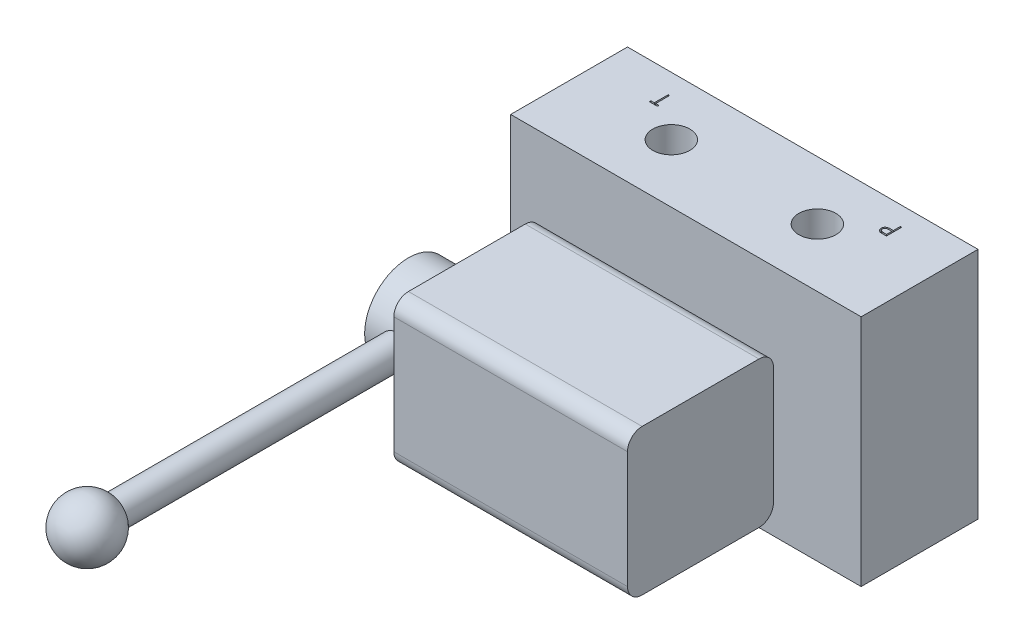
ISO-10303-21;
HEADER;
FILE_DESCRIPTION(('STEP AP214'),'2;1');
FILE_NAME('part.step','',(''),(''),'','','');
FILE_SCHEMA(('AUTOMOTIVE_DESIGN { 1 0 10303 214 1 1 1 1 }'));
ENDSEC;
DATA;
#1=APPLICATION_CONTEXT('core data for automotive mechanical design processes');
#2=APPLICATION_PROTOCOL_DEFINITION('international standard','automotive_design',2000,#1);
#3=PRODUCT_CONTEXT('',#1,'mechanical');
#4=PRODUCT('Part','Part','',(#3));
#5=PRODUCT_RELATED_PRODUCT_CATEGORY('part','',(#4));
#6=PRODUCT_DEFINITION_FORMATION('','',#4);
#7=PRODUCT_DEFINITION_CONTEXT('part definition',#1,'design');
#8=PRODUCT_DEFINITION('design','',#6,#7);
#9=PRODUCT_DEFINITION_SHAPE('','',#8);
#10=(LENGTH_UNIT() NAMED_UNIT(*) SI_UNIT(.MILLI.,.METRE.));
#11=(NAMED_UNIT(*) PLANE_ANGLE_UNIT() SI_UNIT($,.RADIAN.));
#12=(NAMED_UNIT(*) SI_UNIT($,.STERADIAN.) SOLID_ANGLE_UNIT());
#13=UNCERTAINTY_MEASURE_WITH_UNIT(LENGTH_MEASURE(1.E-05),#10,'distance_accuracy_value','');
#14=(GEOMETRIC_REPRESENTATION_CONTEXT(3) GLOBAL_UNCERTAINTY_ASSIGNED_CONTEXT((#13)) GLOBAL_UNIT_ASSIGNED_CONTEXT((#10,
#11,#12)) REPRESENTATION_CONTEXT('',''));
#15=CARTESIAN_POINT('',(0.,0.,0.));
#16=DIRECTION('',(0.,0.,1.));
#17=DIRECTION('',(1.,0.,0.));
#18=AXIS2_PLACEMENT_3D('',#15,#16,#17);
#19=CARTESIAN_POINT('',(60.0000000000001,40.,20.));
#20=DIRECTION('',(0.,-1.,0.));
#21=DIRECTION('',(1.,0.,0.));
#22=AXIS2_PLACEMENT_3D('',#19,#20,#21);
#23=PLANE('',#22);
#24=DIRECTION('',(0.,0.,1.));
#25=VECTOR('',#24,1.);
#26=CARTESIAN_POINT('',(40.3962915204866,40.,-13.5546769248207));
#27=LINE('',#26,#25);
#28=CARTESIAN_POINT('',(40.3962915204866,40.,-13.5546769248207));
#29=VERTEX_POINT('',#28);
#30=CARTESIAN_POINT('',(40.3962915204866,40.,-8.26301025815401));
#31=VERTEX_POINT('',#30);
#32=EDGE_CURVE('E61',#29,#31,#27,.T.);
#33=ORIENTED_EDGE('',*,*,#32,.T.);
#34=DIRECTION('',(-1.,0.,0.));
#35=VECTOR('',#34,1.);
#36=CARTESIAN_POINT('',(40.3962915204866,40.,-8.26301025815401));
#37=LINE('',#36,#35);
#38=CARTESIAN_POINT('',(39.3585227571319,40.,-8.26301025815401));
#39=VERTEX_POINT('',#38);
#40=EDGE_CURVE('E590',#31,#39,#37,.T.);
#41=ORIENTED_EDGE('',*,*,#40,.T.);
#42=CARTESIAN_POINT('',(39.3585227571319,40.,-8.26301025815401));
#43=CARTESIAN_POINT('',(39.2871443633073,40.,-8.26308872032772));
#44=CARTESIAN_POINT('',(39.1503801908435,40.,-8.26323905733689));
#45=CARTESIAN_POINT('',(38.9542633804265,40.,-8.26779706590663));
#46=CARTESIAN_POINT('',(38.7761462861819,40.,-8.27388504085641));
#47=CARTESIAN_POINT('',(38.6164129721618,40.,-8.28232433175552));
#48=CARTESIAN_POINT('',(38.4745719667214,40.,-8.29229774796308));
#49=CARTESIAN_POINT('',(38.3512650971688,40.,-8.30628595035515));
#50=CARTESIAN_POINT('',(38.2455231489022,40.,-8.3208913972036));
#51=CARTESIAN_POINT('',(38.1821645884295,40.,-8.33574042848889));
#52=CARTESIAN_POINT('',(38.1532693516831,40.,-8.34251246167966));
#53=B_SPLINE_CURVE_WITH_KNOTS('',3,(#42,#43,#44,#45,#46,#47,#48,#49,#50,#51,#52),.UNSPECIFIED.,
.F.,.F.,(4,1,1,1,1,1,1,1,4),(0.,0.176955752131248,0.339055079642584,0.486318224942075,
0.618780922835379,0.735618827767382,0.838742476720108,0.926457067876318,1.),.UNSPECIFIED.);
#54=CARTESIAN_POINT('',(38.1532693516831,40.,-8.34251246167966));
#55=VERTEX_POINT('',#54);
#56=EDGE_CURVE('E594',#39,#55,#53,.T.);
#57=ORIENTED_EDGE('',*,*,#56,.T.);
#58=CARTESIAN_POINT('',(38.1532693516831,40.,-8.34251246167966));
#59=CARTESIAN_POINT('',(38.1166912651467,40.,-8.35252452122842));
#60=CARTESIAN_POINT('',(38.0443970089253,40.,-8.37231271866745));
#61=CARTESIAN_POINT('',(37.9402218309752,40.,-8.4119410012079));
#62=CARTESIAN_POINT('',(37.8411231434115,40.,-8.45895050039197));
#63=CARTESIAN_POINT('',(37.746686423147,40.,-8.51244814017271));
#64=CARTESIAN_POINT('',(37.6585294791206,40.,-8.57496033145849));
#65=CARTESIAN_POINT('',(37.5738998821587,40.,-8.64287908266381));
#66=CARTESIAN_POINT('',(37.4945724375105,40.,-8.71895118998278));
#67=CARTESIAN_POINT('',(37.4217449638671,40.,-8.80307649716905));
#68=CARTESIAN_POINT('',(37.3542671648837,40.,-8.89249909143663));
#69=CARTESIAN_POINT('',(37.2977834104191,40.,-8.98949920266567));
#70=CARTESIAN_POINT('',(37.2479060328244,40.,-9.09071185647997));
#71=CARTESIAN_POINT('',(37.2090361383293,40.,-9.19860819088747));
#72=CARTESIAN_POINT('',(37.1784829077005,40.,-9.31176398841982));
#73=CARTESIAN_POINT('',(37.1562309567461,40.,-9.43047375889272));
#74=CARTESIAN_POINT('',(37.1419291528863,40.,-9.55448141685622));
#75=CARTESIAN_POINT('',(37.1405720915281,40.,-9.63924151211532));
#76=CARTESIAN_POINT('',(37.1398812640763,40.,-9.68238959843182));
#77=B_SPLINE_CURVE_WITH_KNOTS('',3,(#58,#59,#60,#61,#62,#63,#64,#65,#66,#67,#68,#69,#70,#71,#72,
#73,#74,#75,#76),.UNSPECIFIED.,.F.,.F.,(4,1,1,1,1,1,1,1,1,1,1,1,1,1,1,1,4),(0.,
0.0624583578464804,0.123444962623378,0.183343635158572,0.243063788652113,0.302015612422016,
0.361208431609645,0.421737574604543,0.482804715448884,0.544402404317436,0.606008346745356,
0.667460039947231,0.73008369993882,0.794626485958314,0.86039698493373,0.928933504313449,1.),.UNSPECIFIED.);
#78=CARTESIAN_POINT('',(37.1398812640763,40.,-9.68238959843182));
#79=VERTEX_POINT('',#78);
#80=EDGE_CURVE('E599',#55,#79,#77,.T.);
#81=ORIENTED_EDGE('',*,*,#80,.T.);
#82=CARTESIAN_POINT('',(37.1398812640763,40.,-9.68238959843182));
#83=CARTESIAN_POINT('',(37.1405184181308,40.,-9.72589885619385));
#84=CARTESIAN_POINT('',(37.141765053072,40.,-9.8110276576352));
#85=CARTESIAN_POINT('',(37.1567272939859,40.,-9.93556746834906));
#86=CARTESIAN_POINT('',(37.1768812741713,40.,-10.0545821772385));
#87=CARTESIAN_POINT('',(37.2078708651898,40.,-10.1678078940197));
#88=CARTESIAN_POINT('',(37.2484589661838,40.,-10.27457221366));
#89=CARTESIAN_POINT('',(37.2960719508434,40.,-10.3765066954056));
#90=CARTESIAN_POINT('',(37.3534994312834,40.,-10.4718771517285));
#91=CARTESIAN_POINT('',(37.4194862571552,40.,-10.5610298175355));
#92=CARTESIAN_POINT('',(37.4928916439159,40.,-10.6440483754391));
#93=CARTESIAN_POINT('',(37.5734050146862,40.,-10.7203312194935));
#94=CARTESIAN_POINT('',(37.6607013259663,40.,-10.7894318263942));
#95=CARTESIAN_POINT('',(37.7545031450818,40.,-10.8515051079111));
#96=CARTESIAN_POINT('',(37.8557249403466,40.,-10.905111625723));
#97=CARTESIAN_POINT('',(37.9628315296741,40.,-10.9531256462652));
#98=CARTESIAN_POINT('',(38.0767538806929,40.,-10.9934497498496));
#99=CARTESIAN_POINT('',(38.15558839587,40.,-11.0146618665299));
#100=CARTESIAN_POINT('',(38.1956705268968,40.,-11.025446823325));
#101=B_SPLINE_CURVE_WITH_KNOTS('',3,(#82,#83,#84,#85,#86,#87,#88,#89,#90,#91,#92,#93,#94,#95,
#96,#97,#98,#99,#100),.UNSPECIFIED.,.F.,.F.,(4,1,1,1,1,1,1,1,1,1,1,1,1,1,1,1,4),(0.,
0.0701188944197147,0.13719235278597,0.202016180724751,0.264631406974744,0.326116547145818,
0.38601030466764,0.44581184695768,0.505297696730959,0.56463327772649,0.62428262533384,
0.683902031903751,0.743952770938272,0.805387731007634,0.868388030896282,0.933084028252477,1.),.UNSPECIFIED.);
#102=CARTESIAN_POINT('',(38.1956705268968,40.,-11.025446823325));
#103=VERTEX_POINT('',#102);
#104=EDGE_CURVE('E607',#79,#103,#101,.T.);
#105=ORIENTED_EDGE('',*,*,#104,.T.);
#106=CARTESIAN_POINT('',(38.1956705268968,40.,-11.025446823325));
#107=CARTESIAN_POINT('',(38.2288229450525,40.,-11.0324915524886));
#108=CARTESIAN_POINT('',(38.301478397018,40.,-11.0479304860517));
#109=CARTESIAN_POINT('',(38.4211271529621,40.,-11.0652834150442));
#110=CARTESIAN_POINT('',(38.5605045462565,40.,-11.0795147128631));
#111=CARTESIAN_POINT('',(38.7191363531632,40.,-11.0927954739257));
#112=CARTESIAN_POINT('',(38.8973924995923,40.,-11.0998326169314));
#113=CARTESIAN_POINT('',(39.09486415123,40.,-11.1080953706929));
#114=CARTESIAN_POINT('',(39.3122196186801,40.,-11.1119941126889));
#115=CARTESIAN_POINT('',(39.4638182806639,40.,-11.112240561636));
#116=CARTESIAN_POINT('',(39.5429678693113,40.,-11.112369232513));
#117=B_SPLINE_CURVE_WITH_KNOTS('',3,(#106,#107,#108,#109,#110,#111,#112,#113,#114,#115,#116),
.UNSPECIFIED.,.F.,.F.,(4,1,1,1,1,1,1,1,4),(0.,0.0751715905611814,0.164742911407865,
0.268011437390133,0.385963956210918,0.517799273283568,0.663697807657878,0.824416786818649,1.),.UNSPECIFIED.);
#118=CARTESIAN_POINT('',(39.5429678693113,40.,-11.112369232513));
#119=VERTEX_POINT('',#118);
#120=EDGE_CURVE('E615',#103,#119,#117,.T.);
#121=ORIENTED_EDGE('',*,*,#120,.T.);
#122=DIRECTION('',(1.,0.,0.));
#123=VECTOR('',#122,1.);
#124=CARTESIAN_POINT('',(39.5429678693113,40.,-11.112369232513));
#125=LINE('',#124,#123);
#126=CARTESIAN_POINT('',(39.9213983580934,40.,-11.112369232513));
#127=VERTEX_POINT('',#126);
#128=EDGE_CURVE('E623',#119,#127,#125,.T.);
#129=ORIENTED_EDGE('',*,*,#128,.T.);
#130=DIRECTION('',(0.,0.,-1.));
#131=VECTOR('',#130,1.);
#132=CARTESIAN_POINT('',(39.9213983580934,40.,-11.112369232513));
#133=LINE('',#132,#131);
#134=CARTESIAN_POINT('',(39.9213983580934,40.,-13.5546769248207));
#135=VERTEX_POINT('',#134);
#136=EDGE_CURVE('E629',#127,#135,#133,.T.);
#137=ORIENTED_EDGE('',*,*,#136,.T.);
#138=DIRECTION('',(1.,0.,0.));
#139=VECTOR('',#138,1.);
#140=CARTESIAN_POINT('',(39.9213983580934,40.,-13.5546769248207));
#141=LINE('',#140,#139);
#142=EDGE_CURVE('E632',#135,#29,#141,.T.);
#143=ORIENTED_EDGE('',*,*,#142,.T.);
#144=EDGE_LOOP('',(#33,#41,#57,#81,#105,#121,#129,#137,#143));
#145=FACE_BOUND('',#144,.T.);
#146=DIRECTION('',(-1.,0.,0.));
#147=VECTOR('',#146,1.);
#148=CARTESIAN_POINT('',(60.,40.,-20.));
#149=LINE('',#148,#147);
#150=CARTESIAN_POINT('',(60.,40.,-20.));
#151=VERTEX_POINT('',#150);
#152=CARTESIAN_POINT('',(-59.9999999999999,40.,-20.));
#153=VERTEX_POINT('',#152);
#154=EDGE_CURVE('E1137',#151,#153,#149,.T.);
#155=ORIENTED_EDGE('',*,*,#154,.T.);
#156=DIRECTION('',(0.,0.,-1.));
#157=VECTOR('',#156,1.);
#158=CARTESIAN_POINT('',(-60.0000000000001,40.,20.));
#159=LINE('',#158,#157);
#160=CARTESIAN_POINT('',(-60.0000000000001,40.,20.));
#161=VERTEX_POINT('',#160);
#162=EDGE_CURVE('E1143',#161,#153,#159,.T.);
#163=ORIENTED_EDGE('',*,*,#162,.F.);
#164=DIRECTION('',(-1.,0.,0.));
#165=VECTOR('',#164,1.);
#166=CARTESIAN_POINT('',(60.0000000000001,40.,20.));
#167=LINE('',#166,#165);
#168=CARTESIAN_POINT('',(60.0000000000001,40.,20.));
#169=VERTEX_POINT('',#168);
#170=EDGE_CURVE('E1141',#169,#161,#167,.T.);
#171=ORIENTED_EDGE('',*,*,#170,.F.);
#172=DIRECTION('',(0.,0.,-1.));
#173=VECTOR('',#172,1.);
#174=CARTESIAN_POINT('',(60.0000000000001,40.,20.));
#175=LINE('',#174,#173);
#176=EDGE_CURVE('E1153',#169,#151,#175,.T.);
#177=ORIENTED_EDGE('',*,*,#176,.T.);
#178=EDGE_LOOP('',(#155,#163,#171,#177));
#179=FACE_BOUND('',#178,.T.);
#180=CARTESIAN_POINT('',(25.,40.,0.));
#181=DIRECTION('',(0.,1.,0.));
#182=DIRECTION('',(-1.,0.,0.));
#183=AXIS2_PLACEMENT_3D('',#180,#181,#182);
#184=CIRCLE('',#183,6.35);
#185=CARTESIAN_POINT('',(18.65,40.,0.));
#186=VERTEX_POINT('',#185);
#187=EDGE_CURVE('E2115',#186,#186,#184,.T.);
#188=ORIENTED_EDGE('',*,*,#187,.F.);
#189=EDGE_LOOP('',(#188));
#190=FACE_BOUND('',#189,.T.);
#191=CARTESIAN_POINT('',(-25.,40.,0.));
#192=DIRECTION('',(0.,-1.,0.));
#193=DIRECTION('',(1.,0.,0.));
#194=AXIS2_PLACEMENT_3D('',#191,#192,#193);
#195=CIRCLE('',#194,6.35);
#196=CARTESIAN_POINT('',(-18.65,40.,0.));
#197=VERTEX_POINT('',#196);
#198=EDGE_CURVE('E2111',#197,#197,#195,.T.);
#199=ORIENTED_EDGE('',*,*,#198,.T.);
#200=EDGE_LOOP('',(#199));
#201=FACE_BOUND('',#200,.T.);
#202=DIRECTION('',(1.,0.,0.));
#203=VECTOR('',#202,1.);
#204=CARTESIAN_POINT('',(-38.4033708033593,40.,-8.06747240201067));
#205=LINE('',#204,#203);
#206=CARTESIAN_POINT('',(-38.4033708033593,40.,-8.06747240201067));
#207=VERTEX_POINT('',#206);
#208=CARTESIAN_POINT('',(-37.2500588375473,40.,-8.06747240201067));
#209=VERTEX_POINT('',#208);
#210=EDGE_CURVE('E53',#207,#209,#205,.T.);
#211=ORIENTED_EDGE('',*,*,#210,.T.);
#212=DIRECTION('',(0.,0.,1.));
#213=VECTOR('',#212,1.);
#214=CARTESIAN_POINT('',(-37.2500588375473,40.,-8.06747240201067));
#215=LINE('',#214,#213);
#216=CARTESIAN_POINT('',(-37.2500588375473,40.,-7.52473735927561));
#217=VERTEX_POINT('',#216);
#218=EDGE_CURVE('E490',#209,#217,#215,.T.);
#219=ORIENTED_EDGE('',*,*,#218,.T.);
#220=DIRECTION('',(-1.,0.,0.));
#221=VECTOR('',#220,1.);
#222=CARTESIAN_POINT('',(-37.2500588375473,40.,-7.52473735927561));
#223=LINE('',#222,#221);
#224=CARTESIAN_POINT('',(-40.0315759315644,40.,-7.52473735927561));
#225=VERTEX_POINT('',#224);
#226=EDGE_CURVE('E1747',#217,#225,#223,.T.);
#227=ORIENTED_EDGE('',*,*,#226,.T.);
#228=DIRECTION('',(0.,0.,-1.));
#229=VECTOR('',#228,1.);
#230=CARTESIAN_POINT('',(-40.0315759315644,40.,-7.52473735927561));
#231=LINE('',#230,#229);
#232=CARTESIAN_POINT('',(-40.0315759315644,40.,-8.06747240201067));
#233=VERTEX_POINT('',#232);
#234=EDGE_CURVE('E1749',#225,#233,#231,.T.);
#235=ORIENTED_EDGE('',*,*,#234,.T.);
#236=DIRECTION('',(1.,0.,0.));
#237=VECTOR('',#236,1.);
#238=CARTESIAN_POINT('',(-40.0315759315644,40.,-8.06747240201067));
#239=LINE('',#238,#237);
#240=CARTESIAN_POINT('',(-38.8782639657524,40.,-8.06747240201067));
#241=VERTEX_POINT('',#240);
#242=EDGE_CURVE('E1731',#233,#241,#239,.T.);
#243=ORIENTED_EDGE('',*,*,#242,.T.);
#244=DIRECTION('',(0.,0.,-1.));
#245=VECTOR('',#244,1.);
#246=CARTESIAN_POINT('',(-38.8782639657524,40.,-8.06747240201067));
#247=LINE('',#246,#245);
#248=CARTESIAN_POINT('',(-38.8782639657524,40.,-12.8164040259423));
#249=VERTEX_POINT('',#248);
#250=EDGE_CURVE('E1728',#241,#249,#247,.T.);
#251=ORIENTED_EDGE('',*,*,#250,.T.);
#252=DIRECTION('',(1.,0.,0.));
#253=VECTOR('',#252,1.);
#254=CARTESIAN_POINT('',(-38.8782639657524,40.,-12.8164040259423));
#255=LINE('',#254,#253);
#256=CARTESIAN_POINT('',(-38.4033708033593,40.,-12.8164040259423));
#257=VERTEX_POINT('',#256);
#258=EDGE_CURVE('E1722',#249,#257,#255,.T.);
#259=ORIENTED_EDGE('',*,*,#258,.T.);
#260=DIRECTION('',(0.,0.,1.));
#261=VECTOR('',#260,1.);
#262=CARTESIAN_POINT('',(-38.4033708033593,40.,-12.8164040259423));
#263=LINE('',#262,#261);
#264=EDGE_CURVE('E486',#257,#207,#263,.T.);
#265=ORIENTED_EDGE('',*,*,#264,.T.);
#266=EDGE_LOOP('',(#211,#219,#227,#235,#243,#251,#259,#265));
#267=FACE_BOUND('',#266,.T.);
#268=ADVANCED_FACE('F36',(#145,#179,#190,#201,#267),#23,.F.);
#269=CARTESIAN_POINT('',(60.0000000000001,-40.,20.));
#270=DIRECTION('',(0.,1.,0.));
#271=DIRECTION('',(-1.,0.,0.));
#272=AXIS2_PLACEMENT_3D('',#269,#270,#271);
#273=PLANE('',#272);
#274=DIRECTION('',(1.,0.,0.));
#275=VECTOR('',#274,1.);
#276=CARTESIAN_POINT('',(-38.4222259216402,-40.,-10.0297015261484));
#277=LINE('',#276,#275);
#278=CARTESIAN_POINT('',(-38.4222259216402,-40.,-10.0297015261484));
#279=VERTEX_POINT('',#278);
#280=CARTESIAN_POINT('',(-38.3543840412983,-40.,-10.0297015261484));
#281=VERTEX_POINT('',#280);
#282=EDGE_CURVE('E2048',#279,#281,#277,.T.);
#283=ORIENTED_EDGE('',*,*,#282,.T.);
#284=DIRECTION('',(0.419058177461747,0.,-0.907959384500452));
#285=VECTOR('',#284,1.);
#286=CARTESIAN_POINT('',(-38.3543840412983,-40.,-10.0297015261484));
#287=LINE('',#286,#285);
#288=CARTESIAN_POINT('',(-35.9120763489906,-40.,-15.321368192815));
#289=VERTEX_POINT('',#288);
#290=EDGE_CURVE('E2074',#281,#289,#287,.T.);
#291=ORIENTED_EDGE('',*,*,#290,.T.);
#292=DIRECTION('',(-1.,0.,0.));
#293=VECTOR('',#292,1.);
#294=CARTESIAN_POINT('',(-35.9120763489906,-40.,-15.321368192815));
#295=LINE('',#294,#293);
#296=CARTESIAN_POINT('',(-36.4283106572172,-40.,-15.321368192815));
#297=VERTEX_POINT('',#296);
#298=EDGE_CURVE('E2077',#289,#297,#295,.T.);
#299=ORIENTED_EDGE('',*,*,#298,.T.);
#300=DIRECTION('',(-0.418842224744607,0.,0.90805902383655));
#301=VECTOR('',#300,1.);
#302=CARTESIAN_POINT('',(-36.4283106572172,-40.,-15.321368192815));
#303=LINE('',#302,#301);
#304=CARTESIAN_POINT('',(-37.2106123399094,-40.,-13.6253211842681));
#305=VERTEX_POINT('',#304);
#306=EDGE_CURVE('E2080',#297,#305,#303,.T.);
#307=ORIENTED_EDGE('',*,*,#306,.T.);
#308=DIRECTION('',(-1.,0.,0.));
#309=VECTOR('',#308,1.);
#310=CARTESIAN_POINT('',(-37.2106123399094,-40.,-13.6253211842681));
#311=LINE('',#310,#309);
#312=CARTESIAN_POINT('',(-39.6094588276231,-40.,-13.6253211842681));
#313=VERTEX_POINT('',#312);
#314=EDGE_CURVE('E2083',#305,#313,#311,.T.);
#315=ORIENTED_EDGE('',*,*,#314,.T.);
#316=DIRECTION('',(-0.428596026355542,0.,-0.903496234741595));
#317=VECTOR('',#316,1.);
#318=CARTESIAN_POINT('',(-39.6094588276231,-40.,-13.6253211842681));
#319=LINE('',#318,#317);
#320=CARTESIAN_POINT('',(-40.4140211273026,-40.,-15.321368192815));
#321=VERTEX_POINT('',#320);
#322=EDGE_CURVE('E2086',#313,#321,#319,.T.);
#323=ORIENTED_EDGE('',*,*,#322,.T.);
#324=DIRECTION('',(-1.,0.,0.));
#325=VECTOR('',#324,1.);
#326=CARTESIAN_POINT('',(-40.4140211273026,-40.,-15.321368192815));
#327=LINE('',#326,#325);
#328=CARTESIAN_POINT('',(-40.9323754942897,-40.,-15.321368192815));
#329=VERTEX_POINT('',#328);
#330=EDGE_CURVE('E2089',#321,#329,#327,.T.);
#331=ORIENTED_EDGE('',*,*,#330,.T.);
#332=DIRECTION('',(0.428584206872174,0.,0.90350184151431));
#333=VECTOR('',#332,1.);
#334=CARTESIAN_POINT('',(-40.9323754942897,-40.,-15.321368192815));
#335=LINE('',#334,#333);
#336=EDGE_CURVE('E2057',#329,#279,#335,.T.);
#337=ORIENTED_EDGE('',*,*,#336,.T.);
#338=EDGE_LOOP('',(#283,#291,#299,#307,#315,#323,#331,#337));
#339=FACE_BOUND('',#338,.T.);
#340=DIRECTION('',(1.,0.,0.));
#341=VECTOR('',#340,1.);
#342=CARTESIAN_POINT('',(60.,-40.,-20.));
#343=LINE('',#342,#341);
#344=CARTESIAN_POINT('',(-59.9999999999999,-40.,-20.));
#345=VERTEX_POINT('',#344);
#346=CARTESIAN_POINT('',(60.,-40.,-20.));
#347=VERTEX_POINT('',#346);
#348=EDGE_CURVE('E1146',#345,#347,#343,.T.);
#349=ORIENTED_EDGE('',*,*,#348,.T.);
#350=DIRECTION('',(0.,0.,-1.));
#351=VECTOR('',#350,1.);
#352=CARTESIAN_POINT('',(60.0000000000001,-40.,20.));
#353=LINE('',#352,#351);
#354=CARTESIAN_POINT('',(60.0000000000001,-40.,20.));
#355=VERTEX_POINT('',#354);
#356=EDGE_CURVE('E1156',#355,#347,#353,.T.);
#357=ORIENTED_EDGE('',*,*,#356,.F.);
#358=DIRECTION('',(1.,0.,0.));
#359=VECTOR('',#358,1.);
#360=CARTESIAN_POINT('',(60.0000000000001,-40.,20.));
#361=LINE('',#360,#359);
#362=CARTESIAN_POINT('',(-60.0000000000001,-40.,20.));
#363=VERTEX_POINT('',#362);
#364=EDGE_CURVE('E1136',#363,#355,#361,.T.);
#365=ORIENTED_EDGE('',*,*,#364,.F.);
#366=DIRECTION('',(0.,0.,-1.));
#367=VECTOR('',#366,1.);
#368=CARTESIAN_POINT('',(-60.0000000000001,-40.,20.));
#369=LINE('',#368,#367);
#370=EDGE_CURVE('E1158',#363,#345,#369,.T.);
#371=ORIENTED_EDGE('',*,*,#370,.T.);
#372=EDGE_LOOP('',(#349,#357,#365,#371));
#373=FACE_BOUND('',#372,.T.);
#374=CARTESIAN_POINT('',(-25.,-40.,0.));
#375=DIRECTION('',(0.,-1.,0.));
#376=DIRECTION('',(1.,0.,0.));
#377=AXIS2_PLACEMENT_3D('',#374,#375,#376);
#378=CIRCLE('',#377,6.35);
#379=CARTESIAN_POINT('',(-18.65,-40.,0.));
#380=VERTEX_POINT('',#379);
#381=EDGE_CURVE('E2127',#380,#380,#378,.T.);
#382=ORIENTED_EDGE('',*,*,#381,.F.);
#383=EDGE_LOOP('',(#382));
#384=FACE_BOUND('',#383,.T.);
#385=CARTESIAN_POINT('',(25.,-40.,0.));
#386=DIRECTION('',(0.,1.,0.));
#387=DIRECTION('',(-1.,0.,0.));
#388=AXIS2_PLACEMENT_3D('',#385,#386,#387);
#389=CIRCLE('',#388,6.35);
#390=CARTESIAN_POINT('',(18.65,-40.,0.));
#391=VERTEX_POINT('',#390);
#392=EDGE_CURVE('E2121',#391,#391,#389,.T.);
#393=ORIENTED_EDGE('',*,*,#392,.T.);
#394=EDGE_LOOP('',(#393));
#395=FACE_BOUND('',#394,.T.);
#396=DIRECTION('',(0.,0.,1.));
#397=VECTOR('',#396,1.);
#398=CARTESIAN_POINT('',(35.6782407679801,-40.,-13.0742635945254));
#399=LINE('',#398,#397);
#400=CARTESIAN_POINT('',(35.6782407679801,-40.,-13.0742635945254));
#401=VERTEX_POINT('',#400);
#402=CARTESIAN_POINT('',(35.6782407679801,-40.,-7.78259692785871));
#403=VERTEX_POINT('',#402);
#404=EDGE_CURVE('E754',#401,#403,#399,.T.);
#405=ORIENTED_EDGE('',*,*,#404,.T.);
#406=DIRECTION('',(1.,0.,0.));
#407=VECTOR('',#406,1.);
#408=CARTESIAN_POINT('',(35.6782407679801,-40.,-7.78259692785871));
#409=LINE('',#408,#407);
#410=CARTESIAN_POINT('',(36.7107093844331,-40.,-7.78259692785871));
#411=VERTEX_POINT('',#410);
#412=EDGE_CURVE('E2020',#403,#411,#409,.T.);
#413=ORIENTED_EDGE('',*,*,#412,.T.);
#414=CARTESIAN_POINT('',(36.7107093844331,-40.,-7.78259692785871));
#415=CARTESIAN_POINT('',(36.7612500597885,-40.,-7.78286264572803));
#416=CARTESIAN_POINT('',(36.8592104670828,-40.,-7.78337767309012));
#417=CARTESIAN_POINT('',(37.0016612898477,-40.,-7.79136526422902));
#418=CARTESIAN_POINT('',(37.1350850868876,-40.,-7.80225652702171));
#419=CARTESIAN_POINT('',(37.2595205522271,-40.,-7.81953773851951));
#420=CARTESIAN_POINT('',(37.3749101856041,-40.,-7.84038959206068));
#421=CARTESIAN_POINT('',(37.4816017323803,-40.,-7.86564114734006));
#422=CARTESIAN_POINT('',(37.579255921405,-40.,-7.89591947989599));
#423=CARTESIAN_POINT('',(37.695843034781,-40.,-7.94406802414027));
#424=CARTESIAN_POINT('',(37.8287707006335,-40.,-8.01561614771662));
#425=CARTESIAN_POINT('',(37.9727016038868,-40.,-8.12134147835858));
#426=CARTESIAN_POINT('',(38.0957770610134,-40.,-8.25065841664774));
#427=CARTESIAN_POINT('',(38.2018920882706,-40.,-8.396531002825));
#428=CARTESIAN_POINT('',(38.2862580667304,-40.,-8.55699818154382));
#429=CARTESIAN_POINT('',(38.3472925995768,-40.,-8.72823528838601));
#430=CARTESIAN_POINT('',(38.3859336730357,-40.,-8.90803363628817));
#431=CARTESIAN_POINT('',(38.3899076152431,-40.,-9.03147034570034));
#432=CARTESIAN_POINT('',(38.3919159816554,-40.,-9.0938532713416));
#433=B_SPLINE_CURVE_WITH_KNOTS('',3,(#414,#415,#416,#417,#418,#419,#420,#421,#422,#423,#424,
#425,#426,#427,#428,#429,#430,#431,#432),.UNSPECIFIED.,.F.,.F.,(4,1,1,1,1,1,1,1,1,1,1,1,1,1,1,1,
4),(0.,0.0625940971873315,0.121322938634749,0.176680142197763,0.228365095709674,
0.276868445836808,0.321879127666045,0.364098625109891,0.403355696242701,0.47796794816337,
0.550535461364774,0.623584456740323,0.698174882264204,0.773353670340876,0.847281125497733,
0.922818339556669,1.),.UNSPECIFIED.);
#434=CARTESIAN_POINT('',(38.3919159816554,-40.,-9.0938532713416));
#435=VERTEX_POINT('',#434);
#436=EDGE_CURVE('E2143',#411,#435,#433,.T.);
#437=ORIENTED_EDGE('',*,*,#436,.T.);
#438=CARTESIAN_POINT('',(38.3919159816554,-40.,-9.0938532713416));
#439=CARTESIAN_POINT('',(38.3902631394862,-40.,-9.1522922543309));
#440=CARTESIAN_POINT('',(38.3870151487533,-40.,-9.2671303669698));
#441=CARTESIAN_POINT('',(38.3559564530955,-40.,-9.43509407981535));
#442=CARTESIAN_POINT('',(38.3073325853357,-40.,-9.59497985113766));
#443=CARTESIAN_POINT('',(38.2397425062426,-40.,-9.74620417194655));
#444=CARTESIAN_POINT('',(38.1518978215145,-40.,-9.88535022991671));
#445=CARTESIAN_POINT('',(38.047790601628,-40.,-10.0135405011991));
#446=CARTESIAN_POINT('',(37.9221863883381,-40.,-10.1253474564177));
#447=CARTESIAN_POINT('',(37.8280805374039,-40.,-10.1878539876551));
#448=CARTESIAN_POINT('',(37.7802790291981,-40.,-10.2196044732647));
#449=B_SPLINE_CURVE_WITH_KNOTS('',3,(#438,#439,#440,#441,#442,#443,#444,#445,#446,#447,#448),
.UNSPECIFIED.,.F.,.F.,(4,1,1,1,1,1,1,1,4),(0.,0.13056910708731,0.256580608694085,
0.380551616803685,0.50362291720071,0.625739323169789,0.74754858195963,0.871766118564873,1.),.UNSPECIFIED.);
#450=CARTESIAN_POINT('',(37.7802790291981,-40.,-10.2196044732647));
#451=VERTEX_POINT('',#450);
#452=EDGE_CURVE('E2151',#435,#451,#449,.T.);
#453=ORIENTED_EDGE('',*,*,#452,.T.);
#454=CARTESIAN_POINT('',(37.7802790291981,-40.,-10.2196044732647));
#455=CARTESIAN_POINT('',(37.840393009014,-40.,-10.2426836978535));
#456=CARTESIAN_POINT('',(37.9554059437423,-40.,-10.286839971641));
#457=CARTESIAN_POINT('',(38.113681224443,-40.,-10.3649078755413));
#458=CARTESIAN_POINT('',(38.250047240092,-40.,-10.4498196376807));
#459=CARTESIAN_POINT('',(38.3655524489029,-40.,-10.5425475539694));
#460=CARTESIAN_POINT('',(38.464336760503,-40.,-10.6424977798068));
#461=CARTESIAN_POINT('',(38.5505953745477,-40.,-10.7511358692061));
#462=CARTESIAN_POINT('',(38.6241969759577,-40.,-10.869878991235));
#463=CARTESIAN_POINT('',(38.6872629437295,-40.,-10.997489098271));
#464=CARTESIAN_POINT('',(38.7364735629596,-40.,-11.1326631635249));
#465=CARTESIAN_POINT('',(38.7733276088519,-40.,-11.2741332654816));
#466=CARTESIAN_POINT('',(38.794445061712,-40.,-11.4213921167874));
#467=CARTESIAN_POINT('',(38.7974501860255,-40.,-11.5216092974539));
#468=CARTESIAN_POINT('',(38.7989672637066,-40.,-11.572201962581));
#469=B_SPLINE_CURVE_WITH_KNOTS('',3,(#454,#455,#456,#457,#458,#459,#460,#461,#462,#463,#464,
#465,#466,#467,#468),.UNSPECIFIED.,.F.,.F.,(4,1,1,1,1,1,1,1,1,1,1,1,4),(0.,0.106057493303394,
0.202914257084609,0.290300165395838,0.370222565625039,0.446383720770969,0.521396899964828,
0.598291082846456,0.676142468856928,0.755528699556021,0.834887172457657,0.916646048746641,1.),.UNSPECIFIED.);
#470=CARTESIAN_POINT('',(38.7989672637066,-40.,-11.572201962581));
#471=VERTEX_POINT('',#470);
#472=EDGE_CURVE('E2159',#451,#471,#469,.T.);
#473=ORIENTED_EDGE('',*,*,#472,.T.);
#474=CARTESIAN_POINT('',(38.7989672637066,-40.,-11.572201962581));
#475=CARTESIAN_POINT('',(38.7974903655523,-40.,-11.6238590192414));
#476=CARTESIAN_POINT('',(38.7945845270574,-40.,-11.725495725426));
#477=CARTESIAN_POINT('',(38.7731457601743,-40.,-11.8748040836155));
#478=CARTESIAN_POINT('',(38.7368462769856,-40.,-12.0174900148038));
#479=CARTESIAN_POINT('',(38.6868458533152,-40.,-12.1544764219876));
#480=CARTESIAN_POINT('',(38.6215885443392,-40.,-12.2854982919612));
#481=CARTESIAN_POINT('',(38.5421712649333,-40.,-12.4107040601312));
#482=CARTESIAN_POINT('',(38.4474783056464,-40.,-12.5288357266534));
#483=CARTESIAN_POINT('',(38.3415499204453,-40.,-12.6412059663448));
#484=CARTESIAN_POINT('',(38.2217131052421,-40.,-12.7422432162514));
#485=CARTESIAN_POINT('',(38.0924214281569,-40.,-12.832225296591));
#486=CARTESIAN_POINT('',(37.9520466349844,-40.,-12.9062270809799));
#487=CARTESIAN_POINT('',(37.8028942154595,-40.,-12.9683905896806));
#488=CARTESIAN_POINT('',(37.6432910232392,-40.,-13.015875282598));
#489=CARTESIAN_POINT('',(37.4739537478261,-40.,-13.0490957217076));
#490=CARTESIAN_POINT('',(37.2950284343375,-40.,-13.071479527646));
#491=CARTESIAN_POINT('',(37.1722470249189,-40.,-13.0733198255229));
#492=CARTESIAN_POINT('',(37.1092804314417,-40.,-13.0742635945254));
#493=B_SPLINE_CURVE_WITH_KNOTS('',3,(#474,#475,#476,#477,#478,#479,#480,#481,#482,#483,#484,
#485,#486,#487,#488,#489,#490,#491,#492),.UNSPECIFIED.,.F.,.F.,(4,1,1,1,1,1,1,1,1,1,1,1,1,1,1,1,
4),(0.,0.0611602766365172,0.120334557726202,0.178180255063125,0.235235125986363,
0.29268296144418,0.35118624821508,0.410456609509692,0.471719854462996,0.533761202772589,
0.595739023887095,0.657887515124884,0.72129518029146,0.786822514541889,0.854686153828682,
0.925477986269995,1.),.UNSPECIFIED.);
#494=CARTESIAN_POINT('',(37.1092804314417,-40.,-13.0742635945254));
#495=VERTEX_POINT('',#494);
#496=EDGE_CURVE('E2167',#471,#495,#493,.T.);
#497=ORIENTED_EDGE('',*,*,#496,.T.);
#498=DIRECTION('',(-1.,0.,0.));
#499=VECTOR('',#498,1.);
#500=CARTESIAN_POINT('',(37.1092804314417,-40.,-13.0742635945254));
#501=LINE('',#500,#499);
#502=EDGE_CURVE('E767',#495,#401,#501,.T.);
#503=ORIENTED_EDGE('',*,*,#502,.T.);
#504=EDGE_LOOP('',(#405,#413,#437,#453,#473,#497,#503));
#505=FACE_BOUND('',#504,.T.);
#506=ADVANCED_FACE('F909',(#339,#373,#384,#395,#505),#273,.F.);
#507=CARTESIAN_POINT('',(-59.9999999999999,0.,54.9999999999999));
#508=DIRECTION('',(1.,0.,0.));
#509=DIRECTION('',(0.,0.,-1.));
#510=AXIS2_PLACEMENT_3D('',#507,#508,#509);
#511=CYLINDRICAL_SURFACE('',#510,15.);
#512=CARTESIAN_POINT('',(-39.9999999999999,0.,54.9999999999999));
#513=DIRECTION('',(1.,0.,0.));
#514=DIRECTION('',(0.,0.,-1.));
#515=AXIS2_PLACEMENT_3D('',#512,#513,#514);
#516=CIRCLE('',#515,15.);
#517=CARTESIAN_POINT('',(-39.9999999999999,0.,39.9999999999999));
#518=VERTEX_POINT('',#517);
#519=EDGE_CURVE('E900',#518,#518,#516,.F.);
#520=ORIENTED_EDGE('',*,*,#519,.T.);
#521=EDGE_LOOP('',(#520));
#522=FACE_BOUND('',#521,.T.);
#523=CARTESIAN_POINT('',(-59.9999999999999,0.,54.9999999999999));
#524=DIRECTION('',(-1.,0.,0.));
#525=DIRECTION('',(0.,0.,1.));
#526=AXIS2_PLACEMENT_3D('',#523,#524,#525);
#527=CIRCLE('',#526,15.);
#528=CARTESIAN_POINT('',(-59.9999999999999,0.,69.9999999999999));
#529=VERTEX_POINT('',#528);
#530=EDGE_CURVE('E1011',#529,#529,#527,.T.);
#531=ORIENTED_EDGE('',*,*,#530,.F.);
#532=EDGE_LOOP('',(#531));
#533=FACE_BOUND('',#532,.T.);
#534=CARTESIAN_POINT('',(-54.9999999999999,0.,70.));
#535=CARTESIAN_POINT('',(-55.0000012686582,-0.272816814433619,70.0000007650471));
#536=CARTESIAN_POINT('',(-54.977598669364,-0.545625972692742,69.9924884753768));
#537=CARTESIAN_POINT('',(-54.8888544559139,-1.0832088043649,69.9632605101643));
#538=CARTESIAN_POINT('',(-54.8225082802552,-1.34798164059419,69.941543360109));
#539=CARTESIAN_POINT('',(-54.6484037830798,-1.86166394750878,69.8862653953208));
#540=CARTESIAN_POINT('',(-54.5407146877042,-2.1105991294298,69.8527243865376));
#541=CARTESIAN_POINT('',(-54.2872941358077,-2.58687468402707,69.777222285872));
#542=CARTESIAN_POINT('',(-54.1415551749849,-2.81421078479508,69.7352595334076));
#543=CARTESIAN_POINT('',(-53.8108709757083,-3.24870837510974,69.6457047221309));
#544=CARTESIAN_POINT('',(-53.6248438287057,-3.45501850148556,69.5979778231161));
#545=CARTESIAN_POINT('',(-53.221164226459,-3.83416346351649,69.5030157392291));
#546=CARTESIAN_POINT('',(-53.0035048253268,-4.00699092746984,69.4557806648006));
#547=CARTESIAN_POINT('',(-52.5350744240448,-4.31912471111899,69.3656666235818));
#548=CARTESIAN_POINT('',(-52.2835313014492,-4.45732429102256,69.3229519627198));
#549=CARTESIAN_POINT('',(-51.7591195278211,-4.68909436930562,69.2487652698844));
#550=CARTESIAN_POINT('',(-51.4862574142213,-4.78267848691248,69.2172898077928));
#551=CARTESIAN_POINT('',(-50.9366338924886,-4.91936730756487,69.1705651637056));
#552=CARTESIAN_POINT('',(-50.6603139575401,-4.96406724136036,69.1548047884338));
#553=CARTESIAN_POINT('',(-50.103681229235,-5.00670561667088,69.139782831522));
#554=CARTESIAN_POINT('',(-49.823369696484,-5.0046585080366,69.1405161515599));
#555=CARTESIAN_POINT('',(-49.2803168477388,-4.95509951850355,69.1579507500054));
#556=CARTESIAN_POINT('',(-49.0173579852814,-4.90966956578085,69.1739207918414));
#557=CARTESIAN_POINT('',(-48.5030329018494,-4.77803081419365,69.2188328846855));
#558=CARTESIAN_POINT('',(-48.2516680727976,-4.6918171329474,69.2477764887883));
#559=CARTESIAN_POINT('',(-47.7629362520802,-4.47969529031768,69.3158955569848));
#560=CARTESIAN_POINT('',(-47.5258598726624,-4.35317024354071,69.3552282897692));
#561=CARTESIAN_POINT('',(-47.0756454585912,-4.06444553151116,69.4396279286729));
#562=CARTESIAN_POINT('',(-46.8625143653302,-3.9022355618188,69.4846964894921));
#563=CARTESIAN_POINT('',(-46.454542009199,-3.53674666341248,69.5783664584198));
#564=CARTESIAN_POINT('',(-46.2612365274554,-3.33176575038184,69.6270294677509));
#565=CARTESIAN_POINT('',(-45.9113436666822,-2.8916978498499,69.720346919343));
#566=CARTESIAN_POINT('',(-45.7547598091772,-2.65660797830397,69.765000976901));
#567=CARTESIAN_POINT('',(-45.4815184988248,-2.15973806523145,69.8458553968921));
#568=CARTESIAN_POINT('',(-45.3652725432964,-1.89771638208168,69.8819675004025));
#569=CARTESIAN_POINT('',(-45.1789841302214,-1.35634541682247,69.941028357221));
#570=CARTESIAN_POINT('',(-45.1089256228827,-1.07700219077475,69.9639816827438));
#571=CARTESIAN_POINT('',(-45.0197216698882,-0.521919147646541,69.9933813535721));
#572=CARTESIAN_POINT('',(-44.9985009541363,-0.246547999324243,70.0005000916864));
#573=CARTESIAN_POINT('',(-45.0016633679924,0.303875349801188,69.9994451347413));
#574=CARTESIAN_POINT('',(-45.0260387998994,0.578927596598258,69.9912740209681));
#575=CARTESIAN_POINT('',(-45.1180595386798,1.11259933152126,69.9610012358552));
#576=CARTESIAN_POINT('',(-45.1844310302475,1.37146403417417,69.9393099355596));
#577=CARTESIAN_POINT('',(-45.3569672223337,1.87427979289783,69.8845923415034));
#578=CARTESIAN_POINT('',(-45.4631369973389,2.11822894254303,69.8515646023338));
#579=CARTESIAN_POINT('',(-45.7153521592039,2.59144148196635,69.7764465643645));
#580=CARTESIAN_POINT('',(-45.8623729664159,2.82014979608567,69.7341407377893));
#581=CARTESIAN_POINT('',(-46.1909707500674,3.25032415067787,69.6452626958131));
#582=CARTESIAN_POINT('',(-46.3725582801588,3.45178183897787,69.5986891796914));
#583=CARTESIAN_POINT('',(-46.7748937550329,3.83126253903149,69.5038423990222));
#584=CARTESIAN_POINT('',(-46.9970461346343,4.0078048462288,69.4555880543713));
#585=CARTESIAN_POINT('',(-47.4688578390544,4.32128761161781,69.3649986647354));
#586=CARTESIAN_POINT('',(-47.7185173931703,4.45822773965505,69.3226636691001));
#587=CARTESIAN_POINT('',(-48.2383650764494,4.68798465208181,69.2491195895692));
#588=CARTESIAN_POINT('',(-48.5085103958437,4.78089066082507,69.2178880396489));
#589=CARTESIAN_POINT('',(-49.0618932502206,4.91947333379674,69.1705416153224));
#590=CARTESIAN_POINT('',(-49.3451248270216,4.96517127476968,69.154419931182));
#591=CARTESIAN_POINT('',(-49.9009854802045,5.00638141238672,69.1398929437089));
#592=CARTESIAN_POINT('',(-50.173411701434,5.00435128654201,69.1406200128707));
#593=CARTESIAN_POINT('',(-50.7138253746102,4.95621146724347,69.1575634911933));
#594=CARTESIAN_POINT('',(-50.9818130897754,4.91010439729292,69.1737789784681));
#595=CARTESIAN_POINT('',(-51.5006783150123,4.77685906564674,69.2192262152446));
#596=CARTESIAN_POINT('',(-51.7517841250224,4.69051673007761,69.2482049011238));
#597=CARTESIAN_POINT('',(-52.2361370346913,4.47989682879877,69.3158199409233));
#598=CARTESIAN_POINT('',(-52.4693801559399,4.35561084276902,69.3544584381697));
#599=CARTESIAN_POINT('',(-52.9224183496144,4.06630346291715,69.4391414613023));
#600=CARTESIAN_POINT('',(-53.1411825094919,3.89974121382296,69.4854355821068));
#601=CARTESIAN_POINT('',(-53.548449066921,3.53321441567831,69.5791678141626));
#602=CARTESIAN_POINT('',(-53.7369428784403,3.33324042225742,69.6266062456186));
#603=CARTESIAN_POINT('',(-54.0857220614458,2.89620778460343,69.7195015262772));
#604=CARTESIAN_POINT('',(-54.244621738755,2.65800756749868,69.7648090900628));
#605=CARTESIAN_POINT('',(-54.5199521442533,2.15678678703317,69.8462995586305));
#606=CARTESIAN_POINT('',(-54.6363937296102,1.89377259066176,69.8824847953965));
#607=CARTESIAN_POINT('',(-54.8186081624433,1.36246823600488,69.9402757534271));
#608=CARTESIAN_POINT('',(-54.8864123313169,1.09493878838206,69.962460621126));
#609=CARTESIAN_POINT('',(-54.9771014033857,0.551602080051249,69.9923203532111));
#610=CARTESIAN_POINT('',(-54.9999987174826,0.275797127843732,69.9999992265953));
#611=CARTESIAN_POINT('',(-54.9999999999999,0.,70.));
#612=B_SPLINE_CURVE_WITH_KNOTS('',3,(#534,#535,#536,#537,#538,#539,#540,#541,#542,#543,#544,
#545,#546,#547,#548,#549,#550,#551,#552,#553,#554,#555,#556,#557,#558,#559,#560,#561,#562,#563,
#564,#565,#566,#567,#568,#569,#570,#571,#572,#573,#574,#575,#576,#577,#578,#579,#580,#581,#582,
#583,#584,#585,#586,#587,#588,#589,#590,#591,#592,#593,#594,#595,#596,#597,#598,#599,#600,#601,
#602,#603,#604,#605,#606,#607,#608,#609,#610,#611),.UNSPECIFIED.,.T.,.F.,(4,2,2,2,2,2,2,2,2,2,2,
2,2,2,2,2,2,2,2,2,2,2,2,2,2,2,2,2,2,2,2,2,2,2,2,2,2,2,4),(0.,0.817435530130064,1.63495592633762,
2.45111336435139,3.26743188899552,4.10923421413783,4.95122166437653,5.81741924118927,
6.6833522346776,7.5200962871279,8.35658169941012,9.15484132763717,9.95319654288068,
10.7644085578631,11.5758551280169,12.4296652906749,13.2835572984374,14.1459202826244,
15.0079834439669,15.832679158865,16.6572356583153,17.4579078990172,18.2586822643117,
19.0805199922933,19.902609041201,20.762051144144,21.6215004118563,22.4792006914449,
23.3365142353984,24.1497833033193,24.9630039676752,25.7607793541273,26.5587319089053,
27.3915033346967,28.2245105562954,29.0899830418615,29.9552340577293,30.7818279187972,
31.6081933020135),.UNSPECIFIED.);
#613=CARTESIAN_POINT('',(-54.9999999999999,0.,70.));
#614=VERTEX_POINT('',#613);
#615=EDGE_CURVE('E893',#614,#614,#612,.T.);
#616=ORIENTED_EDGE('',*,*,#615,.F.);
#617=EDGE_LOOP('',(#616));
#618=FACE_BOUND('',#617,.T.);
#619=ADVANCED_FACE('F904',(#522,#533,#618),#511,.T.);
#620=CARTESIAN_POINT('',(-39.9999999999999,-25.,80.));
#621=DIRECTION('',(1.,0.,0.));
#622=DIRECTION('',(0.,0.,-1.));
#623=AXIS2_PLACEMENT_3D('',#620,#621,#622);
#624=PLANE('',#623);
#625=DIRECTION('',(0.,0.,-1.));
#626=VECTOR('',#625,1.);
#627=CARTESIAN_POINT('',(-39.9999999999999,25.,80.));
#628=LINE('',#627,#626);
#629=CARTESIAN_POINT('',(-39.9999999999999,25.,75.));
#630=VERTEX_POINT('',#629);
#631=CARTESIAN_POINT('',(-40.,25.,35.));
#632=VERTEX_POINT('',#631);
#633=EDGE_CURVE('E1075',#630,#632,#628,.T.);
#634=ORIENTED_EDGE('',*,*,#633,.T.);
#635=CARTESIAN_POINT('',(-40.,20.,35.));
#636=DIRECTION('',(1.,0.,0.));
#637=DIRECTION('',(0.,0.,-1.));
#638=AXIS2_PLACEMENT_3D('',#635,#636,#637);
#639=CIRCLE('',#638,5.);
#640=CARTESIAN_POINT('',(-40.,20.,30.));
#641=VERTEX_POINT('',#640);
#642=EDGE_CURVE('E1058',#632,#641,#639,.F.);
#643=ORIENTED_EDGE('',*,*,#642,.T.);
#644=DIRECTION('',(0.,-1.,0.));
#645=VECTOR('',#644,1.);
#646=CARTESIAN_POINT('',(-40.,-25.,30.));
#647=LINE('',#646,#645);
#648=CARTESIAN_POINT('',(-40.,-20.,30.));
#649=VERTEX_POINT('',#648);
#650=EDGE_CURVE('E1095',#641,#649,#647,.T.);
#651=ORIENTED_EDGE('',*,*,#650,.T.);
#652=CARTESIAN_POINT('',(-40.,-20.,35.));
#653=DIRECTION('',(1.,0.,0.));
#654=DIRECTION('',(0.,0.,-1.));
#655=AXIS2_PLACEMENT_3D('',#652,#653,#654);
#656=CIRCLE('',#655,5.);
#657=CARTESIAN_POINT('',(-40.,-25.,35.));
#658=VERTEX_POINT('',#657);
#659=EDGE_CURVE('E1062',#649,#658,#656,.F.);
#660=ORIENTED_EDGE('',*,*,#659,.T.);
#661=DIRECTION('',(0.,0.,-1.));
#662=VECTOR('',#661,1.);
#663=CARTESIAN_POINT('',(-39.9999999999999,-25.,80.));
#664=LINE('',#663,#662);
#665=CARTESIAN_POINT('',(-39.9999999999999,-25.,75.));
#666=VERTEX_POINT('',#665);
#667=EDGE_CURVE('E1105',#666,#658,#664,.T.);
#668=ORIENTED_EDGE('',*,*,#667,.F.);
#669=CARTESIAN_POINT('',(-39.9999999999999,-20.,75.));
#670=DIRECTION('',(1.,0.,0.));
#671=DIRECTION('',(0.,0.,-1.));
#672=AXIS2_PLACEMENT_3D('',#669,#670,#671);
#673=CIRCLE('',#672,5.);
#674=CARTESIAN_POINT('',(-39.9999999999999,-20.,80.));
#675=VERTEX_POINT('',#674);
#676=EDGE_CURVE('E1064',#666,#675,#673,.F.);
#677=ORIENTED_EDGE('',*,*,#676,.T.);
#678=DIRECTION('',(0.,-1.,0.));
#679=VECTOR('',#678,1.);
#680=CARTESIAN_POINT('',(-39.9999999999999,-25.,80.));
#681=LINE('',#680,#679);
#682=CARTESIAN_POINT('',(-39.9999999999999,20.,80.));
#683=VERTEX_POINT('',#682);
#684=EDGE_CURVE('E1086',#683,#675,#681,.T.);
#685=ORIENTED_EDGE('',*,*,#684,.F.);
#686=CARTESIAN_POINT('',(-39.9999999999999,20.,75.));
#687=DIRECTION('',(1.,0.,0.));
#688=DIRECTION('',(0.,0.,-1.));
#689=AXIS2_PLACEMENT_3D('',#686,#687,#688);
#690=CIRCLE('',#689,5.);
#691=EDGE_CURVE('E1060',#683,#630,#690,.F.);
#692=ORIENTED_EDGE('',*,*,#691,.T.);
#693=EDGE_LOOP('',(#634,#643,#651,#660,#668,#677,#685,#692));
#694=FACE_BOUND('',#693,.T.);
#695=ORIENTED_EDGE('',*,*,#519,.F.);
#696=EDGE_LOOP('',(#695));
#697=FACE_BOUND('',#696,.T.);
#698=ADVANCED_FACE('F908',(#694,#697),#624,.F.);
#699=CARTESIAN_POINT('',(0.,0.,20.));
#700=DIRECTION('',(0.,0.,1.));
#701=DIRECTION('',(1.,0.,0.));
#702=AXIS2_PLACEMENT_3D('',#699,#700,#701);
#703=PLANE('',#702);
#704=DIRECTION('',(-1.,0.,0.));
#705=VECTOR('',#704,1.);
#706=CARTESIAN_POINT('',(0.,12.,20.));
#707=LINE('',#706,#705);
#708=CARTESIAN_POINT('',(-27.,12.,20.));
#709=VERTEX_POINT('',#708);
#710=CARTESIAN_POINT('',(27.0000000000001,12.,20.));
#711=VERTEX_POINT('',#710);
#712=EDGE_CURVE('E1027',#709,#711,#707,.F.);
#713=ORIENTED_EDGE('',*,*,#712,.T.);
#714=DIRECTION('',(0.,1.,0.));
#715=VECTOR('',#714,1.);
#716=CARTESIAN_POINT('',(27.0000000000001,0.,20.));
#717=LINE('',#716,#715);
#718=CARTESIAN_POINT('',(27.0000000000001,-12.,20.));
#719=VERTEX_POINT('',#718);
#720=EDGE_CURVE('E1025',#711,#719,#717,.F.);
#721=ORIENTED_EDGE('',*,*,#720,.T.);
#722=DIRECTION('',(1.,0.,0.));
#723=VECTOR('',#722,1.);
#724=CARTESIAN_POINT('',(0.,-12.,20.));
#725=LINE('',#724,#723);
#726=CARTESIAN_POINT('',(-27.,-12.,20.));
#727=VERTEX_POINT('',#726);
#728=EDGE_CURVE('E1005',#719,#727,#725,.F.);
#729=ORIENTED_EDGE('',*,*,#728,.T.);
#730=DIRECTION('',(0.,-1.,0.));
#731=VECTOR('',#730,1.);
#732=CARTESIAN_POINT('',(-27.,0.,20.));
#733=LINE('',#732,#731);
#734=EDGE_CURVE('E1029',#727,#709,#733,.F.);
#735=ORIENTED_EDGE('',*,*,#734,.T.);
#736=EDGE_LOOP('',(#713,#721,#729,#735));
#737=FACE_BOUND('',#736,.T.);
#738=DIRECTION('',(0.,-1.,0.));
#739=VECTOR('',#738,1.);
#740=CARTESIAN_POINT('',(-60.0000000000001,-40.,20.));
#741=LINE('',#740,#739);
#742=EDGE_CURVE('E1133',#161,#363,#741,.T.);
#743=ORIENTED_EDGE('',*,*,#742,.T.);
#744=ORIENTED_EDGE('',*,*,#364,.T.);
#745=DIRECTION('',(0.,1.,0.));
#746=VECTOR('',#745,1.);
#747=CARTESIAN_POINT('',(60.0000000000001,-40.,20.));
#748=LINE('',#747,#746);
#749=EDGE_CURVE('E1139',#355,#169,#748,.T.);
#750=ORIENTED_EDGE('',*,*,#749,.T.);
#751=ORIENTED_EDGE('',*,*,#170,.T.);
#752=EDGE_LOOP('',(#743,#744,#750,#751));
#753=FACE_BOUND('',#752,.T.);
#754=ADVANCED_FACE('F934',(#737,#753),#703,.T.);
#755=CARTESIAN_POINT('',(-60.0000000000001,-40.,20.));
#756=DIRECTION('',(1.,0.,0.));
#757=DIRECTION('',(0.,0.,-1.));
#758=AXIS2_PLACEMENT_3D('',#755,#756,#757);
#759=PLANE('',#758);
#760=DIRECTION('',(0.,-1.,0.));
#761=VECTOR('',#760,1.);
#762=CARTESIAN_POINT('',(-59.9999999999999,-40.,-20.));
#763=LINE('',#762,#761);
#764=EDGE_CURVE('E1132',#153,#345,#763,.T.);
#765=ORIENTED_EDGE('',*,*,#764,.T.);
#766=ORIENTED_EDGE('',*,*,#370,.F.);
#767=ORIENTED_EDGE('',*,*,#742,.F.);
#768=ORIENTED_EDGE('',*,*,#162,.T.);
#769=EDGE_LOOP('',(#765,#766,#767,#768));
#770=FACE_BOUND('',#769,.T.);
#771=ADVANCED_FACE('F954',(#770),#759,.F.);
#772=CARTESIAN_POINT('',(60.0000000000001,-40.,20.));
#773=DIRECTION('',(-1.,0.,0.));
#774=DIRECTION('',(0.,0.,1.));
#775=AXIS2_PLACEMENT_3D('',#772,#773,#774);
#776=PLANE('',#775);
#777=DIRECTION('',(0.,1.,0.));
#778=VECTOR('',#777,1.);
#779=CARTESIAN_POINT('',(60.,-40.,-20.));
#780=LINE('',#779,#778);
#781=EDGE_CURVE('E1148',#347,#151,#780,.T.);
#782=ORIENTED_EDGE('',*,*,#781,.T.);
#783=ORIENTED_EDGE('',*,*,#176,.F.);
#784=ORIENTED_EDGE('',*,*,#749,.F.);
#785=ORIENTED_EDGE('',*,*,#356,.T.);
#786=EDGE_LOOP('',(#782,#783,#784,#785));
#787=FACE_BOUND('',#786,.T.);
#788=ADVANCED_FACE('F958',(#787),#776,.F.);
#789=CARTESIAN_POINT('',(0.,0.,-20.));
#790=DIRECTION('',(0.,0.,1.));
#791=DIRECTION('',(1.,0.,0.));
#792=AXIS2_PLACEMENT_3D('',#789,#790,#791);
#793=PLANE('',#792);
#794=ORIENTED_EDGE('',*,*,#764,.F.);
#795=ORIENTED_EDGE('',*,*,#154,.F.);
#796=ORIENTED_EDGE('',*,*,#781,.F.);
#797=ORIENTED_EDGE('',*,*,#348,.F.);
#798=EDGE_LOOP('',(#794,#795,#796,#797));
#799=FACE_BOUND('',#798,.T.);
#800=ADVANCED_FACE('F950',(#799),#793,.F.);
#801=CARTESIAN_POINT('',(-25.,-10.,30.));
#802=DIRECTION('',(1.,0.,0.));
#803=DIRECTION('',(0.,0.,-1.));
#804=AXIS2_PLACEMENT_3D('',#801,#802,#803);
#805=PLANE('',#804);
#806=DIRECTION('',(0.,0.,-1.));
#807=VECTOR('',#806,1.);
#808=CARTESIAN_POINT('',(-25.,10.,30.));
#809=LINE('',#808,#807);
#810=CARTESIAN_POINT('',(-25.,10.,30.));
#811=VERTEX_POINT('',#810);
#812=CARTESIAN_POINT('',(-25.,10.,22.));
#813=VERTEX_POINT('',#812);
#814=EDGE_CURVE('E1120',#811,#813,#809,.T.);
#815=ORIENTED_EDGE('',*,*,#814,.T.);
#816=DIRECTION('',(0.,-1.,0.));
#817=VECTOR('',#816,1.);
#818=CARTESIAN_POINT('',(-25.,-10.,22.));
#819=LINE('',#818,#817);
#820=CARTESIAN_POINT('',(-25.,-10.,22.));
#821=VERTEX_POINT('',#820);
#822=EDGE_CURVE('E45',#813,#821,#819,.T.);
#823=ORIENTED_EDGE('',*,*,#822,.T.);
#824=DIRECTION('',(0.,0.,-1.));
#825=VECTOR('',#824,1.);
#826=CARTESIAN_POINT('',(-25.,-10.,30.));
#827=LINE('',#826,#825);
#828=CARTESIAN_POINT('',(-25.,-10.,30.));
#829=VERTEX_POINT('',#828);
#830=EDGE_CURVE('E1129',#829,#821,#827,.T.);
#831=ORIENTED_EDGE('',*,*,#830,.F.);
#832=DIRECTION('',(0.,-1.,0.));
#833=VECTOR('',#832,1.);
#834=CARTESIAN_POINT('',(-25.,-10.,30.));
#835=LINE('',#834,#833);
#836=EDGE_CURVE('E1108',#811,#829,#835,.T.);
#837=ORIENTED_EDGE('',*,*,#836,.F.);
#838=EDGE_LOOP('',(#815,#823,#831,#837));
#839=FACE_BOUND('',#838,.T.);
#840=ADVANCED_FACE('F946',(#839),#805,.F.);
#841=CARTESIAN_POINT('',(25.,-10.,30.));
#842=DIRECTION('',(0.,1.,0.));
#843=DIRECTION('',(-1.,0.,0.));
#844=AXIS2_PLACEMENT_3D('',#841,#842,#843);
#845=PLANE('',#844);
#846=ORIENTED_EDGE('',*,*,#830,.T.);
#847=DIRECTION('',(1.,0.,0.));
#848=VECTOR('',#847,1.);
#849=CARTESIAN_POINT('',(25.,-10.,22.));
#850=LINE('',#849,#848);
#851=CARTESIAN_POINT('',(25.,-10.,22.));
#852=VERTEX_POINT('',#851);
#853=EDGE_CURVE('E11',#821,#852,#850,.T.);
#854=ORIENTED_EDGE('',*,*,#853,.T.);
#855=DIRECTION('',(0.,0.,-1.));
#856=VECTOR('',#855,1.);
#857=CARTESIAN_POINT('',(25.,-10.,30.));
#858=LINE('',#857,#856);
#859=CARTESIAN_POINT('',(25.,-10.,30.));
#860=VERTEX_POINT('',#859);
#861=EDGE_CURVE('E1126',#860,#852,#858,.T.);
#862=ORIENTED_EDGE('',*,*,#861,.F.);
#863=DIRECTION('',(1.,0.,0.));
#864=VECTOR('',#863,1.);
#865=CARTESIAN_POINT('',(25.,-10.,30.));
#866=LINE('',#865,#864);
#867=EDGE_CURVE('E1111',#829,#860,#866,.T.);
#868=ORIENTED_EDGE('',*,*,#867,.F.);
#869=EDGE_LOOP('',(#846,#854,#862,#868));
#870=FACE_BOUND('',#869,.T.);
#871=ADVANCED_FACE('F942',(#870),#845,.F.);
#872=CARTESIAN_POINT('',(25.,-10.,30.));
#873=DIRECTION('',(-1.,0.,0.));
#874=DIRECTION('',(0.,0.,1.));
#875=AXIS2_PLACEMENT_3D('',#872,#873,#874);
#876=PLANE('',#875);
#877=ORIENTED_EDGE('',*,*,#861,.T.);
#878=DIRECTION('',(0.,1.,0.));
#879=VECTOR('',#878,1.);
#880=CARTESIAN_POINT('',(25.,-10.,22.));
#881=LINE('',#880,#879);
#882=CARTESIAN_POINT('',(25.,10.,22.));
#883=VERTEX_POINT('',#882);
#884=EDGE_CURVE('E1032',#852,#883,#881,.T.);
#885=ORIENTED_EDGE('',*,*,#884,.T.);
#886=DIRECTION('',(0.,0.,-1.));
#887=VECTOR('',#886,1.);
#888=CARTESIAN_POINT('',(25.,10.,30.));
#889=LINE('',#888,#887);
#890=CARTESIAN_POINT('',(25.,10.,30.));
#891=VERTEX_POINT('',#890);
#892=EDGE_CURVE('E1123',#891,#883,#889,.T.);
#893=ORIENTED_EDGE('',*,*,#892,.F.);
#894=DIRECTION('',(0.,1.,0.));
#895=VECTOR('',#894,1.);
#896=CARTESIAN_POINT('',(25.,-10.,30.));
#897=LINE('',#896,#895);
#898=EDGE_CURVE('E1114',#860,#891,#897,.T.);
#899=ORIENTED_EDGE('',*,*,#898,.F.);
#900=EDGE_LOOP('',(#877,#885,#893,#899));
#901=FACE_BOUND('',#900,.T.);
#902=ADVANCED_FACE('F938',(#901),#876,.F.);
#903=CARTESIAN_POINT('',(25.,10.,30.));
#904=DIRECTION('',(0.,-1.,0.));
#905=DIRECTION('',(1.,0.,0.));
#906=AXIS2_PLACEMENT_3D('',#903,#904,#905);
#907=PLANE('',#906);
#908=ORIENTED_EDGE('',*,*,#892,.T.);
#909=DIRECTION('',(-1.,0.,0.));
#910=VECTOR('',#909,1.);
#911=CARTESIAN_POINT('',(25.,10.,22.));
#912=LINE('',#911,#910);
#913=EDGE_CURVE('E1023',#883,#813,#912,.T.);
#914=ORIENTED_EDGE('',*,*,#913,.T.);
#915=ORIENTED_EDGE('',*,*,#814,.F.);
#916=DIRECTION('',(-1.,0.,0.));
#917=VECTOR('',#916,1.);
#918=CARTESIAN_POINT('',(25.,10.,30.));
#919=LINE('',#918,#917);
#920=EDGE_CURVE('E1117',#891,#811,#919,.T.);
#921=ORIENTED_EDGE('',*,*,#920,.F.);
#922=EDGE_LOOP('',(#908,#914,#915,#921));
#923=FACE_BOUND('',#922,.T.);
#924=ADVANCED_FACE('F920',(#923),#907,.F.);
#925=CARTESIAN_POINT('',(0.,0.,30.));
#926=DIRECTION('',(0.,0.,1.));
#927=DIRECTION('',(1.,0.,0.));
#928=AXIS2_PLACEMENT_3D('',#925,#926,#927);
#929=PLANE('',#928);
#930=ORIENTED_EDGE('',*,*,#650,.F.);
#931=DIRECTION('',(-1.,0.,0.));
#932=VECTOR('',#931,1.);
#933=CARTESIAN_POINT('',(0.,20.,30.));
#934=LINE('',#933,#932);
#935=CARTESIAN_POINT('',(40.,20.,30.));
#936=VERTEX_POINT('',#935);
#937=EDGE_CURVE('E1054',#641,#936,#934,.F.);
#938=ORIENTED_EDGE('',*,*,#937,.T.);
#939=DIRECTION('',(0.,1.,0.));
#940=VECTOR('',#939,1.);
#941=CARTESIAN_POINT('',(40.,-25.,30.));
#942=LINE('',#941,#940);
#943=CARTESIAN_POINT('',(40.,-20.,30.));
#944=VERTEX_POINT('',#943);
#945=EDGE_CURVE('E1092',#944,#936,#942,.T.);
#946=ORIENTED_EDGE('',*,*,#945,.F.);
#947=DIRECTION('',(1.,0.,0.));
#948=VECTOR('',#947,1.);
#949=CARTESIAN_POINT('',(0.,-20.,30.));
#950=LINE('',#949,#948);
#951=EDGE_CURVE('E1056',#944,#649,#950,.F.);
#952=ORIENTED_EDGE('',*,*,#951,.T.);
#953=EDGE_LOOP('',(#930,#938,#946,#952));
#954=FACE_BOUND('',#953,.T.);
#955=ORIENTED_EDGE('',*,*,#920,.T.);
#956=ORIENTED_EDGE('',*,*,#836,.T.);
#957=ORIENTED_EDGE('',*,*,#867,.T.);
#958=ORIENTED_EDGE('',*,*,#898,.T.);
#959=EDGE_LOOP('',(#955,#956,#957,#958));
#960=FACE_BOUND('',#959,.T.);
#961=ADVANCED_FACE('F916',(#954,#960),#929,.F.);
#962=CARTESIAN_POINT('',(40.,-25.,80.));
#963=DIRECTION('',(0.,1.,0.));
#964=DIRECTION('',(-1.,0.,0.));
#965=AXIS2_PLACEMENT_3D('',#962,#963,#964);
#966=PLANE('',#965);
#967=ORIENTED_EDGE('',*,*,#667,.T.);
#968=DIRECTION('',(1.,0.,0.));
#969=VECTOR('',#968,1.);
#970=CARTESIAN_POINT('',(40.,-25.,35.));
#971=LINE('',#970,#969);
#972=CARTESIAN_POINT('',(40.,-25.,35.));
#973=VERTEX_POINT('',#972);
#974=EDGE_CURVE('E1035',#658,#973,#971,.T.);
#975=ORIENTED_EDGE('',*,*,#974,.T.);
#976=DIRECTION('',(0.,0.,-1.));
#977=VECTOR('',#976,1.);
#978=CARTESIAN_POINT('',(40.,-25.,80.));
#979=LINE('',#978,#977);
#980=CARTESIAN_POINT('',(40.,-25.,75.));
#981=VERTEX_POINT('',#980);
#982=EDGE_CURVE('E1081',#981,#973,#979,.T.);
#983=ORIENTED_EDGE('',*,*,#982,.F.);
#984=DIRECTION('',(1.,0.,0.));
#985=VECTOR('',#984,1.);
#986=CARTESIAN_POINT('',(-39.9999999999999,-25.,75.));
#987=LINE('',#986,#985);
#988=EDGE_CURVE('E1038',#981,#666,#987,.F.);
#989=ORIENTED_EDGE('',*,*,#988,.T.);
#990=EDGE_LOOP('',(#967,#975,#983,#989));
#991=FACE_BOUND('',#990,.T.);
#992=ADVANCED_FACE('F919',(#991),#966,.F.);
#993=CARTESIAN_POINT('',(40.,-25.,80.));
#994=DIRECTION('',(-1.,0.,0.));
#995=DIRECTION('',(0.,0.,1.));
#996=AXIS2_PLACEMENT_3D('',#993,#994,#995);
#997=PLANE('',#996);
#998=ORIENTED_EDGE('',*,*,#945,.T.);
#999=CARTESIAN_POINT('',(40.,20.,35.));
#1000=DIRECTION('',(-1.,0.,0.));
#1001=DIRECTION('',(0.,0.,1.));
#1002=AXIS2_PLACEMENT_3D('',#999,#1000,#1001);
#1003=CIRCLE('',#1002,5.);
#1004=CARTESIAN_POINT('',(40.,25.,35.));
#1005=VERTEX_POINT('',#1004);
#1006=EDGE_CURVE('E1046',#936,#1005,#1003,.F.);
#1007=ORIENTED_EDGE('',*,*,#1006,.T.);
#1008=DIRECTION('',(0.,0.,-1.));
#1009=VECTOR('',#1008,1.);
#1010=CARTESIAN_POINT('',(40.,25.,80.));
#1011=LINE('',#1010,#1009);
#1012=CARTESIAN_POINT('',(40.,25.,75.));
#1013=VERTEX_POINT('',#1012);
#1014=EDGE_CURVE('E1072',#1013,#1005,#1011,.T.);
#1015=ORIENTED_EDGE('',*,*,#1014,.F.);
#1016=CARTESIAN_POINT('',(40.,20.,75.));
#1017=DIRECTION('',(-1.,0.,0.));
#1018=DIRECTION('',(0.,0.,1.));
#1019=AXIS2_PLACEMENT_3D('',#1016,#1017,#1018);
#1020=CIRCLE('',#1019,5.);
#1021=CARTESIAN_POINT('',(40.,20.,80.));
#1022=VERTEX_POINT('',#1021);
#1023=EDGE_CURVE('E1048',#1013,#1022,#1020,.F.);
#1024=ORIENTED_EDGE('',*,*,#1023,.T.);
#1025=DIRECTION('',(0.,1.,0.));
#1026=VECTOR('',#1025,1.);
#1027=CARTESIAN_POINT('',(40.,-25.,80.));
#1028=LINE('',#1027,#1026);
#1029=CARTESIAN_POINT('',(40.,-20.,80.));
#1030=VERTEX_POINT('',#1029);
#1031=EDGE_CURVE('E1088',#1030,#1022,#1028,.T.);
#1032=ORIENTED_EDGE('',*,*,#1031,.F.);
#1033=CARTESIAN_POINT('',(40.,-20.,75.));
#1034=DIRECTION('',(-1.,0.,0.));
#1035=DIRECTION('',(0.,0.,1.));
#1036=AXIS2_PLACEMENT_3D('',#1033,#1034,#1035);
#1037=CIRCLE('',#1036,5.);
#1038=EDGE_CURVE('E1052',#1030,#981,#1037,.F.);
#1039=ORIENTED_EDGE('',*,*,#1038,.T.);
#1040=ORIENTED_EDGE('',*,*,#982,.T.);
#1041=CARTESIAN_POINT('',(40.,-20.,35.));
#1042=DIRECTION('',(-1.,0.,0.));
#1043=DIRECTION('',(0.,0.,1.));
#1044=AXIS2_PLACEMENT_3D('',#1041,#1042,#1043);
#1045=CIRCLE('',#1044,5.);
#1046=EDGE_CURVE('E1050',#973,#944,#1045,.F.);
#1047=ORIENTED_EDGE('',*,*,#1046,.T.);
#1048=EDGE_LOOP('',(#998,#1007,#1015,#1024,#1032,#1039,#1040,#1047));
#1049=FACE_BOUND('',#1048,.T.);
#1050=ADVANCED_FACE('F924',(#1049),#997,.F.);
#1051=CARTESIAN_POINT('',(40.,25.,80.));
#1052=DIRECTION('',(0.,-1.,0.));
#1053=DIRECTION('',(1.,0.,0.));
#1054=AXIS2_PLACEMENT_3D('',#1051,#1052,#1053);
#1055=PLANE('',#1054);
#1056=ORIENTED_EDGE('',*,*,#1014,.T.);
#1057=DIRECTION('',(-1.,0.,0.));
#1058=VECTOR('',#1057,1.);
#1059=CARTESIAN_POINT('',(40.,25.,35.));
#1060=LINE('',#1059,#1058);
#1061=EDGE_CURVE('E1066',#1005,#632,#1060,.T.);
#1062=ORIENTED_EDGE('',*,*,#1061,.T.);
#1063=ORIENTED_EDGE('',*,*,#633,.F.);
#1064=DIRECTION('',(-1.,0.,0.));
#1065=VECTOR('',#1064,1.);
#1066=CARTESIAN_POINT('',(40.,25.,75.));
#1067=LINE('',#1066,#1065);
#1068=EDGE_CURVE('E899',#630,#1013,#1067,.F.);
#1069=ORIENTED_EDGE('',*,*,#1068,.T.);
#1070=EDGE_LOOP('',(#1056,#1062,#1063,#1069));
#1071=FACE_BOUND('',#1070,.T.);
#1072=ADVANCED_FACE('F914',(#1071),#1055,.F.);
#1073=CARTESIAN_POINT('',(1.11022302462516E-13,0.,80.));
#1074=DIRECTION('',(0.,0.,1.));
#1075=DIRECTION('',(1.,0.,0.));
#1076=AXIS2_PLACEMENT_3D('',#1073,#1074,#1075);
#1077=PLANE('',#1076);
#1078=ORIENTED_EDGE('',*,*,#1031,.T.);
#1079=DIRECTION('',(-1.,0.,0.));
#1080=VECTOR('',#1079,1.);
#1081=CARTESIAN_POINT('',(-39.9999999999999,20.,80.));
#1082=LINE('',#1081,#1080);
#1083=EDGE_CURVE('E1040',#1022,#683,#1082,.T.);
#1084=ORIENTED_EDGE('',*,*,#1083,.T.);
#1085=ORIENTED_EDGE('',*,*,#684,.T.);
#1086=DIRECTION('',(1.,0.,0.));
#1087=VECTOR('',#1086,1.);
#1088=CARTESIAN_POINT('',(40.,-20.,80.));
#1089=LINE('',#1088,#1087);
#1090=EDGE_CURVE('E1043',#675,#1030,#1089,.T.);
#1091=ORIENTED_EDGE('',*,*,#1090,.T.);
#1092=EDGE_LOOP('',(#1078,#1084,#1085,#1091));
#1093=FACE_BOUND('',#1092,.T.);
#1094=ADVANCED_FACE('F911',(#1093),#1077,.T.);
#1095=CARTESIAN_POINT('',(-59.9999999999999,0.,54.9999999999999));
#1096=DIRECTION('',(-1.,0.,0.));
#1097=DIRECTION('',(0.,0.,1.));
#1098=AXIS2_PLACEMENT_3D('',#1095,#1096,#1097);
#1099=PLANE('',#1098);
#1100=ORIENTED_EDGE('',*,*,#530,.T.);
#1101=EDGE_LOOP('',(#1100));
#1102=FACE_BOUND('',#1101,.T.);
#1103=ADVANCED_FACE('F889',(#1102),#1099,.T.);
#1104=CARTESIAN_POINT('',(-50.,0.,175.));
#1105=DIRECTION('',(0.,0.,-1.));
#1106=DIRECTION('',(-1.,0.,0.));
#1107=AXIS2_PLACEMENT_3D('',#1104,#1105,#1106);
#1108=CYLINDRICAL_SURFACE('',#1107,5.);
#1109=CARTESIAN_POINT('',(-50.,0.,166.339745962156));
#1110=DIRECTION('',(0.,0.,1.));
#1111=DIRECTION('',(1.,0.,0.));
#1112=AXIS2_PLACEMENT_3D('',#1109,#1110,#1111);
#1113=CIRCLE('',#1112,5.);
#1114=CARTESIAN_POINT('',(-45.,0.,166.339745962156));
#1115=VERTEX_POINT('',#1114);
#1116=EDGE_CURVE('E902',#1115,#1115,#1113,.F.);
#1117=ORIENTED_EDGE('',*,*,#1116,.T.);
#1118=EDGE_LOOP('',(#1117));
#1119=FACE_BOUND('',#1118,.T.);
#1120=ORIENTED_EDGE('',*,*,#615,.T.);
#1121=EDGE_LOOP('',(#1120));
#1122=FACE_BOUND('',#1121,.T.);
#1123=ADVANCED_FACE('F884',(#1119,#1122),#1108,.T.);
#1124=CARTESIAN_POINT('',(-50.,0.,175.));
#1125=DIRECTION('',(0.,1.,0.));
#1126=DIRECTION('',(1.,0.,0.));
#1127=AXIS2_PLACEMENT_3D('',#1124,#1125,#1126);
#1128=SPHERICAL_SURFACE('',#1127,10.);
#1129=CARTESIAN_POINT('',(-50.,0.,175.));
#1130=DIRECTION('',(0.,0.,1.));
#1131=DIRECTION('',(1.,0.,0.));
#1132=AXIS2_PLACEMENT_3D('',#1129,#1130,#1131);
#1133=SPHERICAL_SURFACE('',#1132,10.);
#1134=ORIENTED_EDGE('',*,*,#1116,.F.);
#1135=EDGE_LOOP('',(#1134));
#1136=FACE_BOUND('',#1135,.T.);
#1137=ADVANCED_FACE('F880',(#1136),#1133,.T.);
#1138=CARTESIAN_POINT('',(40.,20.,35.));
#1139=DIRECTION('',(-1.,0.,0.));
#1140=DIRECTION('',(0.,-1.,0.));
#1141=AXIS2_PLACEMENT_3D('',#1138,#1139,#1140);
#1142=CYLINDRICAL_SURFACE('',#1141,5.);
#1143=ORIENTED_EDGE('',*,*,#1006,.F.);
#1144=ORIENTED_EDGE('',*,*,#937,.F.);
#1145=ORIENTED_EDGE('',*,*,#642,.F.);
#1146=ORIENTED_EDGE('',*,*,#1061,.F.);
#1147=EDGE_LOOP('',(#1143,#1144,#1145,#1146));
#1148=FACE_BOUND('',#1147,.T.);
#1149=ADVANCED_FACE('F883',(#1148),#1142,.T.);
#1150=CARTESIAN_POINT('',(1.11022302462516E-13,20.,75.));
#1151=DIRECTION('',(1.,0.,0.));
#1152=DIRECTION('',(0.,1.,0.));
#1153=AXIS2_PLACEMENT_3D('',#1150,#1151,#1152);
#1154=CYLINDRICAL_SURFACE('',#1153,5.);
#1155=ORIENTED_EDGE('',*,*,#1023,.F.);
#1156=ORIENTED_EDGE('',*,*,#1068,.F.);
#1157=ORIENTED_EDGE('',*,*,#691,.F.);
#1158=ORIENTED_EDGE('',*,*,#1083,.F.);
#1159=EDGE_LOOP('',(#1155,#1156,#1157,#1158));
#1160=FACE_BOUND('',#1159,.T.);
#1161=ADVANCED_FACE('F974',(#1160),#1154,.T.);
#1162=CARTESIAN_POINT('',(40.,-20.,35.));
#1163=DIRECTION('',(1.,0.,0.));
#1164=DIRECTION('',(0.,1.,0.));
#1165=AXIS2_PLACEMENT_3D('',#1162,#1163,#1164);
#1166=CYLINDRICAL_SURFACE('',#1165,5.);
#1167=ORIENTED_EDGE('',*,*,#659,.F.);
#1168=ORIENTED_EDGE('',*,*,#951,.F.);
#1169=ORIENTED_EDGE('',*,*,#1046,.F.);
#1170=ORIENTED_EDGE('',*,*,#974,.F.);
#1171=EDGE_LOOP('',(#1167,#1168,#1169,#1170));
#1172=FACE_BOUND('',#1171,.T.);
#1173=ADVANCED_FACE('F978',(#1172),#1166,.T.);
#1174=CARTESIAN_POINT('',(1.11022302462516E-13,-20.,75.));
#1175=DIRECTION('',(-1.,0.,0.));
#1176=DIRECTION('',(0.,-1.,0.));
#1177=AXIS2_PLACEMENT_3D('',#1174,#1175,#1176);
#1178=CYLINDRICAL_SURFACE('',#1177,5.);
#1179=ORIENTED_EDGE('',*,*,#676,.F.);
#1180=ORIENTED_EDGE('',*,*,#988,.F.);
#1181=ORIENTED_EDGE('',*,*,#1038,.F.);
#1182=ORIENTED_EDGE('',*,*,#1090,.F.);
#1183=EDGE_LOOP('',(#1179,#1180,#1181,#1182));
#1184=FACE_BOUND('',#1183,.T.);
#1185=ADVANCED_FACE('F982',(#1184),#1178,.T.);
#1186=CARTESIAN_POINT('',(-27.,-10.,22.));
#1187=DIRECTION('',(0.,-1.,0.));
#1188=DIRECTION('',(0.,0.,-1.));
#1189=AXIS2_PLACEMENT_3D('',#1186,#1187,#1188);
#1190=CYLINDRICAL_SURFACE('',#1189,2.);
#1191=CARTESIAN_POINT('',(-27.,12.,22.));
#1192=DIRECTION('',(-0.707106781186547,-0.707106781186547,0.));
#1193=DIRECTION('',(0.707106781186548,-0.707106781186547,0.));
#1194=AXIS2_PLACEMENT_3D('',#1191,#1192,#1193);
#1195=ELLIPSE('',#1194,2.82842712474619,2.);
#1196=EDGE_CURVE('E1009',#709,#813,#1195,.T.);
#1197=ORIENTED_EDGE('',*,*,#1196,.F.);
#1198=ORIENTED_EDGE('',*,*,#734,.F.);
#1199=CARTESIAN_POINT('',(-27.,-12.,22.));
#1200=DIRECTION('',(0.707106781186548,-0.707106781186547,0.));
#1201=DIRECTION('',(0.707106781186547,0.707106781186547,0.));
#1202=AXIS2_PLACEMENT_3D('',#1199,#1200,#1201);
#1203=ELLIPSE('',#1202,2.82842712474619,2.);
#1204=EDGE_CURVE('E40',#821,#727,#1203,.F.);
#1205=ORIENTED_EDGE('',*,*,#1204,.F.);
#1206=ORIENTED_EDGE('',*,*,#822,.F.);
#1207=EDGE_LOOP('',(#1197,#1198,#1205,#1206));
#1208=FACE_BOUND('',#1207,.T.);
#1209=ADVANCED_FACE('F38',(#1208),#1190,.F.);
#1210=CARTESIAN_POINT('',(25.,-12.,22.));
#1211=DIRECTION('',(1.,0.,0.));
#1212=DIRECTION('',(0.,1.,0.));
#1213=AXIS2_PLACEMENT_3D('',#1210,#1211,#1212);
#1214=CYLINDRICAL_SURFACE('',#1213,2.);
#1215=ORIENTED_EDGE('',*,*,#1204,.T.);
#1216=ORIENTED_EDGE('',*,*,#728,.F.);
#1217=CARTESIAN_POINT('',(27.0000000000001,-12.,22.));
#1218=DIRECTION('',(0.707106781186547,0.707106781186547,0.));
#1219=DIRECTION('',(0.707106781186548,-0.707106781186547,0.));
#1220=AXIS2_PLACEMENT_3D('',#1217,#1218,#1219);
#1221=ELLIPSE('',#1220,2.82842712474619,2.);
#1222=EDGE_CURVE('E1013',#852,#719,#1221,.F.);
#1223=ORIENTED_EDGE('',*,*,#1222,.F.);
#1224=ORIENTED_EDGE('',*,*,#853,.F.);
#1225=EDGE_LOOP('',(#1215,#1216,#1223,#1224));
#1226=FACE_BOUND('',#1225,.T.);
#1227=ADVANCED_FACE('F992',(#1226),#1214,.F.);
#1228=CARTESIAN_POINT('',(25.,12.,22.));
#1229=DIRECTION('',(-1.,0.,0.));
#1230=DIRECTION('',(0.,-1.,0.));
#1231=AXIS2_PLACEMENT_3D('',#1228,#1229,#1230);
#1232=CYLINDRICAL_SURFACE('',#1231,2.);
#1233=ORIENTED_EDGE('',*,*,#1196,.T.);
#1234=ORIENTED_EDGE('',*,*,#913,.F.);
#1235=CARTESIAN_POINT('',(27.0000000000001,12.,22.));
#1236=DIRECTION('',(-0.707106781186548,0.707106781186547,0.));
#1237=DIRECTION('',(-0.707106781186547,-0.707106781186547,0.));
#1238=AXIS2_PLACEMENT_3D('',#1235,#1236,#1237);
#1239=ELLIPSE('',#1238,2.82842712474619,2.);
#1240=EDGE_CURVE('E1017',#711,#883,#1239,.T.);
#1241=ORIENTED_EDGE('',*,*,#1240,.F.);
#1242=ORIENTED_EDGE('',*,*,#712,.F.);
#1243=EDGE_LOOP('',(#1233,#1234,#1241,#1242));
#1244=FACE_BOUND('',#1243,.T.);
#1245=ADVANCED_FACE('F989',(#1244),#1232,.F.);
#1246=CARTESIAN_POINT('',(27.0000000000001,-10.,22.));
#1247=DIRECTION('',(0.,1.,0.));
#1248=DIRECTION('',(0.,0.,1.));
#1249=AXIS2_PLACEMENT_3D('',#1246,#1247,#1248);
#1250=CYLINDRICAL_SURFACE('',#1249,2.);
#1251=ORIENTED_EDGE('',*,*,#1222,.T.);
#1252=ORIENTED_EDGE('',*,*,#720,.F.);
#1253=ORIENTED_EDGE('',*,*,#1240,.T.);
#1254=ORIENTED_EDGE('',*,*,#884,.F.);
#1255=EDGE_LOOP('',(#1251,#1252,#1253,#1254));
#1256=FACE_BOUND('',#1255,.T.);
#1257=ADVANCED_FACE('F878',(#1256),#1250,.F.);
#1258=CARTESIAN_POINT('',(-25.,-20.,0.));
#1259=DIRECTION('',(0.,-1.,0.));
#1260=DIRECTION('',(1.,0.,0.));
#1261=AXIS2_PLACEMENT_3D('',#1258,#1259,#1260);
#1262=CYLINDRICAL_SURFACE('',#1261,6.35);
#1263=CARTESIAN_POINT('',(-25.,-20.,0.));
#1264=DIRECTION('',(0.,-1.,0.));
#1265=DIRECTION('',(1.,0.,0.));
#1266=AXIS2_PLACEMENT_3D('',#1263,#1264,#1265);
#1267=CIRCLE('',#1266,6.35);
#1268=CARTESIAN_POINT('',(-18.65,-20.,0.));
#1269=VERTEX_POINT('',#1268);
#1270=EDGE_CURVE('E1020',#1269,#1269,#1267,.T.);
#1271=ORIENTED_EDGE('',*,*,#1270,.F.);
#1272=EDGE_LOOP('',(#1271));
#1273=FACE_BOUND('',#1272,.T.);
#1274=ORIENTED_EDGE('',*,*,#381,.T.);
#1275=EDGE_LOOP('',(#1274));
#1276=FACE_BOUND('',#1275,.T.);
#1277=ADVANCED_FACE('F874',(#1273,#1276),#1262,.F.);
#1278=CARTESIAN_POINT('',(-25.,-20.,0.));
#1279=DIRECTION('',(0.,-1.,0.));
#1280=DIRECTION('',(1.,0.,0.));
#1281=AXIS2_PLACEMENT_3D('',#1278,#1279,#1280);
#1282=PLANE('',#1281);
#1283=ORIENTED_EDGE('',*,*,#1270,.T.);
#1284=EDGE_LOOP('',(#1283));
#1285=FACE_BOUND('',#1284,.T.);
#1286=ADVANCED_FACE('F870',(#1285),#1282,.T.);
#1287=CARTESIAN_POINT('',(25.,-20.,0.));
#1288=DIRECTION('',(0.,-1.,0.));
#1289=DIRECTION('',(1.,0.,0.));
#1290=AXIS2_PLACEMENT_3D('',#1287,#1288,#1289);
#1291=CYLINDRICAL_SURFACE('',#1290,6.35);
#1292=CARTESIAN_POINT('',(25.,-20.,0.));
#1293=DIRECTION('',(0.,1.,0.));
#1294=DIRECTION('',(-1.,0.,0.));
#1295=AXIS2_PLACEMENT_3D('',#1292,#1293,#1294);
#1296=CIRCLE('',#1295,6.35);
#1297=CARTESIAN_POINT('',(18.65,-20.,0.));
#1298=VERTEX_POINT('',#1297);
#1299=EDGE_CURVE('E2124',#1298,#1298,#1296,.T.);
#1300=ORIENTED_EDGE('',*,*,#1299,.T.);
#1301=EDGE_LOOP('',(#1300));
#1302=FACE_BOUND('',#1301,.T.);
#1303=ORIENTED_EDGE('',*,*,#392,.F.);
#1304=EDGE_LOOP('',(#1303));
#1305=FACE_BOUND('',#1304,.T.);
#1306=ADVANCED_FACE('F866',(#1302,#1305),#1291,.F.);
#1307=CARTESIAN_POINT('',(25.,-20.,0.));
#1308=DIRECTION('',(0.,-1.,0.));
#1309=DIRECTION('',(-1.,0.,0.));
#1310=AXIS2_PLACEMENT_3D('',#1307,#1308,#1309);
#1311=PLANE('',#1310);
#1312=ORIENTED_EDGE('',*,*,#1299,.F.);
#1313=EDGE_LOOP('',(#1312));
#1314=FACE_BOUND('',#1313,.T.);
#1315=ADVANCED_FACE('F862',(#1314),#1311,.T.);
#1316=CARTESIAN_POINT('',(25.,20.,0.));
#1317=DIRECTION('',(0.,1.,0.));
#1318=DIRECTION('',(-1.,0.,0.));
#1319=AXIS2_PLACEMENT_3D('',#1316,#1317,#1318);
#1320=CYLINDRICAL_SURFACE('',#1319,6.35);
#1321=CARTESIAN_POINT('',(25.,20.,0.));
#1322=DIRECTION('',(0.,1.,0.));
#1323=DIRECTION('',(-1.,0.,0.));
#1324=AXIS2_PLACEMENT_3D('',#1321,#1322,#1323);
#1325=CIRCLE('',#1324,6.35);
#1326=CARTESIAN_POINT('',(18.65,20.,0.));
#1327=VERTEX_POINT('',#1326);
#1328=EDGE_CURVE('E2118',#1327,#1327,#1325,.T.);
#1329=ORIENTED_EDGE('',*,*,#1328,.F.);
#1330=EDGE_LOOP('',(#1329));
#1331=FACE_BOUND('',#1330,.T.);
#1332=ORIENTED_EDGE('',*,*,#187,.T.);
#1333=EDGE_LOOP('',(#1332));
#1334=FACE_BOUND('',#1333,.T.);
#1335=ADVANCED_FACE('F858',(#1331,#1334),#1320,.F.);
#1336=CARTESIAN_POINT('',(25.,20.,0.));
#1337=DIRECTION('',(0.,1.,0.));
#1338=DIRECTION('',(-1.,0.,0.));
#1339=AXIS2_PLACEMENT_3D('',#1336,#1337,#1338);
#1340=PLANE('',#1339);
#1341=ORIENTED_EDGE('',*,*,#1328,.T.);
#1342=EDGE_LOOP('',(#1341));
#1343=FACE_BOUND('',#1342,.T.);
#1344=ADVANCED_FACE('F854',(#1343),#1340,.T.);
#1345=CARTESIAN_POINT('',(-25.,20.,0.));
#1346=DIRECTION('',(0.,1.,0.));
#1347=DIRECTION('',(-1.,0.,0.));
#1348=AXIS2_PLACEMENT_3D('',#1345,#1346,#1347);
#1349=CYLINDRICAL_SURFACE('',#1348,6.35);
#1350=CARTESIAN_POINT('',(-25.,20.,0.));
#1351=DIRECTION('',(0.,-1.,0.));
#1352=DIRECTION('',(1.,0.,0.));
#1353=AXIS2_PLACEMENT_3D('',#1350,#1351,#1352);
#1354=CIRCLE('',#1353,6.35);
#1355=CARTESIAN_POINT('',(-18.65,20.,0.));
#1356=VERTEX_POINT('',#1355);
#1357=EDGE_CURVE('E2112',#1356,#1356,#1354,.T.);
#1358=ORIENTED_EDGE('',*,*,#1357,.T.);
#1359=EDGE_LOOP('',(#1358));
#1360=FACE_BOUND('',#1359,.T.);
#1361=ORIENTED_EDGE('',*,*,#198,.F.);
#1362=EDGE_LOOP('',(#1361));
#1363=FACE_BOUND('',#1362,.T.);
#1364=ADVANCED_FACE('F850',(#1360,#1363),#1349,.F.);
#1365=CARTESIAN_POINT('',(-25.,20.,0.));
#1366=DIRECTION('',(0.,1.,0.));
#1367=DIRECTION('',(1.,0.,0.));
#1368=AXIS2_PLACEMENT_3D('',#1365,#1366,#1367);
#1369=PLANE('',#1368);
#1370=ORIENTED_EDGE('',*,*,#1357,.F.);
#1371=EDGE_LOOP('',(#1370));
#1372=FACE_BOUND('',#1371,.T.);
#1373=ADVANCED_FACE('F846',(#1372),#1369,.T.);
#1374=CARTESIAN_POINT('',(-38.4222259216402,-38.,-10.0297015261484));
#1375=DIRECTION('',(0.,0.,-1.));
#1376=DIRECTION('',(-1.,0.,0.));
#1377=AXIS2_PLACEMENT_3D('',#1374,#1375,#1376);
#1378=PLANE('',#1377);
#1379=ORIENTED_EDGE('',*,*,#282,.F.);
#1380=DIRECTION('',(0.,-1.,0.));
#1381=VECTOR('',#1380,1.);
#1382=CARTESIAN_POINT('',(-38.4222259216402,-38.,-10.0297015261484));
#1383=LINE('',#1382,#1381);
#1384=CARTESIAN_POINT('',(-38.4222259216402,-38.,-10.0297015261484));
#1385=VERTEX_POINT('',#1384);
#1386=EDGE_CURVE('E2071',#1385,#279,#1383,.T.);
#1387=ORIENTED_EDGE('',*,*,#1386,.F.);
#1388=DIRECTION('',(1.,0.,0.));
#1389=VECTOR('',#1388,1.);
#1390=CARTESIAN_POINT('',(-38.4222259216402,-38.,-10.0297015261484));
#1391=LINE('',#1390,#1389);
#1392=CARTESIAN_POINT('',(-38.3543840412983,-38.,-10.0297015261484));
#1393=VERTEX_POINT('',#1392);
#1394=EDGE_CURVE('E2053',#1385,#1393,#1391,.T.);
#1395=ORIENTED_EDGE('',*,*,#1394,.T.);
#1396=DIRECTION('',(0.,-1.,0.));
#1397=VECTOR('',#1396,1.);
#1398=CARTESIAN_POINT('',(-38.3543840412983,-38.,-10.0297015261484));
#1399=LINE('',#1398,#1397);
#1400=EDGE_CURVE('E2108',#1393,#281,#1399,.T.);
#1401=ORIENTED_EDGE('',*,*,#1400,.T.);
#1402=EDGE_LOOP('',(#1379,#1387,#1395,#1401));
#1403=FACE_BOUND('',#1402,.T.);
#1404=ADVANCED_FACE('F842',(#1403),#1378,.T.);
#1405=CARTESIAN_POINT('',(-38.3543840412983,-38.,-10.0297015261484));
#1406=DIRECTION('',(-0.907959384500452,0.,-0.419058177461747));
#1407=DIRECTION('',(-0.419058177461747,0.,0.907959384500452));
#1408=AXIS2_PLACEMENT_3D('',#1405,#1406,#1407);
#1409=PLANE('',#1408);
#1410=ORIENTED_EDGE('',*,*,#290,.F.);
#1411=ORIENTED_EDGE('',*,*,#1400,.F.);
#1412=DIRECTION('',(0.419058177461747,0.,-0.907959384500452));
#1413=VECTOR('',#1412,1.);
#1414=CARTESIAN_POINT('',(-38.3543840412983,-38.,-10.0297015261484));
#1415=LINE('',#1414,#1413);
#1416=CARTESIAN_POINT('',(-35.9120763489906,-38.,-15.321368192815));
#1417=VERTEX_POINT('',#1416);
#1418=EDGE_CURVE('E2056',#1393,#1417,#1415,.T.);
#1419=ORIENTED_EDGE('',*,*,#1418,.T.);
#1420=DIRECTION('',(0.,-1.,0.));
#1421=VECTOR('',#1420,1.);
#1422=CARTESIAN_POINT('',(-35.9120763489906,-38.,-15.321368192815));
#1423=LINE('',#1422,#1421);
#1424=EDGE_CURVE('E2106',#1417,#289,#1423,.T.);
#1425=ORIENTED_EDGE('',*,*,#1424,.T.);
#1426=EDGE_LOOP('',(#1410,#1411,#1419,#1425));
#1427=FACE_BOUND('',#1426,.T.);
#1428=ADVANCED_FACE('F838',(#1427),#1409,.T.);
#1429=CARTESIAN_POINT('',(-35.9120763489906,-38.,-15.321368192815));
#1430=DIRECTION('',(0.,0.,1.));
#1431=DIRECTION('',(1.,0.,0.));
#1432=AXIS2_PLACEMENT_3D('',#1429,#1430,#1431);
#1433=PLANE('',#1432);
#1434=ORIENTED_EDGE('',*,*,#298,.F.);
#1435=ORIENTED_EDGE('',*,*,#1424,.F.);
#1436=DIRECTION('',(-1.,0.,0.));
#1437=VECTOR('',#1436,1.);
#1438=CARTESIAN_POINT('',(-35.9120763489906,-38.,-15.321368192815));
#1439=LINE('',#1438,#1437);
#1440=CARTESIAN_POINT('',(-36.4283106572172,-38.,-15.321368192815));
#1441=VERTEX_POINT('',#1440);
#1442=EDGE_CURVE('E2059',#1417,#1441,#1439,.T.);
#1443=ORIENTED_EDGE('',*,*,#1442,.T.);
#1444=DIRECTION('',(0.,-1.,0.));
#1445=VECTOR('',#1444,1.);
#1446=CARTESIAN_POINT('',(-36.4283106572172,-38.,-15.321368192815));
#1447=LINE('',#1446,#1445);
#1448=EDGE_CURVE('E2104',#1441,#297,#1447,.T.);
#1449=ORIENTED_EDGE('',*,*,#1448,.T.);
#1450=EDGE_LOOP('',(#1434,#1435,#1443,#1449));
#1451=FACE_BOUND('',#1450,.T.);
#1452=ADVANCED_FACE('F834',(#1451),#1433,.T.);
#1453=CARTESIAN_POINT('',(-36.4283106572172,-38.,-15.321368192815));
#1454=DIRECTION('',(0.90805902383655,0.,0.418842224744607));
#1455=DIRECTION('',(0.418842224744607,0.,-0.90805902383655));
#1456=AXIS2_PLACEMENT_3D('',#1453,#1454,#1455);
#1457=PLANE('',#1456);
#1458=ORIENTED_EDGE('',*,*,#306,.F.);
#1459=ORIENTED_EDGE('',*,*,#1448,.F.);
#1460=DIRECTION('',(-0.418842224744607,0.,0.90805902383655));
#1461=VECTOR('',#1460,1.);
#1462=CARTESIAN_POINT('',(-36.4283106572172,-38.,-15.321368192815));
#1463=LINE('',#1462,#1461);
#1464=CARTESIAN_POINT('',(-37.2106123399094,-38.,-13.6253211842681));
#1465=VERTEX_POINT('',#1464);
#1466=EDGE_CURVE('E2061',#1441,#1465,#1463,.T.);
#1467=ORIENTED_EDGE('',*,*,#1466,.T.);
#1468=DIRECTION('',(0.,-1.,0.));
#1469=VECTOR('',#1468,1.);
#1470=CARTESIAN_POINT('',(-37.2106123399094,-38.,-13.6253211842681));
#1471=LINE('',#1470,#1469);
#1472=EDGE_CURVE('E2102',#1465,#305,#1471,.T.);
#1473=ORIENTED_EDGE('',*,*,#1472,.T.);
#1474=EDGE_LOOP('',(#1458,#1459,#1467,#1473));
#1475=FACE_BOUND('',#1474,.T.);
#1476=ADVANCED_FACE('F830',(#1475),#1457,.T.);
#1477=CARTESIAN_POINT('',(-37.2106123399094,-38.,-13.6253211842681));
#1478=DIRECTION('',(0.,0.,1.));
#1479=DIRECTION('',(1.,0.,0.));
#1480=AXIS2_PLACEMENT_3D('',#1477,#1478,#1479);
#1481=PLANE('',#1480);
#1482=ORIENTED_EDGE('',*,*,#314,.F.);
#1483=ORIENTED_EDGE('',*,*,#1472,.F.);
#1484=DIRECTION('',(-1.,0.,0.));
#1485=VECTOR('',#1484,1.);
#1486=CARTESIAN_POINT('',(-37.2106123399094,-38.,-13.6253211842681));
#1487=LINE('',#1486,#1485);
#1488=CARTESIAN_POINT('',(-39.6094588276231,-38.,-13.6253211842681));
#1489=VERTEX_POINT('',#1488);
#1490=EDGE_CURVE('E2063',#1465,#1489,#1487,.T.);
#1491=ORIENTED_EDGE('',*,*,#1490,.T.);
#1492=DIRECTION('',(0.,-1.,0.));
#1493=VECTOR('',#1492,1.);
#1494=CARTESIAN_POINT('',(-39.6094588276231,-38.,-13.6253211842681));
#1495=LINE('',#1494,#1493);
#1496=EDGE_CURVE('E2100',#1489,#313,#1495,.T.);
#1497=ORIENTED_EDGE('',*,*,#1496,.T.);
#1498=EDGE_LOOP('',(#1482,#1483,#1491,#1497));
#1499=FACE_BOUND('',#1498,.T.);
#1500=ADVANCED_FACE('F826',(#1499),#1481,.T.);
#1501=CARTESIAN_POINT('',(-39.6094588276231,-38.,-13.6253211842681));
#1502=DIRECTION('',(-0.903496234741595,0.,0.428596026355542));
#1503=DIRECTION('',(0.428596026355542,0.,0.903496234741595));
#1504=AXIS2_PLACEMENT_3D('',#1501,#1502,#1503);
#1505=PLANE('',#1504);
#1506=ORIENTED_EDGE('',*,*,#322,.F.);
#1507=ORIENTED_EDGE('',*,*,#1496,.F.);
#1508=DIRECTION('',(-0.428596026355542,0.,-0.903496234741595));
#1509=VECTOR('',#1508,1.);
#1510=CARTESIAN_POINT('',(-39.6094588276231,-38.,-13.6253211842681));
#1511=LINE('',#1510,#1509);
#1512=CARTESIAN_POINT('',(-40.4140211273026,-38.,-15.321368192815));
#1513=VERTEX_POINT('',#1512);
#1514=EDGE_CURVE('E2065',#1489,#1513,#1511,.T.);
#1515=ORIENTED_EDGE('',*,*,#1514,.T.);
#1516=DIRECTION('',(0.,-1.,0.));
#1517=VECTOR('',#1516,1.);
#1518=CARTESIAN_POINT('',(-40.4140211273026,-38.,-15.321368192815));
#1519=LINE('',#1518,#1517);
#1520=EDGE_CURVE('E2098',#1513,#321,#1519,.T.);
#1521=ORIENTED_EDGE('',*,*,#1520,.T.);
#1522=EDGE_LOOP('',(#1506,#1507,#1515,#1521));
#1523=FACE_BOUND('',#1522,.T.);
#1524=ADVANCED_FACE('F822',(#1523),#1505,.T.);
#1525=CARTESIAN_POINT('',(-40.4140211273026,-38.,-15.321368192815));
#1526=DIRECTION('',(0.,0.,1.));
#1527=DIRECTION('',(1.,0.,0.));
#1528=AXIS2_PLACEMENT_3D('',#1525,#1526,#1527);
#1529=PLANE('',#1528);
#1530=ORIENTED_EDGE('',*,*,#330,.F.);
#1531=ORIENTED_EDGE('',*,*,#1520,.F.);
#1532=DIRECTION('',(-1.,0.,0.));
#1533=VECTOR('',#1532,1.);
#1534=CARTESIAN_POINT('',(-40.4140211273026,-38.,-15.321368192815));
#1535=LINE('',#1534,#1533);
#1536=CARTESIAN_POINT('',(-40.9323754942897,-38.,-15.321368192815));
#1537=VERTEX_POINT('',#1536);
#1538=EDGE_CURVE('E2067',#1513,#1537,#1535,.T.);
#1539=ORIENTED_EDGE('',*,*,#1538,.T.);
#1540=DIRECTION('',(0.,-1.,0.));
#1541=VECTOR('',#1540,1.);
#1542=CARTESIAN_POINT('',(-40.9323754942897,-38.,-15.321368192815));
#1543=LINE('',#1542,#1541);
#1544=EDGE_CURVE('E2096',#1537,#329,#1543,.T.);
#1545=ORIENTED_EDGE('',*,*,#1544,.T.);
#1546=EDGE_LOOP('',(#1530,#1531,#1539,#1545));
#1547=FACE_BOUND('',#1546,.T.);
#1548=ADVANCED_FACE('F818',(#1547),#1529,.T.);
#1549=CARTESIAN_POINT('',(-40.9323754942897,-38.,-15.321368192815));
#1550=DIRECTION('',(0.90350184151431,0.,-0.428584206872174));
#1551=DIRECTION('',(-0.428584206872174,0.,-0.90350184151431));
#1552=AXIS2_PLACEMENT_3D('',#1549,#1550,#1551);
#1553=PLANE('',#1552);
#1554=ORIENTED_EDGE('',*,*,#336,.F.);
#1555=ORIENTED_EDGE('',*,*,#1544,.F.);
#1556=DIRECTION('',(0.428584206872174,0.,0.90350184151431));
#1557=VECTOR('',#1556,1.);
#1558=CARTESIAN_POINT('',(-40.9323754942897,-38.,-15.321368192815));
#1559=LINE('',#1558,#1557);
#1560=EDGE_CURVE('E2069',#1537,#1385,#1559,.T.);
#1561=ORIENTED_EDGE('',*,*,#1560,.T.);
#1562=ORIENTED_EDGE('',*,*,#1386,.T.);
#1563=EDGE_LOOP('',(#1554,#1555,#1561,#1562));
#1564=FACE_BOUND('',#1563,.T.);
#1565=ADVANCED_FACE('F814',(#1564),#1553,.T.);
#1566=CARTESIAN_POINT('',(0.,-38.,0.));
#1567=DIRECTION('',(0.,-1.,0.));
#1568=DIRECTION('',(0.,0.,-1.));
#1569=AXIS2_PLACEMENT_3D('',#1566,#1567,#1568);
#1570=PLANE('',#1569);
#1571=DIRECTION('',(1.,0.,0.));
#1572=VECTOR('',#1571,1.);
#1573=CARTESIAN_POINT('',(-39.3518716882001,-38.,-13.082586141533));
#1574=LINE('',#1573,#1572);
#1575=CARTESIAN_POINT('',(-39.3518716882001,-38.,-13.082586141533));
#1576=VERTEX_POINT('',#1575);
#1577=CARTESIAN_POINT('',(-37.4607792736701,-38.,-13.082586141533));
#1578=VERTEX_POINT('',#1577);
#1579=EDGE_CURVE('E2038',#1576,#1578,#1574,.T.);
#1580=ORIENTED_EDGE('',*,*,#1579,.F.);
#1581=DIRECTION('',(-0.428351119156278,0.,-0.903612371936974));
#1582=VECTOR('',#1581,1.);
#1583=CARTESIAN_POINT('',(-38.393605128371,-38.,-11.061110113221));
#1584=LINE('',#1583,#1582);
#1585=CARTESIAN_POINT('',(-38.393605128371,-38.,-11.061110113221));
#1586=VERTEX_POINT('',#1585);
#1587=EDGE_CURVE('E2034',#1586,#1576,#1584,.T.);
#1588=ORIENTED_EDGE('',*,*,#1587,.F.);
#1589=DIRECTION('',(-0.418997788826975,0.,0.907987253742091));
#1590=VECTOR('',#1589,1.);
#1591=CARTESIAN_POINT('',(-37.4607792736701,-38.,-13.082586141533));
#1592=LINE('',#1591,#1590);
#1593=EDGE_CURVE('E2031',#1578,#1586,#1592,.T.);
#1594=ORIENTED_EDGE('',*,*,#1593,.F.);
#1595=EDGE_LOOP('',(#1580,#1588,#1594));
#1596=FACE_BOUND('',#1595,.T.);
#1597=ORIENTED_EDGE('',*,*,#1394,.F.);
#1598=ORIENTED_EDGE('',*,*,#1560,.F.);
#1599=ORIENTED_EDGE('',*,*,#1538,.F.);
#1600=ORIENTED_EDGE('',*,*,#1514,.F.);
#1601=ORIENTED_EDGE('',*,*,#1490,.F.);
#1602=ORIENTED_EDGE('',*,*,#1466,.F.);
#1603=ORIENTED_EDGE('',*,*,#1442,.F.);
#1604=ORIENTED_EDGE('',*,*,#1418,.F.);
#1605=EDGE_LOOP('',(#1597,#1598,#1599,#1600,#1601,#1602,#1603,#1604));
#1606=FACE_BOUND('',#1605,.T.);
#1607=ADVANCED_FACE('F810',(#1596,#1606),#1570,.T.);
#1608=CARTESIAN_POINT('',(-37.4607792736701,-38.,-13.082586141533));
#1609=DIRECTION('',(0.907987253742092,0.,0.418997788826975));
#1610=DIRECTION('',(0.418997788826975,0.,-0.907987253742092));
#1611=AXIS2_PLACEMENT_3D('',#1608,#1609,#1610);
#1612=PLANE('',#1611);
#1613=DIRECTION('',(-0.418997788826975,0.,0.907987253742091));
#1614=VECTOR('',#1613,1.);
#1615=CARTESIAN_POINT('',(-37.4607792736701,-40.,-13.082586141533));
#1616=LINE('',#1615,#1614);
#1617=CARTESIAN_POINT('',(-37.4607792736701,-40.,-13.082586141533));
#1618=VERTEX_POINT('',#1617);
#1619=CARTESIAN_POINT('',(-38.393605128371,-40.,-11.061110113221));
#1620=VERTEX_POINT('',#1619);
#1621=EDGE_CURVE('E2021',#1618,#1620,#1616,.T.);
#1622=ORIENTED_EDGE('',*,*,#1621,.F.);
#1623=DIRECTION('',(0.,-1.,0.));
#1624=VECTOR('',#1623,1.);
#1625=CARTESIAN_POINT('',(-37.4607792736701,-38.,-13.082586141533));
#1626=LINE('',#1625,#1624);
#1627=EDGE_CURVE('E2046',#1578,#1618,#1626,.T.);
#1628=ORIENTED_EDGE('',*,*,#1627,.F.);
#1629=ORIENTED_EDGE('',*,*,#1593,.T.);
#1630=DIRECTION('',(0.,-1.,0.));
#1631=VECTOR('',#1630,1.);
#1632=CARTESIAN_POINT('',(-38.393605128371,-38.,-11.061110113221));
#1633=LINE('',#1632,#1631);
#1634=EDGE_CURVE('E2040',#1586,#1620,#1633,.T.);
#1635=ORIENTED_EDGE('',*,*,#1634,.T.);
#1636=EDGE_LOOP('',(#1622,#1628,#1629,#1635));
#1637=FACE_BOUND('',#1636,.T.);
#1638=ADVANCED_FACE('F803',(#1637),#1612,.T.);
#1639=CARTESIAN_POINT('',(-39.3518716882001,-38.,-13.082586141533));
#1640=DIRECTION('',(0.,0.,-1.));
#1641=DIRECTION('',(-1.,0.,0.));
#1642=AXIS2_PLACEMENT_3D('',#1639,#1640,#1641);
#1643=PLANE('',#1642);
#1644=DIRECTION('',(1.,0.,0.));
#1645=VECTOR('',#1644,1.);
#1646=CARTESIAN_POINT('',(-39.3518716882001,-40.,-13.082586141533));
#1647=LINE('',#1646,#1645);
#1648=CARTESIAN_POINT('',(-39.3518716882,-40.,-13.082586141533));
#1649=VERTEX_POINT('',#1648);
#1650=EDGE_CURVE('E2035',#1649,#1618,#1647,.T.);
#1651=ORIENTED_EDGE('',*,*,#1650,.F.);
#1652=DIRECTION('',(0.,-1.,0.));
#1653=VECTOR('',#1652,1.);
#1654=CARTESIAN_POINT('',(-39.3518716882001,-38.,-13.082586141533));
#1655=LINE('',#1654,#1653);
#1656=EDGE_CURVE('E2049',#1576,#1649,#1655,.T.);
#1657=ORIENTED_EDGE('',*,*,#1656,.F.);
#1658=ORIENTED_EDGE('',*,*,#1579,.T.);
#1659=ORIENTED_EDGE('',*,*,#1627,.T.);
#1660=EDGE_LOOP('',(#1651,#1657,#1658,#1659));
#1661=FACE_BOUND('',#1660,.T.);
#1662=ADVANCED_FACE('F799',(#1661),#1643,.T.);
#1663=CARTESIAN_POINT('',(-38.393605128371,-38.,-11.061110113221));
#1664=DIRECTION('',(-0.903612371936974,0.,0.428351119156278));
#1665=DIRECTION('',(0.428351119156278,0.,0.903612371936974));
#1666=AXIS2_PLACEMENT_3D('',#1663,#1664,#1665);
#1667=PLANE('',#1666);
#1668=DIRECTION('',(-0.428351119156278,0.,-0.903612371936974));
#1669=VECTOR('',#1668,1.);
#1670=CARTESIAN_POINT('',(-38.393605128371,-40.,-11.061110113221));
#1671=LINE('',#1670,#1669);
#1672=EDGE_CURVE('E2025',#1620,#1649,#1671,.T.);
#1673=ORIENTED_EDGE('',*,*,#1672,.F.);
#1674=ORIENTED_EDGE('',*,*,#1634,.F.);
#1675=ORIENTED_EDGE('',*,*,#1587,.T.);
#1676=ORIENTED_EDGE('',*,*,#1656,.T.);
#1677=EDGE_LOOP('',(#1673,#1674,#1675,#1676));
#1678=FACE_BOUND('',#1677,.T.);
#1679=ADVANCED_FACE('F802',(#1678),#1667,.T.);
#1680=ORIENTED_EDGE('',*,*,#1621,.T.);
#1681=ORIENTED_EDGE('',*,*,#1672,.T.);
#1682=ORIENTED_EDGE('',*,*,#1650,.T.);
#1683=EDGE_LOOP('',(#1680,#1681,#1682));
#1684=FACE_BOUND('',#1683,.T.);
#1685=ADVANCED_FACE('F797',(#1684),#273,.F.);
#1686=CARTESIAN_POINT('',(35.6782407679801,-38.,-13.0742635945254));
#1687=DIRECTION('',(1.,0.,0.));
#1688=DIRECTION('',(0.,1.,0.));
#1689=AXIS2_PLACEMENT_3D('',#1686,#1687,#1688);
#1690=PLANE('',#1689);
#1691=ORIENTED_EDGE('',*,*,#404,.F.);
#1692=DIRECTION('',(0.,-1.,0.));
#1693=VECTOR('',#1692,1.);
#1694=CARTESIAN_POINT('',(35.6782407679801,-38.,-13.0742635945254));
#1695=LINE('',#1694,#1693);
#1696=CARTESIAN_POINT('',(35.6782407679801,-38.,-13.0742635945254));
#1697=VERTEX_POINT('',#1696);
#1698=EDGE_CURVE('E2017',#1697,#401,#1695,.T.);
#1699=ORIENTED_EDGE('',*,*,#1698,.F.);
#1700=DIRECTION('',(0.,0.,1.));
#1701=VECTOR('',#1700,1.);
#1702=CARTESIAN_POINT('',(35.6782407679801,-38.,-13.0742635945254));
#1703=LINE('',#1702,#1701);
#1704=CARTESIAN_POINT('',(35.6782407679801,-38.,-7.78259692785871));
#1705=VERTEX_POINT('',#1704);
#1706=EDGE_CURVE('E763',#1697,#1705,#1703,.T.);
#1707=ORIENTED_EDGE('',*,*,#1706,.T.);
#1708=DIRECTION('',(0.,-1.,0.));
#1709=VECTOR('',#1708,1.);
#1710=CARTESIAN_POINT('',(35.6782407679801,-38.,-7.78259692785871));
#1711=LINE('',#1710,#1709);
#1712=EDGE_CURVE('E2014',#1705,#403,#1711,.T.);
#1713=ORIENTED_EDGE('',*,*,#1712,.T.);
#1714=EDGE_LOOP('',(#1691,#1699,#1707,#1713));
#1715=FACE_BOUND('',#1714,.T.);
#1716=ADVANCED_FACE('F793',(#1715),#1690,.T.);
#1717=CARTESIAN_POINT('',(35.6782407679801,-38.,-7.78259692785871));
#1718=DIRECTION('',(0.,0.,-1.));
#1719=DIRECTION('',(-1.,0.,0.));
#1720=AXIS2_PLACEMENT_3D('',#1717,#1718,#1719);
#1721=PLANE('',#1720);
#1722=ORIENTED_EDGE('',*,*,#412,.F.);
#1723=ORIENTED_EDGE('',*,*,#1712,.F.);
#1724=DIRECTION('',(1.,0.,0.));
#1725=VECTOR('',#1724,1.);
#1726=CARTESIAN_POINT('',(35.6782407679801,-38.,-7.78259692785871));
#1727=LINE('',#1726,#1725);
#1728=CARTESIAN_POINT('',(36.7107093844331,-38.,-7.78259692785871));
#1729=VERTEX_POINT('',#1728);
#1730=EDGE_CURVE('E766',#1705,#1729,#1727,.T.);
#1731=ORIENTED_EDGE('',*,*,#1730,.T.);
#1732=DIRECTION('',(0.,-1.,0.));
#1733=VECTOR('',#1732,1.);
#1734=CARTESIAN_POINT('',(36.7107093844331,-38.,-7.78259692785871));
#1735=LINE('',#1734,#1733);
#1736=EDGE_CURVE('E2022',#1729,#411,#1735,.T.);
#1737=ORIENTED_EDGE('',*,*,#1736,.T.);
#1738=EDGE_LOOP('',(#1722,#1723,#1731,#1737));
#1739=FACE_BOUND('',#1738,.T.);
#1740=ADVANCED_FACE('F788',(#1739),#1721,.T.);
#1741=CARTESIAN_POINT('',(36.7107093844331,-38.,-7.78259692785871));
#1742=CARTESIAN_POINT('',(36.7612500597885,-38.,-7.78286264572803));
#1743=CARTESIAN_POINT('',(36.8592104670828,-38.,-7.78337767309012));
#1744=CARTESIAN_POINT('',(37.0016612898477,-38.,-7.79136526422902));
#1745=CARTESIAN_POINT('',(37.1350850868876,-38.,-7.80225652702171));
#1746=CARTESIAN_POINT('',(37.2595205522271,-38.,-7.81953773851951));
#1747=CARTESIAN_POINT('',(37.3749101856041,-38.,-7.84038959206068));
#1748=CARTESIAN_POINT('',(37.4816017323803,-38.,-7.86564114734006));
#1749=CARTESIAN_POINT('',(37.579255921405,-38.,-7.89591947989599));
#1750=CARTESIAN_POINT('',(37.695843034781,-38.,-7.94406802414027));
#1751=CARTESIAN_POINT('',(37.8287707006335,-38.,-8.01561614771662));
#1752=CARTESIAN_POINT('',(37.9727016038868,-38.,-8.12134147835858));
#1753=CARTESIAN_POINT('',(38.0957770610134,-38.,-8.25065841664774));
#1754=CARTESIAN_POINT('',(38.2018920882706,-38.,-8.396531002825));
#1755=CARTESIAN_POINT('',(38.2862580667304,-38.,-8.55699818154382));
#1756=CARTESIAN_POINT('',(38.3472925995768,-38.,-8.72823528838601));
#1757=CARTESIAN_POINT('',(38.3859336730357,-38.,-8.90803363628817));
#1758=CARTESIAN_POINT('',(38.3899076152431,-38.,-9.03147034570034));
#1759=CARTESIAN_POINT('',(38.3919159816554,-38.,-9.0938532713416));
#1760=B_SPLINE_CURVE_WITH_KNOTS('',3,(#1741,#1742,#1743,#1744,#1745,#1746,#1747,#1748,#1749,
#1750,#1751,#1752,#1753,#1754,#1755,#1756,#1757,#1758,#1759),.UNSPECIFIED.,.F.,.F.,(4,1,1,1,1,1,
1,1,1,1,1,1,1,1,1,1,4),(0.,0.0625940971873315,0.121322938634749,0.176680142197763,
0.228365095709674,0.276868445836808,0.321879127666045,0.364098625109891,0.403355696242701,
0.47796794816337,0.550535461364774,0.623584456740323,0.698174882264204,0.773353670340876,
0.847281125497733,0.922818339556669,1.),.UNSPECIFIED.);
#1761=DIRECTION('',(0.,-1.,0.));
#1762=VECTOR('',#1761,1.);
#1763=SURFACE_OF_LINEAR_EXTRUSION('',#1760,#1762);
#1764=ORIENTED_EDGE('',*,*,#436,.F.);
#1765=ORIENTED_EDGE('',*,*,#1736,.F.);
#1766=CARTESIAN_POINT('',(38.3919159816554,-38.,-9.0938532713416));
#1767=VERTEX_POINT('',#1766);
#1768=EDGE_CURVE('E769',#1729,#1767,#1760,.T.);
#1769=ORIENTED_EDGE('',*,*,#1768,.T.);
#1770=DIRECTION('',(0.,-1.,0.));
#1771=VECTOR('',#1770,1.);
#1772=CARTESIAN_POINT('',(38.3919159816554,-38.,-9.0938532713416));
#1773=LINE('',#1772,#1771);
#1774=EDGE_CURVE('E2027',#1767,#435,#1773,.T.);
#1775=ORIENTED_EDGE('',*,*,#1774,.T.);
#1776=EDGE_LOOP('',(#1764,#1765,#1769,#1775));
#1777=FACE_BOUND('',#1776,.T.);
#1778=ADVANCED_FACE('F783',(#1777),#1763,.T.);
#1779=CARTESIAN_POINT('',(38.3919159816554,-38.,-9.0938532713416));
#1780=CARTESIAN_POINT('',(38.3902631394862,-38.,-9.1522922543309));
#1781=CARTESIAN_POINT('',(38.3870151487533,-38.,-9.2671303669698));
#1782=CARTESIAN_POINT('',(38.3559564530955,-38.,-9.43509407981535));
#1783=CARTESIAN_POINT('',(38.3073325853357,-38.,-9.59497985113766));
#1784=CARTESIAN_POINT('',(38.2397425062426,-38.,-9.74620417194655));
#1785=CARTESIAN_POINT('',(38.1518978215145,-38.,-9.88535022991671));
#1786=CARTESIAN_POINT('',(38.047790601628,-38.,-10.0135405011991));
#1787=CARTESIAN_POINT('',(37.9221863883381,-38.,-10.1253474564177));
#1788=CARTESIAN_POINT('',(37.8280805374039,-38.,-10.1878539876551));
#1789=CARTESIAN_POINT('',(37.7802790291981,-38.,-10.2196044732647));
#1790=B_SPLINE_CURVE_WITH_KNOTS('',3,(#1779,#1780,#1781,#1782,#1783,#1784,#1785,#1786,#1787,
#1788,#1789),.UNSPECIFIED.,.F.,.F.,(4,1,1,1,1,1,1,1,4),(0.,0.13056910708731,0.256580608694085,
0.380551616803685,0.50362291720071,0.625739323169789,0.74754858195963,0.871766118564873,1.),.UNSPECIFIED.);
#1791=DIRECTION('',(0.,-1.,0.));
#1792=VECTOR('',#1791,1.);
#1793=SURFACE_OF_LINEAR_EXTRUSION('',#1790,#1792);
#1794=ORIENTED_EDGE('',*,*,#452,.F.);
#1795=ORIENTED_EDGE('',*,*,#1774,.F.);
#1796=CARTESIAN_POINT('',(37.7802790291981,-38.,-10.2196044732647));
#1797=VERTEX_POINT('',#1796);
#1798=EDGE_CURVE('E774',#1767,#1797,#1790,.T.);
#1799=ORIENTED_EDGE('',*,*,#1798,.T.);
#1800=DIRECTION('',(0.,-1.,0.));
#1801=VECTOR('',#1800,1.);
#1802=CARTESIAN_POINT('',(37.7802790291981,-38.,-10.2196044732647));
#1803=LINE('',#1802,#1801);
#1804=EDGE_CURVE('E2183',#1797,#451,#1803,.T.);
#1805=ORIENTED_EDGE('',*,*,#1804,.T.);
#1806=EDGE_LOOP('',(#1794,#1795,#1799,#1805));
#1807=FACE_BOUND('',#1806,.T.);
#1808=ADVANCED_FACE('F787',(#1807),#1793,.T.);
#1809=CARTESIAN_POINT('',(37.7802790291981,-38.,-10.2196044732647));
#1810=CARTESIAN_POINT('',(37.840393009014,-38.,-10.2426836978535));
#1811=CARTESIAN_POINT('',(37.9554059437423,-38.,-10.286839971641));
#1812=CARTESIAN_POINT('',(38.113681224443,-38.,-10.3649078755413));
#1813=CARTESIAN_POINT('',(38.250047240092,-38.,-10.4498196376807));
#1814=CARTESIAN_POINT('',(38.3655524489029,-38.,-10.5425475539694));
#1815=CARTESIAN_POINT('',(38.464336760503,-38.,-10.6424977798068));
#1816=CARTESIAN_POINT('',(38.5505953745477,-38.,-10.7511358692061));
#1817=CARTESIAN_POINT('',(38.6241969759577,-38.,-10.869878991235));
#1818=CARTESIAN_POINT('',(38.6872629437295,-38.,-10.997489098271));
#1819=CARTESIAN_POINT('',(38.7364735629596,-38.,-11.1326631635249));
#1820=CARTESIAN_POINT('',(38.7733276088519,-38.,-11.2741332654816));
#1821=CARTESIAN_POINT('',(38.794445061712,-38.,-11.4213921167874));
#1822=CARTESIAN_POINT('',(38.7974501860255,-38.,-11.5216092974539));
#1823=CARTESIAN_POINT('',(38.7989672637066,-38.,-11.572201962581));
#1824=B_SPLINE_CURVE_WITH_KNOTS('',3,(#1809,#1810,#1811,#1812,#1813,#1814,#1815,#1816,#1817,
#1818,#1819,#1820,#1821,#1822,#1823),.UNSPECIFIED.,.F.,.F.,(4,1,1,1,1,1,1,1,1,1,1,1,4),(0.,
0.106057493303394,0.202914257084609,0.290300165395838,0.370222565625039,0.446383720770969,
0.521396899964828,0.598291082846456,0.676142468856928,0.755528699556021,0.834887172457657,
0.916646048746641,1.),.UNSPECIFIED.);
#1825=DIRECTION('',(0.,-1.,0.));
#1826=VECTOR('',#1825,1.);
#1827=SURFACE_OF_LINEAR_EXTRUSION('',#1824,#1826);
#1828=ORIENTED_EDGE('',*,*,#472,.F.);
#1829=ORIENTED_EDGE('',*,*,#1804,.F.);
#1830=CARTESIAN_POINT('',(38.7989672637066,-38.,-11.572201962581));
#1831=VERTEX_POINT('',#1830);
#1832=EDGE_CURVE('E2193',#1797,#1831,#1824,.T.);
#1833=ORIENTED_EDGE('',*,*,#1832,.T.);
#1834=DIRECTION('',(0.,-1.,0.));
#1835=VECTOR('',#1834,1.);
#1836=CARTESIAN_POINT('',(38.7989672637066,-38.,-11.572201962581));
#1837=LINE('',#1836,#1835);
#1838=EDGE_CURVE('E2181',#1831,#471,#1837,.T.);
#1839=ORIENTED_EDGE('',*,*,#1838,.T.);
#1840=EDGE_LOOP('',(#1828,#1829,#1833,#1839));
#1841=FACE_BOUND('',#1840,.T.);
#1842=ADVANCED_FACE('F1378',(#1841),#1827,.T.);
#1843=CARTESIAN_POINT('',(38.7989672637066,-38.,-11.572201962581));
#1844=CARTESIAN_POINT('',(38.7974903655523,-38.,-11.6238590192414));
#1845=CARTESIAN_POINT('',(38.7945845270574,-38.,-11.725495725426));
#1846=CARTESIAN_POINT('',(38.7731457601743,-38.,-11.8748040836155));
#1847=CARTESIAN_POINT('',(38.7368462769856,-38.,-12.0174900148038));
#1848=CARTESIAN_POINT('',(38.6868458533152,-38.,-12.1544764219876));
#1849=CARTESIAN_POINT('',(38.6215885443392,-38.,-12.2854982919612));
#1850=CARTESIAN_POINT('',(38.5421712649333,-38.,-12.4107040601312));
#1851=CARTESIAN_POINT('',(38.4474783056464,-38.,-12.5288357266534));
#1852=CARTESIAN_POINT('',(38.3415499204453,-38.,-12.6412059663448));
#1853=CARTESIAN_POINT('',(38.2217131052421,-38.,-12.7422432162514));
#1854=CARTESIAN_POINT('',(38.0924214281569,-38.,-12.832225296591));
#1855=CARTESIAN_POINT('',(37.9520466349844,-38.,-12.9062270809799));
#1856=CARTESIAN_POINT('',(37.8028942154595,-38.,-12.9683905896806));
#1857=CARTESIAN_POINT('',(37.6432910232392,-38.,-13.015875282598));
#1858=CARTESIAN_POINT('',(37.4739537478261,-38.,-13.0490957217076));
#1859=CARTESIAN_POINT('',(37.2950284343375,-38.,-13.071479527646));
#1860=CARTESIAN_POINT('',(37.1722470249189,-38.,-13.0733198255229));
#1861=CARTESIAN_POINT('',(37.1092804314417,-38.,-13.0742635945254));
#1862=B_SPLINE_CURVE_WITH_KNOTS('',3,(#1843,#1844,#1845,#1846,#1847,#1848,#1849,#1850,#1851,
#1852,#1853,#1854,#1855,#1856,#1857,#1858,#1859,#1860,#1861),.UNSPECIFIED.,.F.,.F.,(4,1,1,1,1,1,
1,1,1,1,1,1,1,1,1,1,4),(0.,0.0611602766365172,0.120334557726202,0.178180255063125,
0.235235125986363,0.29268296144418,0.35118624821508,0.410456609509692,0.471719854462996,
0.533761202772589,0.595739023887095,0.657887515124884,0.72129518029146,0.786822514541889,
0.854686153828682,0.925477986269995,1.),.UNSPECIFIED.);
#1863=DIRECTION('',(0.,-1.,0.));
#1864=VECTOR('',#1863,1.);
#1865=SURFACE_OF_LINEAR_EXTRUSION('',#1862,#1864);
#1866=ORIENTED_EDGE('',*,*,#496,.F.);
#1867=ORIENTED_EDGE('',*,*,#1838,.F.);
#1868=CARTESIAN_POINT('',(37.1092804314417,-38.,-13.0742635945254));
#1869=VERTEX_POINT('',#1868);
#1870=EDGE_CURVE('E2195',#1831,#1869,#1862,.T.);
#1871=ORIENTED_EDGE('',*,*,#1870,.T.);
#1872=DIRECTION('',(0.,-1.,0.));
#1873=VECTOR('',#1872,1.);
#1874=CARTESIAN_POINT('',(37.1092804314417,-38.,-13.0742635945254));
#1875=LINE('',#1874,#1873);
#1876=EDGE_CURVE('E2179',#1869,#495,#1875,.T.);
#1877=ORIENTED_EDGE('',*,*,#1876,.T.);
#1878=EDGE_LOOP('',(#1866,#1867,#1871,#1877));
#1879=FACE_BOUND('',#1878,.T.);
#1880=ADVANCED_FACE('F1387',(#1879),#1865,.T.);
#1881=CARTESIAN_POINT('',(37.1092804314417,-38.,-13.0742635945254));
#1882=DIRECTION('',(0.,0.,1.));
#1883=DIRECTION('',(1.,0.,0.));
#1884=AXIS2_PLACEMENT_3D('',#1881,#1882,#1883);
#1885=PLANE('',#1884);
#1886=ORIENTED_EDGE('',*,*,#502,.F.);
#1887=ORIENTED_EDGE('',*,*,#1876,.F.);
#1888=DIRECTION('',(-1.,0.,0.));
#1889=VECTOR('',#1888,1.);
#1890=CARTESIAN_POINT('',(37.1092804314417,-38.,-13.0742635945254));
#1891=LINE('',#1890,#1889);
#1892=EDGE_CURVE('E2009',#1869,#1697,#1891,.T.);
#1893=ORIENTED_EDGE('',*,*,#1892,.T.);
#1894=ORIENTED_EDGE('',*,*,#1698,.T.);
#1895=EDGE_LOOP('',(#1886,#1887,#1893,#1894));
#1896=FACE_BOUND('',#1895,.T.);
#1897=ADVANCED_FACE('F1396',(#1896),#1885,.T.);
#1898=CARTESIAN_POINT('',(37.8724902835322,-38.,-8.04960076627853));
#1899=DIRECTION('',(0.,-1.,0.));
#1900=DIRECTION('',(0.,0.,-1.));
#1901=AXIS2_PLACEMENT_3D('',#1898,#1899,#1900);
#1902=PLANE('',#1901);
#1903=CARTESIAN_POINT('',(37.4580300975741,-38.,-10.626655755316));
#1904=CARTESIAN_POINT('',(37.4322837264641,-38.,-10.621431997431));
#1905=CARTESIAN_POINT('',(37.3764602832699,-38.,-10.6101058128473));
#1906=CARTESIAN_POINT('',(37.2854321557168,-38.,-10.5981501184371));
#1907=CARTESIAN_POINT('',(37.1815100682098,-38.,-10.5874986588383));
#1908=CARTESIAN_POINT('',(37.0644540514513,-38.,-10.5796198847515));
#1909=CARTESIAN_POINT('',(36.934116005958,-38.,-10.571475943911));
#1910=CARTESIAN_POINT('',(36.7902175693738,-38.,-10.5683087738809));
#1911=CARTESIAN_POINT('',(36.6333463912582,-38.,-10.5645301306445));
#1912=CARTESIAN_POINT('',(36.5245007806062,-38.,-10.5642562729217));
#1913=CARTESIAN_POINT('',(36.4679626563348,-38.,-10.5641140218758));
#1914=B_SPLINE_CURVE_WITH_KNOTS('',3,(#1903,#1904,#1905,#1906,#1907,#1908,#1909,#1910,#1911,
#1912,#1913),.UNSPECIFIED.,.F.,.F.,(4,1,1,1,1,1,1,1,4),(0.,0.0793064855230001,0.171952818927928,
0.27705650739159,0.394730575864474,0.526177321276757,0.671344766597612,0.829285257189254,1.),.UNSPECIFIED.);
#1915=CARTESIAN_POINT('',(37.4580300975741,-38.,-10.626655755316));
#1916=VERTEX_POINT('',#1915);
#1917=CARTESIAN_POINT('',(36.4679626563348,-38.,-10.5641140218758));
#1918=VERTEX_POINT('',#1917);
#1919=EDGE_CURVE('E1936',#1916,#1918,#1914,.T.);
#1920=ORIENTED_EDGE('',*,*,#1919,.F.);
#1921=CARTESIAN_POINT('',(38.3240741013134,-38.,-11.572201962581));
#1922=CARTESIAN_POINT('',(38.3236566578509,-38.,-11.5442417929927));
#1923=CARTESIAN_POINT('',(38.3228285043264,-38.,-11.4887724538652));
#1924=CARTESIAN_POINT('',(38.3103392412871,-38.,-11.407256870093));
#1925=CARTESIAN_POINT('',(38.2921754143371,-38.,-11.3282963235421));
#1926=CARTESIAN_POINT('',(38.2686933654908,-38.,-11.2516764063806));
#1927=CARTESIAN_POINT('',(38.2344948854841,-38.,-11.1787823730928));
#1928=CARTESIAN_POINT('',(38.1945707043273,-38.,-11.1081725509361));
#1929=CARTESIAN_POINT('',(38.1477600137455,-38.,-11.0397535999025));
#1930=CARTESIAN_POINT('',(38.0748194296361,-38.,-10.9532541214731));
#1931=CARTESIAN_POINT('',(37.968726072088,-38.,-10.8535938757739));
#1932=CARTESIAN_POINT('',(37.8179789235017,-38.,-10.7560193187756));
#1933=CARTESIAN_POINT('',(37.6465708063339,-38.,-10.6773279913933));
#1934=CARTESIAN_POINT('',(37.5222506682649,-38.,-10.6439156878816));
#1935=CARTESIAN_POINT('',(37.4580300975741,-38.,-10.626655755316));
#1936=B_SPLINE_CURVE_WITH_KNOTS('',3,(#1921,#1922,#1923,#1924,#1925,#1926,#1927,#1928,#1929,
#1930,#1931,#1932,#1933,#1934,#1935),.UNSPECIFIED.,.F.,.F.,(4,1,1,1,1,1,1,1,1,1,1,1,4),(0.,
0.0602873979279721,0.119602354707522,0.177503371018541,0.23514266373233,0.292132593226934,
0.350871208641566,0.410097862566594,0.470731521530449,0.594828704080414,0.722578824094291,
0.856691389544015,1.),.UNSPECIFIED.);
#1937=CARTESIAN_POINT('',(38.3240741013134,-38.,-11.572201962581));
#1938=VERTEX_POINT('',#1937);
#1939=EDGE_CURVE('E670',#1938,#1916,#1936,.T.);
#1940=ORIENTED_EDGE('',*,*,#1939,.F.);
#1941=CARTESIAN_POINT('',(36.8294326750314,-38.,-12.5315285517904));
#1942=CARTESIAN_POINT('',(36.8778422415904,-38.,-12.5309483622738));
#1943=CARTESIAN_POINT('',(36.9711452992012,-38.,-12.5298301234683));
#1944=CARTESIAN_POINT('',(37.1058578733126,-38.,-12.5261795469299));
#1945=CARTESIAN_POINT('',(37.2307156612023,-38.,-12.5178757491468));
#1946=CARTESIAN_POINT('',(37.3451489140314,-38.,-12.5048040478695));
#1947=CARTESIAN_POINT('',(37.450393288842,-38.,-12.4906247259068));
#1948=CARTESIAN_POINT('',(37.5451862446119,-38.,-12.4715576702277));
#1949=CARTESIAN_POINT('',(37.6302961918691,-38.,-12.4497122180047));
#1950=CARTESIAN_POINT('',(37.7289847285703,-38.,-12.4159450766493));
#1951=CARTESIAN_POINT('',(37.840115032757,-38.,-12.3634873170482));
#1952=CARTESIAN_POINT('',(37.959874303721,-38.,-12.2843931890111));
#1953=CARTESIAN_POINT('',(38.0663520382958,-38.,-12.1901662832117));
#1954=CARTESIAN_POINT('',(38.1567718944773,-38.,-12.081111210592));
#1955=CARTESIAN_POINT('',(38.2308748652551,-38.,-11.9625305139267));
#1956=CARTESIAN_POINT('',(38.2847825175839,-38.,-11.836822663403));
#1957=CARTESIAN_POINT('',(38.3180305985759,-38.,-11.7060647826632));
#1958=CARTESIAN_POINT('',(38.3220555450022,-38.,-11.6169127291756));
#1959=CARTESIAN_POINT('',(38.3240741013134,-38.,-11.572201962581));
#1960=B_SPLINE_CURVE_WITH_KNOTS('',3,(#1941,#1942,#1943,#1944,#1945,#1946,#1947,#1948,#1949,
#1950,#1951,#1952,#1953,#1954,#1955,#1956,#1957,#1958,#1959),.UNSPECIFIED.,.F.,.F.,(4,1,1,1,1,1,
1,1,1,1,1,1,1,1,1,1,4),(0.,0.0725024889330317,0.139738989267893,0.201795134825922,
0.259821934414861,0.312205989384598,0.360773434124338,0.404540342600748,0.443698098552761,
0.516840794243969,0.58787433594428,0.657965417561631,0.728969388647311,0.799307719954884,
0.866635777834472,0.933116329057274,1.),.UNSPECIFIED.);
#1961=CARTESIAN_POINT('',(36.8294326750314,-38.,-12.5315285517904));
#1962=VERTEX_POINT('',#1961);
#1963=EDGE_CURVE('E664',#1962,#1938,#1960,.T.);
#1964=ORIENTED_EDGE('',*,*,#1963,.F.);
#1965=DIRECTION('',(1.,0.,0.));
#1966=VECTOR('',#1965,1.);
#1967=CARTESIAN_POINT('',(36.1531339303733,-38.,-12.5315285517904));
#1968=LINE('',#1967,#1966);
#1969=CARTESIAN_POINT('',(36.1531339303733,-38.,-12.5315285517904));
#1970=VERTEX_POINT('',#1969);
#1971=EDGE_CURVE('E661',#1970,#1962,#1968,.T.);
#1972=ORIENTED_EDGE('',*,*,#1971,.F.);
#1973=DIRECTION('',(0.,0.,-1.));
#1974=VECTOR('',#1973,1.);
#1975=CARTESIAN_POINT('',(36.1531339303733,-38.,-10.5641140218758));
#1976=LINE('',#1975,#1974);
#1977=CARTESIAN_POINT('',(36.1531339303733,-38.,-10.5641140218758));
#1978=VERTEX_POINT('',#1977);
#1979=EDGE_CURVE('E657',#1978,#1970,#1976,.T.);
#1980=ORIENTED_EDGE('',*,*,#1979,.F.);
#1981=DIRECTION('',(-1.,0.,0.));
#1982=VECTOR('',#1981,1.);
#1983=CARTESIAN_POINT('',(36.4679626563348,-38.,-10.5641140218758));
#1984=LINE('',#1983,#1982);
#1985=EDGE_CURVE('E654',#1918,#1978,#1984,.T.);
#1986=ORIENTED_EDGE('',*,*,#1985,.F.);
#1987=EDGE_LOOP('',(#1920,#1940,#1964,#1972,#1980,#1986));
#1988=FACE_BOUND('',#1987,.T.);
#1989=CARTESIAN_POINT('',(37.9170228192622,-38.,-9.10339353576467));
#1990=CARTESIAN_POINT('',(37.9162272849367,-38.,-9.0740236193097));
#1991=CARTESIAN_POINT('',(37.9146667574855,-38.,-9.01641132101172));
#1992=CARTESIAN_POINT('',(37.9018861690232,-38.,-8.93242598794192));
#1993=CARTESIAN_POINT('',(37.8801637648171,-38.,-8.85343840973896));
#1994=CARTESIAN_POINT('',(37.8522626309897,-38.,-8.7783661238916));
#1995=CARTESIAN_POINT('',(37.8132725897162,-38.,-8.7095565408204));
#1996=CARTESIAN_POINT('',(37.767365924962,-38.,-8.64463051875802));
#1997=CARTESIAN_POINT('',(37.7119006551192,-38.,-8.58579910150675));
#1998=CARTESIAN_POINT('',(37.6487675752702,-38.,-8.53081188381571));
#1999=CARTESIAN_POINT('',(37.5761831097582,-38.,-8.48206122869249));
#2000=CARTESIAN_POINT('',(37.4941905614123,-38.,-8.43936388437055));
#2001=CARTESIAN_POINT('',(37.4016806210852,-38.,-8.40498199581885));
#2002=CARTESIAN_POINT('',(37.3002123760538,-38.,-8.37487067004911));
#2003=CARTESIAN_POINT('',(37.1882239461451,-38.,-8.35372170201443));
#2004=CARTESIAN_POINT('',(37.0670076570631,-38.,-8.33610288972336));
#2005=CARTESIAN_POINT('',(36.9355706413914,-38.,-8.32713314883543));
#2006=CARTESIAN_POINT('',(36.8446369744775,-38.,-8.32594575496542));
#2007=CARTESIAN_POINT('',(36.7976317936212,-38.,-8.32533197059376));
#2008=B_SPLINE_CURVE_WITH_KNOTS('',3,(#1989,#1990,#1991,#1992,#1993,#1994,#1995,#1996,#1997,
#1998,#1999,#2000,#2001,#2002,#2003,#2004,#2005,#2006,#2007),.UNSPECIFIED.,.F.,.F.,(4,1,1,1,1,1,
1,1,1,1,1,1,1,1,1,1,4),(0.,0.0570031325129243,0.111817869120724,0.164402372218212,
0.215869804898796,0.266841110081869,0.317478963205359,0.369902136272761,0.423400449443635,
0.479718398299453,0.539241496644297,0.602430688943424,0.671029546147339,0.744484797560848,
0.823453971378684,0.908740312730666,1.),.UNSPECIFIED.);
#2009=CARTESIAN_POINT('',(37.9170228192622,-38.,-9.10339353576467));
#2010=VERTEX_POINT('',#2009);
#2011=CARTESIAN_POINT('',(36.7976317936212,-38.,-8.32533197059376));
#2012=VERTEX_POINT('',#2011);
#2013=EDGE_CURVE('E710',#2010,#2012,#2008,.T.);
#2014=ORIENTED_EDGE('',*,*,#2013,.F.);
#2015=CARTESIAN_POINT('',(36.4722027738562,-38.,-10.0213789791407));
#2016=CARTESIAN_POINT('',(36.5188432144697,-38.,-10.0207743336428));
#2017=CARTESIAN_POINT('',(36.6089620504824,-38.,-10.0196060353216));
#2018=CARTESIAN_POINT('',(36.7394695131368,-38.,-10.0162594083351));
#2019=CARTESIAN_POINT('',(36.8606109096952,-38.,-10.0068885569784));
#2020=CARTESIAN_POINT('',(36.9721771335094,-38.,-9.99752039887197));
#2021=CARTESIAN_POINT('',(37.0739924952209,-38.,-9.98228858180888));
#2022=CARTESIAN_POINT('',(37.1658314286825,-38.,-9.96415763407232));
#2023=CARTESIAN_POINT('',(37.249135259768,-38.,-9.94498228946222));
#2024=CARTESIAN_POINT('',(37.3452010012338,-38.,-9.91237127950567));
#2025=CARTESIAN_POINT('',(37.4541684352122,-38.,-9.86417527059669));
#2026=CARTESIAN_POINT('',(37.5703327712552,-38.,-9.78937856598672));
#2027=CARTESIAN_POINT('',(37.6727408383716,-38.,-9.70029055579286));
#2028=CARTESIAN_POINT('',(37.759217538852,-38.,-9.59749469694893));
#2029=CARTESIAN_POINT('',(37.8299920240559,-38.,-9.48430415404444));
#2030=CARTESIAN_POINT('',(37.8791496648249,-38.,-9.36252494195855));
#2031=CARTESIAN_POINT('',(37.9124830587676,-38.,-9.23519212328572));
#2032=CARTESIAN_POINT('',(37.91549406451,-38.,-9.14777643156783));
#2033=CARTESIAN_POINT('',(37.9170228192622,-38.,-9.10339353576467));
#2034=B_SPLINE_CURVE_WITH_KNOTS('',3,(#2015,#2016,#2017,#2018,#2019,#2020,#2021,#2022,#2023,
#2024,#2025,#2026,#2027,#2028,#2029,#2030,#2031,#2032,#2033),.UNSPECIFIED.,.F.,.F.,(4,1,1,1,1,1,
1,1,1,1,1,1,1,1,1,1,4),(0.,0.0723010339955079,0.139700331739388,0.202288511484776,
0.260599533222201,0.313190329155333,0.36173893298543,0.405706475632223,0.445539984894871,
0.518831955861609,0.589778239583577,0.658867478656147,0.728430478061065,0.797282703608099,
0.864815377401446,0.931363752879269,1.),.UNSPECIFIED.);
#2035=CARTESIAN_POINT('',(36.4722027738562,-38.,-10.0213789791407));
#2036=VERTEX_POINT('',#2035);
#2037=EDGE_CURVE('E717',#2036,#2010,#2034,.T.);
#2038=ORIENTED_EDGE('',*,*,#2037,.F.);
#2039=DIRECTION('',(1.,0.,0.));
#2040=VECTOR('',#2039,1.);
#2041=CARTESIAN_POINT('',(36.1531339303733,-38.,-10.0213789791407));
#2042=LINE('',#2041,#2040);
#2043=CARTESIAN_POINT('',(36.1531339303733,-38.,-10.0213789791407));
#2044=VERTEX_POINT('',#2043);
#2045=EDGE_CURVE('E1992',#2044,#2036,#2042,.T.);
#2046=ORIENTED_EDGE('',*,*,#2045,.F.);
#2047=DIRECTION('',(0.,0.,-1.));
#2048=VECTOR('',#2047,1.);
#2049=CARTESIAN_POINT('',(36.1531339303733,-38.,-8.32533197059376));
#2050=LINE('',#2049,#2048);
#2051=CARTESIAN_POINT('',(36.1531339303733,-38.,-8.32533197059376));
#2052=VERTEX_POINT('',#2051);
#2053=EDGE_CURVE('E1990',#2052,#2044,#2050,.T.);
#2054=ORIENTED_EDGE('',*,*,#2053,.F.);
#2055=DIRECTION('',(-1.,0.,0.));
#2056=VECTOR('',#2055,1.);
#2057=CARTESIAN_POINT('',(36.7976317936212,-38.,-8.32533197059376));
#2058=LINE('',#2057,#2056);
#2059=EDGE_CURVE('E748',#2012,#2052,#2058,.T.);
#2060=ORIENTED_EDGE('',*,*,#2059,.F.);
#2061=EDGE_LOOP('',(#2014,#2038,#2046,#2054,#2060));
#2062=FACE_BOUND('',#2061,.T.);
#2063=ORIENTED_EDGE('',*,*,#1706,.F.);
#2064=ORIENTED_EDGE('',*,*,#1892,.F.);
#2065=ORIENTED_EDGE('',*,*,#1870,.F.);
#2066=ORIENTED_EDGE('',*,*,#1832,.F.);
#2067=ORIENTED_EDGE('',*,*,#1798,.F.);
#2068=ORIENTED_EDGE('',*,*,#1768,.F.);
#2069=ORIENTED_EDGE('',*,*,#1730,.F.);
#2070=EDGE_LOOP('',(#2063,#2064,#2065,#2066,#2067,#2068,#2069));
#2071=FACE_BOUND('',#2070,.T.);
#2072=ADVANCED_FACE('F1406',(#1988,#2062,#2071),#1902,.T.);
#2073=CARTESIAN_POINT('',(36.7976317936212,-38.,-8.32533197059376));
#2074=DIRECTION('',(0.,0.,1.));
#2075=DIRECTION('',(1.,0.,0.));
#2076=AXIS2_PLACEMENT_3D('',#2073,#2074,#2075);
#2077=PLANE('',#2076);
#2078=DIRECTION('',(-1.,0.,0.));
#2079=VECTOR('',#2078,1.);
#2080=CARTESIAN_POINT('',(36.7976317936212,-40.,-8.32533197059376));
#2081=LINE('',#2080,#2079);
#2082=CARTESIAN_POINT('',(36.7976317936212,-40.,-8.32533197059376));
#2083=VERTEX_POINT('',#2082);
#2084=CARTESIAN_POINT('',(36.1531339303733,-40.,-8.32533197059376));
#2085=VERTEX_POINT('',#2084);
#2086=EDGE_CURVE('E722',#2083,#2085,#2081,.T.);
#2087=ORIENTED_EDGE('',*,*,#2086,.F.);
#2088=DIRECTION('',(0.,-1.,0.));
#2089=VECTOR('',#2088,1.);
#2090=CARTESIAN_POINT('',(36.7976317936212,-38.,-8.32533197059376));
#2091=LINE('',#2090,#2089);
#2092=EDGE_CURVE('E749',#2012,#2083,#2091,.T.);
#2093=ORIENTED_EDGE('',*,*,#2092,.F.);
#2094=ORIENTED_EDGE('',*,*,#2059,.T.);
#2095=DIRECTION('',(0.,-1.,0.));
#2096=VECTOR('',#2095,1.);
#2097=CARTESIAN_POINT('',(36.1531339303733,-38.,-8.32533197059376));
#2098=LINE('',#2097,#2096);
#2099=EDGE_CURVE('E716',#2052,#2085,#2098,.T.);
#2100=ORIENTED_EDGE('',*,*,#2099,.T.);
#2101=EDGE_LOOP('',(#2087,#2093,#2094,#2100));
#2102=FACE_BOUND('',#2101,.T.);
#2103=ADVANCED_FACE('F706',(#2102),#2077,.T.);
#2104=DIRECTION('',(0.,-1.,0.));
#2105=VECTOR('',#2104,1.);
#2106=SURFACE_OF_LINEAR_EXTRUSION('',#2008,#2105);
#2107=CARTESIAN_POINT('',(37.9170228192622,-40.,-9.10339353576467));
#2108=CARTESIAN_POINT('',(37.9162272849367,-40.,-9.0740236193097));
#2109=CARTESIAN_POINT('',(37.9146667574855,-40.,-9.01641132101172));
#2110=CARTESIAN_POINT('',(37.9018861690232,-40.,-8.93242598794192));
#2111=CARTESIAN_POINT('',(37.8801637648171,-40.,-8.85343840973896));
#2112=CARTESIAN_POINT('',(37.8522626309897,-40.,-8.7783661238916));
#2113=CARTESIAN_POINT('',(37.8132725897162,-40.,-8.7095565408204));
#2114=CARTESIAN_POINT('',(37.767365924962,-40.,-8.64463051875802));
#2115=CARTESIAN_POINT('',(37.7119006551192,-40.,-8.58579910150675));
#2116=CARTESIAN_POINT('',(37.6487675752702,-40.,-8.53081188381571));
#2117=CARTESIAN_POINT('',(37.5761831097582,-40.,-8.48206122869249));
#2118=CARTESIAN_POINT('',(37.4941905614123,-40.,-8.43936388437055));
#2119=CARTESIAN_POINT('',(37.4016806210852,-40.,-8.40498199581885));
#2120=CARTESIAN_POINT('',(37.3002123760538,-40.,-8.37487067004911));
#2121=CARTESIAN_POINT('',(37.1882239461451,-40.,-8.35372170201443));
#2122=CARTESIAN_POINT('',(37.0670076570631,-40.,-8.33610288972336));
#2123=CARTESIAN_POINT('',(36.9355706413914,-40.,-8.32713314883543));
#2124=CARTESIAN_POINT('',(36.8446369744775,-40.,-8.32594575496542));
#2125=CARTESIAN_POINT('',(36.7976317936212,-40.,-8.32533197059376));
#2126=B_SPLINE_CURVE_WITH_KNOTS('',3,(#2107,#2108,#2109,#2110,#2111,#2112,#2113,#2114,#2115,
#2116,#2117,#2118,#2119,#2120,#2121,#2122,#2123,#2124,#2125),.UNSPECIFIED.,.F.,.F.,(4,1,1,1,1,1,
1,1,1,1,1,1,1,1,1,1,4),(0.,0.0570031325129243,0.111817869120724,0.164402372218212,
0.215869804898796,0.266841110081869,0.317478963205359,0.369902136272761,0.423400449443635,
0.479718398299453,0.539241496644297,0.602430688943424,0.671029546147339,0.744484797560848,
0.823453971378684,0.908740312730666,1.),.UNSPECIFIED.);
#2127=CARTESIAN_POINT('',(37.9170228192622,-40.,-9.10339353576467));
#2128=VERTEX_POINT('',#2127);
#2129=EDGE_CURVE('E740',#2128,#2083,#2126,.T.);
#2130=ORIENTED_EDGE('',*,*,#2129,.F.);
#2131=DIRECTION('',(0.,-1.,0.));
#2132=VECTOR('',#2131,1.);
#2133=CARTESIAN_POINT('',(37.9170228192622,-38.,-9.10339353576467));
#2134=LINE('',#2133,#2132);
#2135=EDGE_CURVE('E755',#2010,#2128,#2134,.T.);
#2136=ORIENTED_EDGE('',*,*,#2135,.F.);
#2137=ORIENTED_EDGE('',*,*,#2013,.T.);
#2138=ORIENTED_EDGE('',*,*,#2092,.T.);
#2139=EDGE_LOOP('',(#2130,#2136,#2137,#2138));
#2140=FACE_BOUND('',#2139,.T.);
#2141=ADVANCED_FACE('F701',(#2140),#2106,.T.);
#2142=DIRECTION('',(0.,-1.,0.));
#2143=VECTOR('',#2142,1.);
#2144=SURFACE_OF_LINEAR_EXTRUSION('',#2034,#2143);
#2145=CARTESIAN_POINT('',(36.4722027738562,-40.,-10.0213789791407));
#2146=CARTESIAN_POINT('',(36.5188432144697,-40.,-10.0207743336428));
#2147=CARTESIAN_POINT('',(36.6089620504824,-40.,-10.0196060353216));
#2148=CARTESIAN_POINT('',(36.7394695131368,-40.,-10.0162594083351));
#2149=CARTESIAN_POINT('',(36.8606109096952,-40.,-10.0068885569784));
#2150=CARTESIAN_POINT('',(36.9721771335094,-40.,-9.99752039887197));
#2151=CARTESIAN_POINT('',(37.0739924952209,-40.,-9.98228858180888));
#2152=CARTESIAN_POINT('',(37.1658314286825,-40.,-9.96415763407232));
#2153=CARTESIAN_POINT('',(37.249135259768,-40.,-9.94498228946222));
#2154=CARTESIAN_POINT('',(37.3452010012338,-40.,-9.91237127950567));
#2155=CARTESIAN_POINT('',(37.4541684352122,-40.,-9.86417527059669));
#2156=CARTESIAN_POINT('',(37.5703327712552,-40.,-9.78937856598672));
#2157=CARTESIAN_POINT('',(37.6727408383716,-40.,-9.70029055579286));
#2158=CARTESIAN_POINT('',(37.759217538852,-40.,-9.59749469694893));
#2159=CARTESIAN_POINT('',(37.8299920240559,-40.,-9.48430415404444));
#2160=CARTESIAN_POINT('',(37.8791496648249,-40.,-9.36252494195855));
#2161=CARTESIAN_POINT('',(37.9124830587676,-40.,-9.23519212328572));
#2162=CARTESIAN_POINT('',(37.91549406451,-40.,-9.14777643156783));
#2163=CARTESIAN_POINT('',(37.9170228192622,-40.,-9.10339353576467));
#2164=B_SPLINE_CURVE_WITH_KNOTS('',3,(#2145,#2146,#2147,#2148,#2149,#2150,#2151,#2152,#2153,
#2154,#2155,#2156,#2157,#2158,#2159,#2160,#2161,#2162,#2163),.UNSPECIFIED.,.F.,.F.,(4,1,1,1,1,1,
1,1,1,1,1,1,1,1,1,1,4),(0.,0.0723010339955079,0.139700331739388,0.202288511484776,
0.260599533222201,0.313190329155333,0.36173893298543,0.405706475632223,0.445539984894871,
0.518831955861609,0.589778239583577,0.658867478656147,0.728430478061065,0.797282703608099,
0.864815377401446,0.931363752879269,1.),.UNSPECIFIED.);
#2165=CARTESIAN_POINT('',(36.4722027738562,-40.,-10.0213789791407));
#2166=VERTEX_POINT('',#2165);
#2167=EDGE_CURVE('E735',#2166,#2128,#2164,.T.);
#2168=ORIENTED_EDGE('',*,*,#2167,.F.);
#2169=DIRECTION('',(0.,-1.,0.));
#2170=VECTOR('',#2169,1.);
#2171=CARTESIAN_POINT('',(36.4722027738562,-38.,-10.0213789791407));
#2172=LINE('',#2171,#2170);
#2173=EDGE_CURVE('E757',#2036,#2166,#2172,.T.);
#2174=ORIENTED_EDGE('',*,*,#2173,.F.);
#2175=ORIENTED_EDGE('',*,*,#2037,.T.);
#2176=ORIENTED_EDGE('',*,*,#2135,.T.);
#2177=EDGE_LOOP('',(#2168,#2174,#2175,#2176));
#2178=FACE_BOUND('',#2177,.T.);
#2179=ADVANCED_FACE('F705',(#2178),#2144,.T.);
#2180=CARTESIAN_POINT('',(36.1531339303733,-38.,-10.0213789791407));
#2181=DIRECTION('',(0.,0.,-1.));
#2182=DIRECTION('',(-1.,0.,0.));
#2183=AXIS2_PLACEMENT_3D('',#2180,#2181,#2182);
#2184=PLANE('',#2183);
#2185=DIRECTION('',(1.,0.,0.));
#2186=VECTOR('',#2185,1.);
#2187=CARTESIAN_POINT('',(36.1531339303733,-40.,-10.0213789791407));
#2188=LINE('',#2187,#2186);
#2189=CARTESIAN_POINT('',(36.1531339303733,-40.,-10.0213789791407));
#2190=VERTEX_POINT('',#2189);
#2191=EDGE_CURVE('E732',#2190,#2166,#2188,.T.);
#2192=ORIENTED_EDGE('',*,*,#2191,.F.);
#2193=DIRECTION('',(0.,-1.,0.));
#2194=VECTOR('',#2193,1.);
#2195=CARTESIAN_POINT('',(36.1531339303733,-38.,-10.0213789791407));
#2196=LINE('',#2195,#2194);
#2197=EDGE_CURVE('E759',#2044,#2190,#2196,.T.);
#2198=ORIENTED_EDGE('',*,*,#2197,.F.);
#2199=ORIENTED_EDGE('',*,*,#2045,.T.);
#2200=ORIENTED_EDGE('',*,*,#2173,.T.);
#2201=EDGE_LOOP('',(#2192,#2198,#2199,#2200));
#2202=FACE_BOUND('',#2201,.T.);
#2203=ADVANCED_FACE('F1440',(#2202),#2184,.T.);
#2204=CARTESIAN_POINT('',(36.1531339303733,-38.,-8.32533197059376));
#2205=DIRECTION('',(-1.,0.,0.));
#2206=DIRECTION('',(0.,-1.,0.));
#2207=AXIS2_PLACEMENT_3D('',#2204,#2205,#2206);
#2208=PLANE('',#2207);
#2209=DIRECTION('',(0.,0.,-1.));
#2210=VECTOR('',#2209,1.);
#2211=CARTESIAN_POINT('',(36.1531339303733,-40.,-8.32533197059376));
#2212=LINE('',#2211,#2210);
#2213=EDGE_CURVE('E728',#2085,#2190,#2212,.T.);
#2214=ORIENTED_EDGE('',*,*,#2213,.F.);
#2215=ORIENTED_EDGE('',*,*,#2099,.F.);
#2216=ORIENTED_EDGE('',*,*,#2053,.T.);
#2217=ORIENTED_EDGE('',*,*,#2197,.T.);
#2218=EDGE_LOOP('',(#2214,#2215,#2216,#2217));
#2219=FACE_BOUND('',#2218,.T.);
#2220=ADVANCED_FACE('F699',(#2219),#2208,.T.);
#2221=CARTESIAN_POINT('',(36.4679626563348,-38.,-10.5641140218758));
#2222=DIRECTION('',(0.,0.,1.));
#2223=DIRECTION('',(1.,0.,0.));
#2224=AXIS2_PLACEMENT_3D('',#2221,#2222,#2223);
#2225=PLANE('',#2224);
#2226=DIRECTION('',(-1.,0.,0.));
#2227=VECTOR('',#2226,1.);
#2228=CARTESIAN_POINT('',(36.4679626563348,-40.,-10.5641140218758));
#2229=LINE('',#2228,#2227);
#2230=CARTESIAN_POINT('',(36.4679626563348,-40.,-10.5641140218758));
#2231=VERTEX_POINT('',#2230);
#2232=CARTESIAN_POINT('',(36.1531339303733,-40.,-10.5641140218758));
#2233=VERTEX_POINT('',#2232);
#2234=EDGE_CURVE('E653',#2231,#2233,#2229,.T.);
#2235=ORIENTED_EDGE('',*,*,#2234,.F.);
#2236=DIRECTION('',(0.,-1.,0.));
#2237=VECTOR('',#2236,1.);
#2238=CARTESIAN_POINT('',(36.4679626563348,-38.,-10.5641140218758));
#2239=LINE('',#2238,#2237);
#2240=EDGE_CURVE('E729',#1918,#2231,#2239,.T.);
#2241=ORIENTED_EDGE('',*,*,#2240,.F.);
#2242=ORIENTED_EDGE('',*,*,#1985,.T.);
#2243=DIRECTION('',(0.,-1.,0.));
#2244=VECTOR('',#2243,1.);
#2245=CARTESIAN_POINT('',(36.1531339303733,-38.,-10.5641140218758));
#2246=LINE('',#2245,#2244);
#2247=EDGE_CURVE('E1942',#1978,#2233,#2246,.T.);
#2248=ORIENTED_EDGE('',*,*,#2247,.T.);
#2249=EDGE_LOOP('',(#2235,#2241,#2242,#2248));
#2250=FACE_BOUND('',#2249,.T.);
#2251=ADVANCED_FACE('F695',(#2250),#2225,.T.);
#2252=DIRECTION('',(0.,-1.,0.));
#2253=VECTOR('',#2252,1.);
#2254=SURFACE_OF_LINEAR_EXTRUSION('',#1914,#2253);
#2255=CARTESIAN_POINT('',(37.4580300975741,-40.,-10.626655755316));
#2256=CARTESIAN_POINT('',(37.4322837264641,-40.,-10.621431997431));
#2257=CARTESIAN_POINT('',(37.3764602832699,-40.,-10.6101058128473));
#2258=CARTESIAN_POINT('',(37.2854321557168,-40.,-10.5981501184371));
#2259=CARTESIAN_POINT('',(37.1815100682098,-40.,-10.5874986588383));
#2260=CARTESIAN_POINT('',(37.0644540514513,-40.,-10.5796198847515));
#2261=CARTESIAN_POINT('',(36.934116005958,-40.,-10.571475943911));
#2262=CARTESIAN_POINT('',(36.7902175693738,-40.,-10.5683087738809));
#2263=CARTESIAN_POINT('',(36.6333463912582,-40.,-10.5645301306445));
#2264=CARTESIAN_POINT('',(36.5245007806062,-40.,-10.5642562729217));
#2265=CARTESIAN_POINT('',(36.4679626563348,-40.,-10.5641140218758));
#2266=B_SPLINE_CURVE_WITH_KNOTS('',3,(#2255,#2256,#2257,#2258,#2259,#2260,#2261,#2262,#2263,
#2264,#2265),.UNSPECIFIED.,.F.,.F.,(4,1,1,1,1,1,1,1,4),(0.,0.0793064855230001,0.171952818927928,
0.27705650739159,0.394730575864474,0.526177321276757,0.671344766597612,0.829285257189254,1.),.UNSPECIFIED.);
#2267=CARTESIAN_POINT('',(37.4580300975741,-40.,-10.626655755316));
#2268=VERTEX_POINT('',#2267);
#2269=EDGE_CURVE('E658',#2268,#2231,#2266,.T.);
#2270=ORIENTED_EDGE('',*,*,#2269,.F.);
#2271=DIRECTION('',(0.,-1.,0.));
#2272=VECTOR('',#2271,1.);
#2273=CARTESIAN_POINT('',(37.4580300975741,-38.,-10.626655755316));
#2274=LINE('',#2273,#2272);
#2275=EDGE_CURVE('E1978',#1916,#2268,#2274,.T.);
#2276=ORIENTED_EDGE('',*,*,#2275,.F.);
#2277=ORIENTED_EDGE('',*,*,#1919,.T.);
#2278=ORIENTED_EDGE('',*,*,#2240,.T.);
#2279=EDGE_LOOP('',(#2270,#2276,#2277,#2278));
#2280=FACE_BOUND('',#2279,.T.);
#2281=ADVANCED_FACE('F698',(#2280),#2254,.T.);
#2282=DIRECTION('',(0.,-1.,0.));
#2283=VECTOR('',#2282,1.);
#2284=SURFACE_OF_LINEAR_EXTRUSION('',#1936,#2283);
#2285=CARTESIAN_POINT('',(38.3240741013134,-40.,-11.572201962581));
#2286=CARTESIAN_POINT('',(38.3236566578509,-40.,-11.5442417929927));
#2287=CARTESIAN_POINT('',(38.3228285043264,-40.,-11.4887724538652));
#2288=CARTESIAN_POINT('',(38.3103392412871,-40.,-11.407256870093));
#2289=CARTESIAN_POINT('',(38.2921754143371,-40.,-11.3282963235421));
#2290=CARTESIAN_POINT('',(38.2686933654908,-40.,-11.2516764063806));
#2291=CARTESIAN_POINT('',(38.2344948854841,-40.,-11.1787823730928));
#2292=CARTESIAN_POINT('',(38.1945707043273,-40.,-11.1081725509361));
#2293=CARTESIAN_POINT('',(38.1477600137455,-40.,-11.0397535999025));
#2294=CARTESIAN_POINT('',(38.0748194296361,-40.,-10.9532541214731));
#2295=CARTESIAN_POINT('',(37.968726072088,-40.,-10.8535938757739));
#2296=CARTESIAN_POINT('',(37.8179789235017,-40.,-10.7560193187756));
#2297=CARTESIAN_POINT('',(37.6465708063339,-40.,-10.6773279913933));
#2298=CARTESIAN_POINT('',(37.5222506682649,-40.,-10.6439156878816));
#2299=CARTESIAN_POINT('',(37.4580300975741,-40.,-10.626655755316));
#2300=B_SPLINE_CURVE_WITH_KNOTS('',3,(#2285,#2286,#2287,#2288,#2289,#2290,#2291,#2292,#2293,
#2294,#2295,#2296,#2297,#2298,#2299),.UNSPECIFIED.,.F.,.F.,(4,1,1,1,1,1,1,1,1,1,1,1,4),(0.,
0.0602873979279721,0.119602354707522,0.177503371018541,0.23514266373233,0.292132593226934,
0.350871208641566,0.410097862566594,0.470731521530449,0.594828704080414,0.722578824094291,
0.856691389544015,1.),.UNSPECIFIED.);
#2301=CARTESIAN_POINT('',(38.3240741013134,-40.,-11.572201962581));
#2302=VERTEX_POINT('',#2301);
#2303=EDGE_CURVE('E1959',#2302,#2268,#2300,.T.);
#2304=ORIENTED_EDGE('',*,*,#2303,.F.);
#2305=DIRECTION('',(0.,-1.,0.));
#2306=VECTOR('',#2305,1.);
#2307=CARTESIAN_POINT('',(38.3240741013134,-38.,-11.572201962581));
#2308=LINE('',#2307,#2306);
#2309=EDGE_CURVE('E1980',#1938,#2302,#2308,.T.);
#2310=ORIENTED_EDGE('',*,*,#2309,.F.);
#2311=ORIENTED_EDGE('',*,*,#1939,.T.);
#2312=ORIENTED_EDGE('',*,*,#2275,.T.);
#2313=EDGE_LOOP('',(#2304,#2310,#2311,#2312));
#2314=FACE_BOUND('',#2313,.T.);
#2315=ADVANCED_FACE('F684',(#2314),#2284,.T.);
#2316=DIRECTION('',(0.,-1.,0.));
#2317=VECTOR('',#2316,1.);
#2318=SURFACE_OF_LINEAR_EXTRUSION('',#1960,#2317);
#2319=CARTESIAN_POINT('',(36.8294326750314,-40.,-12.5315285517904));
#2320=CARTESIAN_POINT('',(36.8778422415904,-40.,-12.5309483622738));
#2321=CARTESIAN_POINT('',(36.9711452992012,-40.,-12.5298301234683));
#2322=CARTESIAN_POINT('',(37.1058578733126,-40.,-12.5261795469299));
#2323=CARTESIAN_POINT('',(37.2307156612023,-40.,-12.5178757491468));
#2324=CARTESIAN_POINT('',(37.3451489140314,-40.,-12.5048040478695));
#2325=CARTESIAN_POINT('',(37.450393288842,-40.,-12.4906247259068));
#2326=CARTESIAN_POINT('',(37.5451862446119,-40.,-12.4715576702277));
#2327=CARTESIAN_POINT('',(37.6302961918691,-40.,-12.4497122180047));
#2328=CARTESIAN_POINT('',(37.7289847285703,-40.,-12.4159450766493));
#2329=CARTESIAN_POINT('',(37.840115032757,-40.,-12.3634873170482));
#2330=CARTESIAN_POINT('',(37.959874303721,-40.,-12.2843931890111));
#2331=CARTESIAN_POINT('',(38.0663520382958,-40.,-12.1901662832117));
#2332=CARTESIAN_POINT('',(38.1567718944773,-40.,-12.081111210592));
#2333=CARTESIAN_POINT('',(38.2308748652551,-40.,-11.9625305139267));
#2334=CARTESIAN_POINT('',(38.2847825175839,-40.,-11.836822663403));
#2335=CARTESIAN_POINT('',(38.3180305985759,-40.,-11.7060647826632));
#2336=CARTESIAN_POINT('',(38.3220555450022,-40.,-11.6169127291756));
#2337=CARTESIAN_POINT('',(38.3240741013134,-40.,-11.572201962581));
#2338=B_SPLINE_CURVE_WITH_KNOTS('',3,(#2319,#2320,#2321,#2322,#2323,#2324,#2325,#2326,#2327,
#2328,#2329,#2330,#2331,#2332,#2333,#2334,#2335,#2336,#2337),.UNSPECIFIED.,.F.,.F.,(4,1,1,1,1,1,
1,1,1,1,1,1,1,1,1,1,4),(0.,0.0725024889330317,0.139738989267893,0.201795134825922,
0.259821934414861,0.312205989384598,0.360773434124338,0.404540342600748,0.443698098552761,
0.516840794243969,0.58787433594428,0.657965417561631,0.728969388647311,0.799307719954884,
0.866635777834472,0.933116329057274,1.),.UNSPECIFIED.);
#2339=CARTESIAN_POINT('',(36.8294326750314,-40.,-12.5315285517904));
#2340=VERTEX_POINT('',#2339);
#2341=EDGE_CURVE('E1954',#2340,#2302,#2338,.T.);
#2342=ORIENTED_EDGE('',*,*,#2341,.F.);
#2343=DIRECTION('',(0.,-1.,0.));
#2344=VECTOR('',#2343,1.);
#2345=CARTESIAN_POINT('',(36.8294326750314,-38.,-12.5315285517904));
#2346=LINE('',#2345,#2344);
#2347=EDGE_CURVE('E1982',#1962,#2340,#2346,.T.);
#2348=ORIENTED_EDGE('',*,*,#2347,.F.);
#2349=ORIENTED_EDGE('',*,*,#1963,.T.);
#2350=ORIENTED_EDGE('',*,*,#2309,.T.);
#2351=EDGE_LOOP('',(#2342,#2348,#2349,#2350));
#2352=FACE_BOUND('',#2351,.T.);
#2353=ADVANCED_FACE('F679',(#2352),#2318,.T.);
#2354=CARTESIAN_POINT('',(36.1531339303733,-38.,-12.5315285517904));
#2355=DIRECTION('',(0.,0.,-1.));
#2356=DIRECTION('',(-1.,0.,0.));
#2357=AXIS2_PLACEMENT_3D('',#2354,#2355,#2356);
#2358=PLANE('',#2357);
#2359=DIRECTION('',(1.,0.,0.));
#2360=VECTOR('',#2359,1.);
#2361=CARTESIAN_POINT('',(36.1531339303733,-40.,-12.5315285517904));
#2362=LINE('',#2361,#2360);
#2363=CARTESIAN_POINT('',(36.1531339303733,-40.,-12.5315285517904));
#2364=VERTEX_POINT('',#2363);
#2365=EDGE_CURVE('E1951',#2364,#2340,#2362,.T.);
#2366=ORIENTED_EDGE('',*,*,#2365,.F.);
#2367=DIRECTION('',(0.,-1.,0.));
#2368=VECTOR('',#2367,1.);
#2369=CARTESIAN_POINT('',(36.1531339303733,-38.,-12.5315285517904));
#2370=LINE('',#2369,#2368);
#2371=EDGE_CURVE('E1984',#1970,#2364,#2370,.T.);
#2372=ORIENTED_EDGE('',*,*,#2371,.F.);
#2373=ORIENTED_EDGE('',*,*,#1971,.T.);
#2374=ORIENTED_EDGE('',*,*,#2347,.T.);
#2375=EDGE_LOOP('',(#2366,#2372,#2373,#2374));
#2376=FACE_BOUND('',#2375,.T.);
#2377=ADVANCED_FACE('F683',(#2376),#2358,.T.);
#2378=CARTESIAN_POINT('',(36.1531339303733,-38.,-10.5641140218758));
#2379=DIRECTION('',(-1.,0.,0.));
#2380=DIRECTION('',(0.,-1.,0.));
#2381=AXIS2_PLACEMENT_3D('',#2378,#2379,#2380);
#2382=PLANE('',#2381);
#2383=DIRECTION('',(0.,0.,-1.));
#2384=VECTOR('',#2383,1.);
#2385=CARTESIAN_POINT('',(36.1531339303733,-40.,-10.5641140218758));
#2386=LINE('',#2385,#2384);
#2387=EDGE_CURVE('E1948',#2233,#2364,#2386,.T.);
#2388=ORIENTED_EDGE('',*,*,#2387,.F.);
#2389=ORIENTED_EDGE('',*,*,#2247,.F.);
#2390=ORIENTED_EDGE('',*,*,#1979,.T.);
#2391=ORIENTED_EDGE('',*,*,#2371,.T.);
#2392=EDGE_LOOP('',(#2388,#2389,#2390,#2391));
#2393=FACE_BOUND('',#2392,.T.);
#2394=ADVANCED_FACE('F689',(#2393),#2382,.T.);
#2395=ORIENTED_EDGE('',*,*,#2086,.T.);
#2396=ORIENTED_EDGE('',*,*,#2213,.T.);
#2397=ORIENTED_EDGE('',*,*,#2191,.T.);
#2398=ORIENTED_EDGE('',*,*,#2167,.T.);
#2399=ORIENTED_EDGE('',*,*,#2129,.T.);
#2400=EDGE_LOOP('',(#2395,#2396,#2397,#2398,#2399));
#2401=FACE_BOUND('',#2400,.T.);
#2402=ADVANCED_FACE('F693',(#2401),#273,.F.);
#2403=ORIENTED_EDGE('',*,*,#2234,.T.);
#2404=ORIENTED_EDGE('',*,*,#2387,.T.);
#2405=ORIENTED_EDGE('',*,*,#2365,.T.);
#2406=ORIENTED_EDGE('',*,*,#2341,.T.);
#2407=ORIENTED_EDGE('',*,*,#2303,.T.);
#2408=ORIENTED_EDGE('',*,*,#2269,.T.);
#2409=EDGE_LOOP('',(#2403,#2404,#2405,#2406,#2407,#2408));
#2410=FACE_BOUND('',#2409,.T.);
#2411=ADVANCED_FACE('F1351',(#2410),#273,.F.);
#2412=CARTESIAN_POINT('',(40.3962915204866,38.,-13.5546769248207));
#2413=DIRECTION('',(-1.,0.,0.));
#2414=DIRECTION('',(0.,-1.,0.));
#2415=AXIS2_PLACEMENT_3D('',#2412,#2413,#2414);
#2416=PLANE('',#2415);
#2417=ORIENTED_EDGE('',*,*,#32,.F.);
#2418=DIRECTION('',(0.,1.,0.));
#2419=VECTOR('',#2418,1.);
#2420=CARTESIAN_POINT('',(40.3962915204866,38.,-13.5546769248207));
#2421=LINE('',#2420,#2419);
#2422=CARTESIAN_POINT('',(40.3962915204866,38.,-13.5546769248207));
#2423=VERTEX_POINT('',#2422);
#2424=EDGE_CURVE('E588',#2423,#29,#2421,.T.);
#2425=ORIENTED_EDGE('',*,*,#2424,.F.);
#2426=DIRECTION('',(0.,0.,1.));
#2427=VECTOR('',#2426,1.);
#2428=CARTESIAN_POINT('',(40.3962915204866,38.,-13.5546769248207));
#2429=LINE('',#2428,#2427);
#2430=CARTESIAN_POINT('',(40.3962915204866,38.,-8.26301025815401));
#2431=VERTEX_POINT('',#2430);
#2432=EDGE_CURVE('E635',#2423,#2431,#2429,.T.);
#2433=ORIENTED_EDGE('',*,*,#2432,.T.);
#2434=DIRECTION('',(0.,1.,0.));
#2435=VECTOR('',#2434,1.);
#2436=CARTESIAN_POINT('',(40.3962915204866,38.,-8.26301025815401));
#2437=LINE('',#2436,#2435);
#2438=EDGE_CURVE('E651',#2431,#31,#2437,.T.);
#2439=ORIENTED_EDGE('',*,*,#2438,.T.);
#2440=EDGE_LOOP('',(#2417,#2425,#2433,#2439));
#2441=FACE_BOUND('',#2440,.T.);
#2442=ADVANCED_FACE('F1514',(#2441),#2416,.T.);
#2443=CARTESIAN_POINT('',(40.3962915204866,38.,-8.26301025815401));
#2444=DIRECTION('',(0.,0.,-1.));
#2445=DIRECTION('',(-1.,0.,0.));
#2446=AXIS2_PLACEMENT_3D('',#2443,#2444,#2445);
#2447=PLANE('',#2446);
#2448=ORIENTED_EDGE('',*,*,#40,.F.);
#2449=ORIENTED_EDGE('',*,*,#2438,.F.);
#2450=DIRECTION('',(-1.,0.,0.));
#2451=VECTOR('',#2450,1.);
#2452=CARTESIAN_POINT('',(40.3962915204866,38.,-8.26301025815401));
#2453=LINE('',#2452,#2451);
#2454=CARTESIAN_POINT('',(39.3585227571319,38.,-8.26301025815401));
#2455=VERTEX_POINT('',#2454);
#2456=EDGE_CURVE('E1923',#2431,#2455,#2453,.T.);
#2457=ORIENTED_EDGE('',*,*,#2456,.T.);
#2458=DIRECTION('',(0.,1.,0.));
#2459=VECTOR('',#2458,1.);
#2460=CARTESIAN_POINT('',(39.3585227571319,38.,-8.26301025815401));
#2461=LINE('',#2460,#2459);
#2462=EDGE_CURVE('E649',#2455,#39,#2461,.T.);
#2463=ORIENTED_EDGE('',*,*,#2462,.T.);
#2464=EDGE_LOOP('',(#2448,#2449,#2457,#2463));
#2465=FACE_BOUND('',#2464,.T.);
#2466=ADVANCED_FACE('F1523',(#2465),#2447,.T.);
#2467=CARTESIAN_POINT('',(39.3585227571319,38.,-8.26301025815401));
#2468=CARTESIAN_POINT('',(39.2871443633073,38.,-8.26308872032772));
#2469=CARTESIAN_POINT('',(39.1503801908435,38.,-8.26323905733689));
#2470=CARTESIAN_POINT('',(38.9542633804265,38.,-8.26779706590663));
#2471=CARTESIAN_POINT('',(38.7761462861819,38.,-8.27388504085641));
#2472=CARTESIAN_POINT('',(38.6164129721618,38.,-8.28232433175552));
#2473=CARTESIAN_POINT('',(38.4745719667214,38.,-8.29229774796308));
#2474=CARTESIAN_POINT('',(38.3512650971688,38.,-8.30628595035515));
#2475=CARTESIAN_POINT('',(38.2455231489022,38.,-8.3208913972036));
#2476=CARTESIAN_POINT('',(38.1821645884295,38.,-8.33574042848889));
#2477=CARTESIAN_POINT('',(38.1532693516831,38.,-8.34251246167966));
#2478=B_SPLINE_CURVE_WITH_KNOTS('',3,(#2467,#2468,#2469,#2470,#2471,#2472,#2473,#2474,#2475,
#2476,#2477),.UNSPECIFIED.,.F.,.F.,(4,1,1,1,1,1,1,1,4),(0.,0.176955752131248,0.339055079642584,
0.486318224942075,0.618780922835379,0.735618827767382,0.838742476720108,0.926457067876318,1.),.UNSPECIFIED.);
#2479=DIRECTION('',(0.,1.,0.));
#2480=VECTOR('',#2479,1.);
#2481=SURFACE_OF_LINEAR_EXTRUSION('',#2478,#2480);
#2482=ORIENTED_EDGE('',*,*,#56,.F.);
#2483=ORIENTED_EDGE('',*,*,#2462,.F.);
#2484=CARTESIAN_POINT('',(38.1532693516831,38.,-8.34251246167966));
#2485=VERTEX_POINT('',#2484);
#2486=EDGE_CURVE('E1925',#2455,#2485,#2478,.T.);
#2487=ORIENTED_EDGE('',*,*,#2486,.T.);
#2488=DIRECTION('',(0.,1.,0.));
#2489=VECTOR('',#2488,1.);
#2490=CARTESIAN_POINT('',(38.1532693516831,38.,-8.34251246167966));
#2491=LINE('',#2490,#2489);
#2492=EDGE_CURVE('E647',#2485,#55,#2491,.T.);
#2493=ORIENTED_EDGE('',*,*,#2492,.T.);
#2494=EDGE_LOOP('',(#2482,#2483,#2487,#2493));
#2495=FACE_BOUND('',#2494,.T.);
#2496=ADVANCED_FACE('F1532',(#2495),#2481,.T.);
#2497=CARTESIAN_POINT('',(38.1532693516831,38.,-8.34251246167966));
#2498=CARTESIAN_POINT('',(38.1166912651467,38.,-8.35252452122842));
#2499=CARTESIAN_POINT('',(38.0443970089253,38.,-8.37231271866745));
#2500=CARTESIAN_POINT('',(37.9402218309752,38.,-8.4119410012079));
#2501=CARTESIAN_POINT('',(37.8411231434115,38.,-8.45895050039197));
#2502=CARTESIAN_POINT('',(37.746686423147,38.,-8.51244814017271));
#2503=CARTESIAN_POINT('',(37.6585294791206,38.,-8.57496033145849));
#2504=CARTESIAN_POINT('',(37.5738998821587,38.,-8.64287908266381));
#2505=CARTESIAN_POINT('',(37.4945724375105,38.,-8.71895118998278));
#2506=CARTESIAN_POINT('',(37.4217449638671,38.,-8.80307649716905));
#2507=CARTESIAN_POINT('',(37.3542671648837,38.,-8.89249909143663));
#2508=CARTESIAN_POINT('',(37.2977834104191,38.,-8.98949920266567));
#2509=CARTESIAN_POINT('',(37.2479060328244,38.,-9.09071185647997));
#2510=CARTESIAN_POINT('',(37.2090361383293,38.,-9.19860819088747));
#2511=CARTESIAN_POINT('',(37.1784829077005,38.,-9.31176398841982));
#2512=CARTESIAN_POINT('',(37.1562309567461,38.,-9.43047375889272));
#2513=CARTESIAN_POINT('',(37.1419291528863,38.,-9.55448141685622));
#2514=CARTESIAN_POINT('',(37.1405720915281,38.,-9.63924151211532));
#2515=CARTESIAN_POINT('',(37.1398812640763,38.,-9.68238959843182));
#2516=B_SPLINE_CURVE_WITH_KNOTS('',3,(#2497,#2498,#2499,#2500,#2501,#2502,#2503,#2504,#2505,
#2506,#2507,#2508,#2509,#2510,#2511,#2512,#2513,#2514,#2515),.UNSPECIFIED.,.F.,.F.,(4,1,1,1,1,1,
1,1,1,1,1,1,1,1,1,1,4),(0.,0.0624583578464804,0.123444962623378,0.183343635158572,
0.243063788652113,0.302015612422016,0.361208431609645,0.421737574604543,0.482804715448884,
0.544402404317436,0.606008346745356,0.667460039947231,0.73008369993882,0.794626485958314,
0.86039698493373,0.928933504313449,1.),.UNSPECIFIED.);
#2517=DIRECTION('',(0.,1.,0.));
#2518=VECTOR('',#2517,1.);
#2519=SURFACE_OF_LINEAR_EXTRUSION('',#2516,#2518);
#2520=ORIENTED_EDGE('',*,*,#80,.F.);
#2521=ORIENTED_EDGE('',*,*,#2492,.F.);
#2522=CARTESIAN_POINT('',(37.1398812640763,38.,-9.68238959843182));
#2523=VERTEX_POINT('',#2522);
#2524=EDGE_CURVE('E1929',#2485,#2523,#2516,.T.);
#2525=ORIENTED_EDGE('',*,*,#2524,.T.);
#2526=DIRECTION('',(0.,1.,0.));
#2527=VECTOR('',#2526,1.);
#2528=CARTESIAN_POINT('',(37.1398812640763,38.,-9.68238959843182));
#2529=LINE('',#2528,#2527);
#2530=EDGE_CURVE('E645',#2523,#79,#2529,.T.);
#2531=ORIENTED_EDGE('',*,*,#2530,.T.);
#2532=EDGE_LOOP('',(#2520,#2521,#2525,#2531));
#2533=FACE_BOUND('',#2532,.T.);
#2534=ADVANCED_FACE('F1542',(#2533),#2519,.T.);
#2535=CARTESIAN_POINT('',(37.1398812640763,38.,-9.68238959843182));
#2536=CARTESIAN_POINT('',(37.1405184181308,38.,-9.72589885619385));
#2537=CARTESIAN_POINT('',(37.141765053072,38.,-9.8110276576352));
#2538=CARTESIAN_POINT('',(37.1567272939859,38.,-9.93556746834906));
#2539=CARTESIAN_POINT('',(37.1768812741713,38.,-10.0545821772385));
#2540=CARTESIAN_POINT('',(37.2078708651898,38.,-10.1678078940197));
#2541=CARTESIAN_POINT('',(37.2484589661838,38.,-10.27457221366));
#2542=CARTESIAN_POINT('',(37.2960719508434,38.,-10.3765066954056));
#2543=CARTESIAN_POINT('',(37.3534994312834,38.,-10.4718771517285));
#2544=CARTESIAN_POINT('',(37.4194862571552,38.,-10.5610298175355));
#2545=CARTESIAN_POINT('',(37.4928916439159,38.,-10.6440483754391));
#2546=CARTESIAN_POINT('',(37.5734050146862,38.,-10.7203312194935));
#2547=CARTESIAN_POINT('',(37.6607013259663,38.,-10.7894318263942));
#2548=CARTESIAN_POINT('',(37.7545031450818,38.,-10.8515051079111));
#2549=CARTESIAN_POINT('',(37.8557249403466,38.,-10.905111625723));
#2550=CARTESIAN_POINT('',(37.9628315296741,38.,-10.9531256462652));
#2551=CARTESIAN_POINT('',(38.0767538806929,38.,-10.9934497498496));
#2552=CARTESIAN_POINT('',(38.15558839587,38.,-11.0146618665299));
#2553=CARTESIAN_POINT('',(38.1956705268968,38.,-11.025446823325));
#2554=B_SPLINE_CURVE_WITH_KNOTS('',3,(#2535,#2536,#2537,#2538,#2539,#2540,#2541,#2542,#2543,
#2544,#2545,#2546,#2547,#2548,#2549,#2550,#2551,#2552,#2553),.UNSPECIFIED.,.F.,.F.,(4,1,1,1,1,1,
1,1,1,1,1,1,1,1,1,1,4),(0.,0.0701188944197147,0.13719235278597,0.202016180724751,
0.264631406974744,0.326116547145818,0.38601030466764,0.44581184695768,0.505297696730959,
0.56463327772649,0.62428262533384,0.683902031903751,0.743952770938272,0.805387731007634,
0.868388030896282,0.933084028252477,1.),.UNSPECIFIED.);
#2555=DIRECTION('',(0.,1.,0.));
#2556=VECTOR('',#2555,1.);
#2557=SURFACE_OF_LINEAR_EXTRUSION('',#2554,#2556);
#2558=ORIENTED_EDGE('',*,*,#104,.F.);
#2559=ORIENTED_EDGE('',*,*,#2530,.F.);
#2560=CARTESIAN_POINT('',(38.1956705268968,38.,-11.025446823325));
#2561=VERTEX_POINT('',#2560);
#2562=EDGE_CURVE('E575',#2523,#2561,#2554,.T.);
#2563=ORIENTED_EDGE('',*,*,#2562,.T.);
#2564=DIRECTION('',(0.,1.,0.));
#2565=VECTOR('',#2564,1.);
#2566=CARTESIAN_POINT('',(38.1956705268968,38.,-11.025446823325));
#2567=LINE('',#2566,#2565);
#2568=EDGE_CURVE('E643',#2561,#103,#2567,.T.);
#2569=ORIENTED_EDGE('',*,*,#2568,.T.);
#2570=EDGE_LOOP('',(#2558,#2559,#2563,#2569));
#2571=FACE_BOUND('',#2570,.T.);
#2572=ADVANCED_FACE('F565',(#2571),#2557,.T.);
#2573=CARTESIAN_POINT('',(38.1956705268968,38.,-11.025446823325));
#2574=CARTESIAN_POINT('',(38.2288229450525,38.,-11.0324915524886));
#2575=CARTESIAN_POINT('',(38.301478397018,38.,-11.0479304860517));
#2576=CARTESIAN_POINT('',(38.4211271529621,38.,-11.0652834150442));
#2577=CARTESIAN_POINT('',(38.5605045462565,38.,-11.0795147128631));
#2578=CARTESIAN_POINT('',(38.7191363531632,38.,-11.0927954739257));
#2579=CARTESIAN_POINT('',(38.8973924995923,38.,-11.0998326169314));
#2580=CARTESIAN_POINT('',(39.09486415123,38.,-11.1080953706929));
#2581=CARTESIAN_POINT('',(39.3122196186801,38.,-11.1119941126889));
#2582=CARTESIAN_POINT('',(39.4638182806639,38.,-11.112240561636));
#2583=CARTESIAN_POINT('',(39.5429678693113,38.,-11.112369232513));
#2584=B_SPLINE_CURVE_WITH_KNOTS('',3,(#2573,#2574,#2575,#2576,#2577,#2578,#2579,#2580,#2581,
#2582,#2583),.UNSPECIFIED.,.F.,.F.,(4,1,1,1,1,1,1,1,4),(0.,0.0751715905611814,0.164742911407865,
0.268011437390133,0.385963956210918,0.517799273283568,0.663697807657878,0.824416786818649,1.),.UNSPECIFIED.);
#2585=DIRECTION('',(0.,1.,0.));
#2586=VECTOR('',#2585,1.);
#2587=SURFACE_OF_LINEAR_EXTRUSION('',#2584,#2586);
#2588=ORIENTED_EDGE('',*,*,#120,.F.);
#2589=ORIENTED_EDGE('',*,*,#2568,.F.);
#2590=CARTESIAN_POINT('',(39.5429678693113,38.,-11.112369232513));
#2591=VERTEX_POINT('',#2590);
#2592=EDGE_CURVE('E569',#2561,#2591,#2584,.T.);
#2593=ORIENTED_EDGE('',*,*,#2592,.T.);
#2594=DIRECTION('',(0.,1.,0.));
#2595=VECTOR('',#2594,1.);
#2596=CARTESIAN_POINT('',(39.5429678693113,38.,-11.112369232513));
#2597=LINE('',#2596,#2595);
#2598=EDGE_CURVE('E641',#2591,#119,#2597,.T.);
#2599=ORIENTED_EDGE('',*,*,#2598,.T.);
#2600=EDGE_LOOP('',(#2588,#2589,#2593,#2599));
#2601=FACE_BOUND('',#2600,.T.);
#2602=ADVANCED_FACE('F560',(#2601),#2587,.T.);
#2603=CARTESIAN_POINT('',(39.5429678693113,38.,-11.112369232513));
#2604=DIRECTION('',(0.,0.,1.));
#2605=DIRECTION('',(1.,0.,0.));
#2606=AXIS2_PLACEMENT_3D('',#2603,#2604,#2605);
#2607=PLANE('',#2606);
#2608=ORIENTED_EDGE('',*,*,#128,.F.);
#2609=ORIENTED_EDGE('',*,*,#2598,.F.);
#2610=DIRECTION('',(1.,0.,0.));
#2611=VECTOR('',#2610,1.);
#2612=CARTESIAN_POINT('',(39.5429678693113,38.,-11.112369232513));
#2613=LINE('',#2612,#2611);
#2614=CARTESIAN_POINT('',(39.9213983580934,38.,-11.112369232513));
#2615=VERTEX_POINT('',#2614);
#2616=EDGE_CURVE('E574',#2591,#2615,#2613,.T.);
#2617=ORIENTED_EDGE('',*,*,#2616,.T.);
#2618=DIRECTION('',(0.,1.,0.));
#2619=VECTOR('',#2618,1.);
#2620=CARTESIAN_POINT('',(39.9213983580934,38.,-11.112369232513));
#2621=LINE('',#2620,#2619);
#2622=EDGE_CURVE('E639',#2615,#127,#2621,.T.);
#2623=ORIENTED_EDGE('',*,*,#2622,.T.);
#2624=EDGE_LOOP('',(#2608,#2609,#2617,#2623));
#2625=FACE_BOUND('',#2624,.T.);
#2626=ADVANCED_FACE('F556',(#2625),#2607,.T.);
#2627=CARTESIAN_POINT('',(39.9213983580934,38.,-11.112369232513));
#2628=DIRECTION('',(1.,0.,0.));
#2629=DIRECTION('',(0.,1.,0.));
#2630=AXIS2_PLACEMENT_3D('',#2627,#2628,#2629);
#2631=PLANE('',#2630);
#2632=ORIENTED_EDGE('',*,*,#136,.F.);
#2633=ORIENTED_EDGE('',*,*,#2622,.F.);
#2634=DIRECTION('',(0.,0.,-1.));
#2635=VECTOR('',#2634,1.);
#2636=CARTESIAN_POINT('',(39.9213983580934,38.,-11.112369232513));
#2637=LINE('',#2636,#2635);
#2638=CARTESIAN_POINT('',(39.9213983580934,38.,-13.5546769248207));
#2639=VERTEX_POINT('',#2638);
#2640=EDGE_CURVE('E584',#2615,#2639,#2637,.T.);
#2641=ORIENTED_EDGE('',*,*,#2640,.T.);
#2642=DIRECTION('',(0.,1.,0.));
#2643=VECTOR('',#2642,1.);
#2644=CARTESIAN_POINT('',(39.9213983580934,38.,-13.5546769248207));
#2645=LINE('',#2644,#2643);
#2646=EDGE_CURVE('E637',#2639,#135,#2645,.T.);
#2647=ORIENTED_EDGE('',*,*,#2646,.T.);
#2648=EDGE_LOOP('',(#2632,#2633,#2641,#2647));
#2649=FACE_BOUND('',#2648,.T.);
#2650=ADVANCED_FACE('F552',(#2649),#2631,.T.);
#2651=CARTESIAN_POINT('',(39.9213983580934,38.,-13.5546769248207));
#2652=DIRECTION('',(0.,0.,1.));
#2653=DIRECTION('',(1.,0.,0.));
#2654=AXIS2_PLACEMENT_3D('',#2651,#2652,#2653);
#2655=PLANE('',#2654);
#2656=ORIENTED_EDGE('',*,*,#142,.F.);
#2657=ORIENTED_EDGE('',*,*,#2646,.F.);
#2658=DIRECTION('',(1.,0.,0.));
#2659=VECTOR('',#2658,1.);
#2660=CARTESIAN_POINT('',(39.9213983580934,38.,-13.5546769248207));
#2661=LINE('',#2660,#2659);
#2662=EDGE_CURVE('E586',#2639,#2423,#2661,.T.);
#2663=ORIENTED_EDGE('',*,*,#2662,.T.);
#2664=ORIENTED_EDGE('',*,*,#2424,.T.);
#2665=EDGE_LOOP('',(#2656,#2657,#2663,#2664));
#2666=FACE_BOUND('',#2665,.T.);
#2667=ADVANCED_FACE('F548',(#2666),#2655,.T.);
#2668=CARTESIAN_POINT('',(38.7536676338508,38.,-8.27541334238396));
#2669=DIRECTION('',(-1.05404492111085E-13,1.,7.45211886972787E-12));
#2670=DIRECTION('',(0.,-7.45211886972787E-12,1.));
#2671=AXIS2_PLACEMENT_3D('',#2668,#2669,#2670);
#2672=PLANE('',#2671);
#2673=CARTESIAN_POINT('',(37.6147744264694,38.,-9.68450965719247));
#2674=CARTESIAN_POINT('',(37.6166893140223,38.,-9.64197025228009));
#2675=CARTESIAN_POINT('',(37.6204958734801,38.,-9.55740718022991));
#2676=CARTESIAN_POINT('',(37.6486149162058,38.,-9.43341371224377));
#2677=CARTESIAN_POINT('',(37.6962762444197,38.,-9.31548330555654));
#2678=CARTESIAN_POINT('',(37.7605828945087,38.,-9.20457022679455));
#2679=CARTESIAN_POINT('',(37.8405381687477,38.,-9.10444534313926));
#2680=CARTESIAN_POINT('',(37.9341100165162,38.,-9.018080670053));
#2681=CARTESIAN_POINT('',(38.0398426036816,38.,-8.94817857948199));
#2682=CARTESIAN_POINT('',(38.1374293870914,38.,-8.90164542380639));
#2683=CARTESIAN_POINT('',(38.2247618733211,38.,-8.87435734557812));
#2684=CARTESIAN_POINT('',(38.3002528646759,38.,-8.85465673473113));
#2685=CARTESIAN_POINT('',(38.3859235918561,38.,-8.84106964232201));
#2686=CARTESIAN_POINT('',(38.4809632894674,38.,-8.82806935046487));
#2687=CARTESIAN_POINT('',(38.5852502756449,38.,-8.81757528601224));
#2688=CARTESIAN_POINT('',(38.699447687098,38.,-8.81028787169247));
#2689=CARTESIAN_POINT('',(38.8231751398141,38.,-8.80606766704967));
#2690=CARTESIAN_POINT('',(38.909066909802,38.,-8.80585535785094));
#2691=CARTESIAN_POINT('',(38.9535915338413,38.,-8.80574530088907));
#2692=B_SPLINE_CURVE_WITH_KNOTS('',3,(#2673,#2674,#2675,#2676,#2677,#2678,#2679,#2680,#2681,
#2682,#2683,#2684,#2685,#2686,#2687,#2688,#2689,#2690,#2691),.UNSPECIFIED.,.F.,.F.,(4,1,1,1,1,1,
1,1,1,1,1,1,1,1,1,1,4),(0.,0.0700244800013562,0.139199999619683,0.208140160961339,
0.278802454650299,0.349596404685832,0.418371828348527,0.487608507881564,0.55763540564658,
0.595544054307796,0.638166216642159,0.685999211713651,0.738257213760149,0.796158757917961,
0.858555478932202,0.926677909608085,1.),.UNSPECIFIED.);
#2693=CARTESIAN_POINT('',(37.6147744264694,38.,-9.68450965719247));
#2694=VERTEX_POINT('',#2693);
#2695=CARTESIAN_POINT('',(38.9535915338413,38.,-8.80574530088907));
#2696=VERTEX_POINT('',#2695);
#2697=EDGE_CURVE('E517',#2694,#2696,#2692,.T.);
#2698=ORIENTED_EDGE('',*,*,#2697,.F.);
#2699=CARTESIAN_POINT('',(38.9949326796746,38.,-10.5812945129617));
#2700=CARTESIAN_POINT('',(38.9496958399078,38.,-10.5813243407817));
#2701=CARTESIAN_POINT('',(38.8623670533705,38.,-10.5813819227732));
#2702=CARTESIAN_POINT('',(38.7358773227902,38.,-10.5752533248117));
#2703=CARTESIAN_POINT('',(38.6188065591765,38.,-10.5685861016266));
#2704=CARTESIAN_POINT('',(38.5109819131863,38.,-10.5578036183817));
#2705=CARTESIAN_POINT('',(38.4128955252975,38.,-10.5446523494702));
#2706=CARTESIAN_POINT('',(38.3243099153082,38.,-10.5270690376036));
#2707=CARTESIAN_POINT('',(38.2445181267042,38.,-10.5091351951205));
#2708=CARTESIAN_POINT('',(38.1526068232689,38.,-10.4780167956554));
#2709=CARTESIAN_POINT('',(38.0496565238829,38.,-10.4310707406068));
#2710=CARTESIAN_POINT('',(37.9379189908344,38.,-10.3609509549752));
#2711=CARTESIAN_POINT('',(37.8424484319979,38.,-10.272617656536));
#2712=CARTESIAN_POINT('',(37.7605301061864,38.,-10.1722259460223));
#2713=CARTESIAN_POINT('',(37.6957792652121,38.,-10.0604267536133));
#2714=CARTESIAN_POINT('',(37.6488515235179,38.,-9.94114024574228));
#2715=CARTESIAN_POINT('',(37.6202078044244,38.,-9.81481937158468));
#2716=CARTESIAN_POINT('',(37.6166075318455,38.,-9.72847336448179));
#2717=CARTESIAN_POINT('',(37.6147744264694,38.,-9.68450965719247));
#2718=B_SPLINE_CURVE_WITH_KNOTS('',3,(#2699,#2700,#2701,#2702,#2703,#2704,#2705,#2706,#2707,
#2708,#2709,#2710,#2711,#2712,#2713,#2714,#2715,#2716,#2717),.UNSPECIFIED.,.F.,.F.,(4,1,1,1,1,1,
1,1,1,1,1,1,1,1,1,1,4),(0.,0.0725313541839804,0.140020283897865,0.203041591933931,
0.260551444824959,0.313760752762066,0.361657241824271,0.405361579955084,0.444782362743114,
0.517047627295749,0.586364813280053,0.655354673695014,0.724646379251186,0.793454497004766,
0.861639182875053,0.929552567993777,1.),.UNSPECIFIED.);
#2719=CARTESIAN_POINT('',(38.9949326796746,38.,-10.5812945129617));
#2720=VERTEX_POINT('',#2719);
#2721=EDGE_CURVE('E511',#2720,#2694,#2718,.T.);
#2722=ORIENTED_EDGE('',*,*,#2721,.F.);
#2723=DIRECTION('',(-0.999920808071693,0.,-0.01258481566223));
#2724=VECTOR('',#2723,1.);
#2725=CARTESIAN_POINT('',(39.9213983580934,38.,-10.569634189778));
#2726=LINE('',#2725,#2724);
#2727=CARTESIAN_POINT('',(39.9213983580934,38.0000000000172,-10.569634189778));
#2728=VERTEX_POINT('',#2727);
#2729=EDGE_CURVE('E508',#2728,#2720,#2726,.T.);
#2730=ORIENTED_EDGE('',*,*,#2729,.F.);
#2731=DIRECTION('',(0.,0.,-1.));
#2732=VECTOR('',#2731,1.);
#2733=CARTESIAN_POINT('',(39.9213983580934,38.,-8.80574530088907));
#2734=LINE('',#2733,#2732);
#2735=CARTESIAN_POINT('',(39.9213983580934,38.,-8.80574530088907));
#2736=VERTEX_POINT('',#2735);
#2737=EDGE_CURVE('E504',#2736,#2728,#2734,.T.);
#2738=ORIENTED_EDGE('',*,*,#2737,.F.);
#2739=DIRECTION('',(1.,0.,0.));
#2740=VECTOR('',#2739,1.);
#2741=CARTESIAN_POINT('',(38.9535915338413,38.,-8.80574530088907));
#2742=LINE('',#2741,#2740);
#2743=EDGE_CURVE('E501',#2696,#2736,#2742,.T.);
#2744=ORIENTED_EDGE('',*,*,#2743,.F.);
#2745=EDGE_LOOP('',(#2698,#2722,#2730,#2738,#2744));
#2746=FACE_BOUND('',#2745,.T.);
#2747=ORIENTED_EDGE('',*,*,#2432,.F.);
#2748=ORIENTED_EDGE('',*,*,#2662,.F.);
#2749=ORIENTED_EDGE('',*,*,#2640,.F.);
#2750=ORIENTED_EDGE('',*,*,#2616,.F.);
#2751=ORIENTED_EDGE('',*,*,#2592,.F.);
#2752=ORIENTED_EDGE('',*,*,#2562,.F.);
#2753=ORIENTED_EDGE('',*,*,#2524,.F.);
#2754=ORIENTED_EDGE('',*,*,#2486,.F.);
#2755=ORIENTED_EDGE('',*,*,#2456,.F.);
#2756=EDGE_LOOP('',(#2747,#2748,#2749,#2750,#2751,#2752,#2753,#2754,#2755));
#2757=FACE_BOUND('',#2756,.T.);
#2758=ADVANCED_FACE('F544',(#2746,#2757),#2672,.T.);
#2759=CARTESIAN_POINT('',(38.9535915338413,38.,-8.80574530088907));
#2760=DIRECTION('',(0.,0.,1.));
#2761=DIRECTION('',(1.,0.,0.));
#2762=AXIS2_PLACEMENT_3D('',#2759,#2760,#2761);
#2763=PLANE('',#2762);
#2764=DIRECTION('',(1.,0.,0.));
#2765=VECTOR('',#2764,1.);
#2766=CARTESIAN_POINT('',(38.9535915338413,40.,-8.80574530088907));
#2767=LINE('',#2766,#2765);
#2768=CARTESIAN_POINT('',(38.9535915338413,40.,-8.80574530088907));
#2769=VERTEX_POINT('',#2768);
#2770=CARTESIAN_POINT('',(39.9213983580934,40.0000000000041,-8.80574530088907));
#2771=VERTEX_POINT('',#2770);
#2772=EDGE_CURVE('E491',#2769,#2771,#2767,.T.);
#2773=ORIENTED_EDGE('',*,*,#2772,.F.);
#2774=DIRECTION('',(0.,1.,0.));
#2775=VECTOR('',#2774,1.);
#2776=CARTESIAN_POINT('',(38.9535915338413,38.,-8.80574530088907));
#2777=LINE('',#2776,#2775);
#2778=EDGE_CURVE('E591',#2696,#2769,#2777,.T.);
#2779=ORIENTED_EDGE('',*,*,#2778,.F.);
#2780=ORIENTED_EDGE('',*,*,#2743,.T.);
#2781=DIRECTION('',(0.,1.,0.));
#2782=VECTOR('',#2781,1.);
#2783=CARTESIAN_POINT('',(39.9213983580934,38.,-8.80574530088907));
#2784=LINE('',#2783,#2782);
#2785=EDGE_CURVE('E1892',#2736,#2771,#2784,.T.);
#2786=ORIENTED_EDGE('',*,*,#2785,.T.);
#2787=EDGE_LOOP('',(#2773,#2779,#2780,#2786));
#2788=FACE_BOUND('',#2787,.T.);
#2789=ADVANCED_FACE('F541',(#2788),#2763,.T.);
#2790=DIRECTION('',(0.,1.,0.));
#2791=VECTOR('',#2790,1.);
#2792=SURFACE_OF_LINEAR_EXTRUSION('',#2692,#2791);
#2793=CARTESIAN_POINT('',(37.6147744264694,40.,-9.68450965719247));
#2794=CARTESIAN_POINT('',(37.6166893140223,40.,-9.64197025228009));
#2795=CARTESIAN_POINT('',(37.6204958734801,40.,-9.55740718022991));
#2796=CARTESIAN_POINT('',(37.6486149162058,40.,-9.43341371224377));
#2797=CARTESIAN_POINT('',(37.6962762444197,40.,-9.31548330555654));
#2798=CARTESIAN_POINT('',(37.7605828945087,40.,-9.20457022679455));
#2799=CARTESIAN_POINT('',(37.8405381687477,40.,-9.10444534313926));
#2800=CARTESIAN_POINT('',(37.9341100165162,40.,-9.018080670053));
#2801=CARTESIAN_POINT('',(38.0398426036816,40.,-8.94817857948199));
#2802=CARTESIAN_POINT('',(38.1374293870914,40.,-8.90164542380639));
#2803=CARTESIAN_POINT('',(38.2247618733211,40.,-8.87435734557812));
#2804=CARTESIAN_POINT('',(38.3002528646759,40.,-8.85465673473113));
#2805=CARTESIAN_POINT('',(38.3859235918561,40.,-8.84106964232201));
#2806=CARTESIAN_POINT('',(38.4809632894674,40.,-8.82806935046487));
#2807=CARTESIAN_POINT('',(38.5852502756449,40.,-8.81757528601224));
#2808=CARTESIAN_POINT('',(38.699447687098,40.,-8.81028787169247));
#2809=CARTESIAN_POINT('',(38.8231751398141,40.,-8.80606766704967));
#2810=CARTESIAN_POINT('',(38.909066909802,40.,-8.80585535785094));
#2811=CARTESIAN_POINT('',(38.9535915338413,40.,-8.80574530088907));
#2812=B_SPLINE_CURVE_WITH_KNOTS('',3,(#2793,#2794,#2795,#2796,#2797,#2798,#2799,#2800,#2801,
#2802,#2803,#2804,#2805,#2806,#2807,#2808,#2809,#2810,#2811),.UNSPECIFIED.,.F.,.F.,(4,1,1,1,1,1,
1,1,1,1,1,1,1,1,1,1,4),(0.,0.0700244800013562,0.139199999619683,0.208140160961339,
0.278802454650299,0.349596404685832,0.418371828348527,0.487608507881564,0.55763540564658,
0.595544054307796,0.638166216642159,0.685999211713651,0.738257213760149,0.796158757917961,
0.858555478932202,0.926677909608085,1.),.UNSPECIFIED.);
#2813=CARTESIAN_POINT('',(37.6147744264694,40.,-9.68450965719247));
#2814=VERTEX_POINT('',#2813);
#2815=EDGE_CURVE('E505',#2814,#2769,#2812,.T.);
#2816=ORIENTED_EDGE('',*,*,#2815,.F.);
#2817=DIRECTION('',(0.,1.,0.));
#2818=VECTOR('',#2817,1.);
#2819=CARTESIAN_POINT('',(37.6147744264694,38.,-9.68450965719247));
#2820=LINE('',#2819,#2818);
#2821=EDGE_CURVE('E1916',#2694,#2814,#2820,.T.);
#2822=ORIENTED_EDGE('',*,*,#2821,.F.);
#2823=ORIENTED_EDGE('',*,*,#2697,.T.);
#2824=ORIENTED_EDGE('',*,*,#2778,.T.);
#2825=EDGE_LOOP('',(#2816,#2822,#2823,#2824));
#2826=FACE_BOUND('',#2825,.T.);
#2827=ADVANCED_FACE('F530',(#2826),#2792,.T.);
#2828=DIRECTION('',(0.,1.,0.));
#2829=VECTOR('',#2828,1.);
#2830=SURFACE_OF_LINEAR_EXTRUSION('',#2718,#2829);
#2831=CARTESIAN_POINT('',(38.9949326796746,40.,-10.5812945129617));
#2832=CARTESIAN_POINT('',(38.9496958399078,40.,-10.5813243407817));
#2833=CARTESIAN_POINT('',(38.8623670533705,40.,-10.5813819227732));
#2834=CARTESIAN_POINT('',(38.7358773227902,40.,-10.5752533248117));
#2835=CARTESIAN_POINT('',(38.6188065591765,40.,-10.5685861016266));
#2836=CARTESIAN_POINT('',(38.5109819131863,40.,-10.5578036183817));
#2837=CARTESIAN_POINT('',(38.4128955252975,40.,-10.5446523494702));
#2838=CARTESIAN_POINT('',(38.3243099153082,40.,-10.5270690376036));
#2839=CARTESIAN_POINT('',(38.2445181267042,40.,-10.5091351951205));
#2840=CARTESIAN_POINT('',(38.1526068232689,40.,-10.4780167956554));
#2841=CARTESIAN_POINT('',(38.0496565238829,40.,-10.4310707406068));
#2842=CARTESIAN_POINT('',(37.9379189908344,40.,-10.3609509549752));
#2843=CARTESIAN_POINT('',(37.8424484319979,40.,-10.272617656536));
#2844=CARTESIAN_POINT('',(37.7605301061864,40.,-10.1722259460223));
#2845=CARTESIAN_POINT('',(37.6957792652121,40.,-10.0604267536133));
#2846=CARTESIAN_POINT('',(37.6488515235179,40.,-9.94114024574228));
#2847=CARTESIAN_POINT('',(37.6202078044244,40.,-9.81481937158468));
#2848=CARTESIAN_POINT('',(37.6166075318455,40.,-9.72847336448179));
#2849=CARTESIAN_POINT('',(37.6147744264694,40.,-9.68450965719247));
#2850=B_SPLINE_CURVE_WITH_KNOTS('',3,(#2831,#2832,#2833,#2834,#2835,#2836,#2837,#2838,#2839,
#2840,#2841,#2842,#2843,#2844,#2845,#2846,#2847,#2848,#2849),.UNSPECIFIED.,.F.,.F.,(4,1,1,1,1,1,
1,1,1,1,1,1,1,1,1,1,4),(0.,0.0725313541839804,0.140020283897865,0.203041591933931,
0.260551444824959,0.313760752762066,0.361657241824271,0.405361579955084,0.444782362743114,
0.517047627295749,0.586364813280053,0.655354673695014,0.724646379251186,0.793454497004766,
0.861639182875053,0.929552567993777,1.),.UNSPECIFIED.);
#2851=CARTESIAN_POINT('',(38.9949326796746,40.,-10.5812945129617));
#2852=VERTEX_POINT('',#2851);
#2853=EDGE_CURVE('E1900',#2852,#2814,#2850,.T.);
#2854=ORIENTED_EDGE('',*,*,#2853,.F.);
#2855=DIRECTION('',(0.,1.,0.));
#2856=VECTOR('',#2855,1.);
#2857=CARTESIAN_POINT('',(38.9949326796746,38.,-10.5812945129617));
#2858=LINE('',#2857,#2856);
#2859=EDGE_CURVE('E1918',#2720,#2852,#2858,.T.);
#2860=ORIENTED_EDGE('',*,*,#2859,.F.);
#2861=ORIENTED_EDGE('',*,*,#2721,.T.);
#2862=ORIENTED_EDGE('',*,*,#2821,.T.);
#2863=EDGE_LOOP('',(#2854,#2860,#2861,#2862));
#2864=FACE_BOUND('',#2863,.T.);
#2865=ADVANCED_FACE('F525',(#2864),#2830,.T.);
#2866=CARTESIAN_POINT('',(39.9213983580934,38.,-10.569634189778));
#2867=DIRECTION('',(0.01258481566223,0.,-0.999920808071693));
#2868=DIRECTION('',(-0.999920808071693,0.,-0.01258481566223));
#2869=AXIS2_PLACEMENT_3D('',#2866,#2867,#2868);
#2870=PLANE('',#2869);
#2871=DIRECTION('',(-0.999920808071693,0.,-0.01258481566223));
#2872=VECTOR('',#2871,1.);
#2873=CARTESIAN_POINT('',(39.9213983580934,40.,-10.569634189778));
#2874=LINE('',#2873,#2872);
#2875=CARTESIAN_POINT('',(39.9213983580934,40.,-10.569634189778));
#2876=VERTEX_POINT('',#2875);
#2877=EDGE_CURVE('E1898',#2876,#2852,#2874,.T.);
#2878=ORIENTED_EDGE('',*,*,#2877,.F.);
#2879=DIRECTION('',(0.,1.,0.));
#2880=VECTOR('',#2879,1.);
#2881=CARTESIAN_POINT('',(39.9213983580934,38.,-10.569634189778));
#2882=LINE('',#2881,#2880);
#2883=EDGE_CURVE('E1894',#2728,#2876,#2882,.T.);
#2884=ORIENTED_EDGE('',*,*,#2883,.F.);
#2885=ORIENTED_EDGE('',*,*,#2729,.T.);
#2886=ORIENTED_EDGE('',*,*,#2859,.T.);
#2887=EDGE_LOOP('',(#2878,#2884,#2885,#2886));
#2888=FACE_BOUND('',#2887,.T.);
#2889=ADVANCED_FACE('F529',(#2888),#2870,.T.);
#2890=CARTESIAN_POINT('',(39.9213983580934,38.,-8.80574530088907));
#2891=DIRECTION('',(1.,0.,0.));
#2892=DIRECTION('',(0.,1.,0.));
#2893=AXIS2_PLACEMENT_3D('',#2890,#2891,#2892);
#2894=PLANE('',#2893);
#2895=DIRECTION('',(0.,0.,-1.));
#2896=VECTOR('',#2895,1.);
#2897=CARTESIAN_POINT('',(39.9213983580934,40.,-8.80574530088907));
#2898=LINE('',#2897,#2896);
#2899=EDGE_CURVE('E495',#2771,#2876,#2898,.T.);
#2900=ORIENTED_EDGE('',*,*,#2899,.F.);
#2901=ORIENTED_EDGE('',*,*,#2785,.F.);
#2902=ORIENTED_EDGE('',*,*,#2737,.T.);
#2903=ORIENTED_EDGE('',*,*,#2883,.T.);
#2904=EDGE_LOOP('',(#2900,#2901,#2902,#2903));
#2905=FACE_BOUND('',#2904,.T.);
#2906=ADVANCED_FACE('F535',(#2905),#2894,.T.);
#2907=ORIENTED_EDGE('',*,*,#2772,.T.);
#2908=ORIENTED_EDGE('',*,*,#2899,.T.);
#2909=ORIENTED_EDGE('',*,*,#2877,.T.);
#2910=ORIENTED_EDGE('',*,*,#2853,.T.);
#2911=ORIENTED_EDGE('',*,*,#2815,.T.);
#2912=EDGE_LOOP('',(#2907,#2908,#2909,#2910,#2911));
#2913=FACE_BOUND('',#2912,.T.);
#2914=ADVANCED_FACE('F539',(#2913),#23,.F.);
#2915=CARTESIAN_POINT('',(-38.4033708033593,38.,-8.06747240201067));
#2916=DIRECTION('',(0.,0.,1.));
#2917=DIRECTION('',(1.,0.,0.));
#2918=AXIS2_PLACEMENT_3D('',#2915,#2916,#2917);
#2919=PLANE('',#2918);
#2920=ORIENTED_EDGE('',*,*,#210,.F.);
#2921=DIRECTION('',(0.,1.,0.));
#2922=VECTOR('',#2921,1.);
#2923=CARTESIAN_POINT('',(-38.4033708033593,38.,-8.06747240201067));
#2924=LINE('',#2923,#2922);
#2925=CARTESIAN_POINT('',(-38.4033708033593,38.,-8.06747240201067));
#2926=VERTEX_POINT('',#2925);
#2927=EDGE_CURVE('E485',#2926,#207,#2924,.T.);
#2928=ORIENTED_EDGE('',*,*,#2927,.F.);
#2929=DIRECTION('',(1.,0.,0.));
#2930=VECTOR('',#2929,1.);
#2931=CARTESIAN_POINT('',(-38.4033708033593,38.,-8.06747240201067));
#2932=LINE('',#2931,#2930);
#2933=CARTESIAN_POINT('',(-37.2500588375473,38.,-8.06747240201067));
#2934=VERTEX_POINT('',#2933);
#2935=EDGE_CURVE('E476',#2926,#2934,#2932,.T.);
#2936=ORIENTED_EDGE('',*,*,#2935,.T.);
#2937=DIRECTION('',(0.,1.,0.));
#2938=VECTOR('',#2937,1.);
#2939=CARTESIAN_POINT('',(-37.2500588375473,38.,-8.06747240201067));
#2940=LINE('',#2939,#2938);
#2941=EDGE_CURVE('E484',#2934,#209,#2940,.T.);
#2942=ORIENTED_EDGE('',*,*,#2941,.T.);
#2943=EDGE_LOOP('',(#2920,#2928,#2936,#2942));
#2944=FACE_BOUND('',#2943,.T.);
#2945=ADVANCED_FACE('F483',(#2944),#2919,.T.);
#2946=CARTESIAN_POINT('',(-37.2500588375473,38.,-8.06747240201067));
#2947=DIRECTION('',(-1.,0.,0.));
#2948=DIRECTION('',(0.,-1.,0.));
#2949=AXIS2_PLACEMENT_3D('',#2946,#2947,#2948);
#2950=PLANE('',#2949);
#2951=ORIENTED_EDGE('',*,*,#218,.F.);
#2952=ORIENTED_EDGE('',*,*,#2941,.F.);
#2953=DIRECTION('',(0.,0.,1.));
#2954=VECTOR('',#2953,1.);
#2955=CARTESIAN_POINT('',(-37.2500588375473,38.,-8.06747240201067));
#2956=LINE('',#2955,#2954);
#2957=CARTESIAN_POINT('',(-37.2500588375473,38.,-7.52473735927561));
#2958=VERTEX_POINT('',#2957);
#2959=EDGE_CURVE('E472',#2934,#2958,#2956,.T.);
#2960=ORIENTED_EDGE('',*,*,#2959,.T.);
#2961=DIRECTION('',(0.,1.,0.));
#2962=VECTOR('',#2961,1.);
#2963=CARTESIAN_POINT('',(-37.2500588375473,38.,-7.52473735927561));
#2964=LINE('',#2963,#2962);
#2965=EDGE_CURVE('E492',#2958,#217,#2964,.T.);
#2966=ORIENTED_EDGE('',*,*,#2965,.T.);
#2967=EDGE_LOOP('',(#2951,#2952,#2960,#2966));
#2968=FACE_BOUND('',#2967,.T.);
#2969=ADVANCED_FACE('F488',(#2968),#2950,.T.);
#2970=CARTESIAN_POINT('',(-37.2500588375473,38.,-7.52473735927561));
#2971=DIRECTION('',(0.,0.,-1.));
#2972=DIRECTION('',(-1.,0.,0.));
#2973=AXIS2_PLACEMENT_3D('',#2970,#2971,#2972);
#2974=PLANE('',#2973);
#2975=ORIENTED_EDGE('',*,*,#226,.F.);
#2976=ORIENTED_EDGE('',*,*,#2965,.F.);
#2977=DIRECTION('',(-1.,0.,0.));
#2978=VECTOR('',#2977,1.);
#2979=CARTESIAN_POINT('',(-37.2500588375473,38.,-7.52473735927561));
#2980=LINE('',#2979,#2978);
#2981=CARTESIAN_POINT('',(-40.0315759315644,38.,-7.52473735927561));
#2982=VERTEX_POINT('',#2981);
#2983=EDGE_CURVE('E478',#2958,#2982,#2980,.T.);
#2984=ORIENTED_EDGE('',*,*,#2983,.T.);
#2985=DIRECTION('',(0.,1.,0.));
#2986=VECTOR('',#2985,1.);
#2987=CARTESIAN_POINT('',(-40.0315759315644,38.,-7.52473735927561));
#2988=LINE('',#2987,#2986);
#2989=EDGE_CURVE('E497',#2982,#225,#2988,.T.);
#2990=ORIENTED_EDGE('',*,*,#2989,.T.);
#2991=EDGE_LOOP('',(#2975,#2976,#2984,#2990));
#2992=FACE_BOUND('',#2991,.T.);
#2993=ADVANCED_FACE('F1645',(#2992),#2974,.T.);
#2994=CARTESIAN_POINT('',(-40.0315759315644,38.,-7.52473735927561));
#2995=DIRECTION('',(1.,0.,0.));
#2996=DIRECTION('',(0.,1.,0.));
#2997=AXIS2_PLACEMENT_3D('',#2994,#2995,#2996);
#2998=PLANE('',#2997);
#2999=ORIENTED_EDGE('',*,*,#234,.F.);
#3000=ORIENTED_EDGE('',*,*,#2989,.F.);
#3001=DIRECTION('',(0.,0.,-1.));
#3002=VECTOR('',#3001,1.);
#3003=CARTESIAN_POINT('',(-40.0315759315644,38.,-7.52473735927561));
#3004=LINE('',#3003,#3002);
#3005=CARTESIAN_POINT('',(-40.0315759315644,38.,-8.06747240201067));
#3006=VERTEX_POINT('',#3005);
#3007=EDGE_CURVE('E1768',#2982,#3006,#3004,.T.);
#3008=ORIENTED_EDGE('',*,*,#3007,.T.);
#3009=DIRECTION('',(0.,1.,0.));
#3010=VECTOR('',#3009,1.);
#3011=CARTESIAN_POINT('',(-40.0315759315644,38.,-8.06747240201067));
#3012=LINE('',#3011,#3010);
#3013=EDGE_CURVE('E1742',#3006,#233,#3012,.T.);
#3014=ORIENTED_EDGE('',*,*,#3013,.T.);
#3015=EDGE_LOOP('',(#2999,#3000,#3008,#3014));
#3016=FACE_BOUND('',#3015,.T.);
#3017=ADVANCED_FACE('F1654',(#3016),#2998,.T.);
#3018=CARTESIAN_POINT('',(-40.0315759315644,38.,-8.06747240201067));
#3019=DIRECTION('',(0.,0.,1.));
#3020=DIRECTION('',(1.,0.,0.));
#3021=AXIS2_PLACEMENT_3D('',#3018,#3019,#3020);
#3022=PLANE('',#3021);
#3023=ORIENTED_EDGE('',*,*,#242,.F.);
#3024=ORIENTED_EDGE('',*,*,#3013,.F.);
#3025=DIRECTION('',(1.,0.,0.));
#3026=VECTOR('',#3025,1.);
#3027=CARTESIAN_POINT('',(-40.0315759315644,38.,-8.06747240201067));
#3028=LINE('',#3027,#3026);
#3029=CARTESIAN_POINT('',(-38.8782639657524,38.,-8.06747240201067));
#3030=VERTEX_POINT('',#3029);
#3031=EDGE_CURVE('E1758',#3006,#3030,#3028,.T.);
#3032=ORIENTED_EDGE('',*,*,#3031,.T.);
#3033=DIRECTION('',(0.,1.,0.));
#3034=VECTOR('',#3033,1.);
#3035=CARTESIAN_POINT('',(-38.8782639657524,38.,-8.06747240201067));
#3036=LINE('',#3035,#3034);
#3037=EDGE_CURVE('E1740',#3030,#241,#3036,.T.);
#3038=ORIENTED_EDGE('',*,*,#3037,.T.);
#3039=EDGE_LOOP('',(#3023,#3024,#3032,#3038));
#3040=FACE_BOUND('',#3039,.T.);
#3041=ADVANCED_FACE('F1664',(#3040),#3022,.T.);
#3042=CARTESIAN_POINT('',(-38.8782639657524,38.,-8.06747240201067));
#3043=DIRECTION('',(1.,0.,0.));
#3044=DIRECTION('',(0.,1.,0.));
#3045=AXIS2_PLACEMENT_3D('',#3042,#3043,#3044);
#3046=PLANE('',#3045);
#3047=ORIENTED_EDGE('',*,*,#250,.F.);
#3048=ORIENTED_EDGE('',*,*,#3037,.F.);
#3049=DIRECTION('',(0.,0.,-1.));
#3050=VECTOR('',#3049,1.);
#3051=CARTESIAN_POINT('',(-38.8782639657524,38.,-8.06747240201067));
#3052=LINE('',#3051,#3050);
#3053=CARTESIAN_POINT('',(-38.8782639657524,38.,-12.8164040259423));
#3054=VERTEX_POINT('',#3053);
#3055=EDGE_CURVE('E1760',#3030,#3054,#3052,.T.);
#3056=ORIENTED_EDGE('',*,*,#3055,.T.);
#3057=DIRECTION('',(0.,1.,0.));
#3058=VECTOR('',#3057,1.);
#3059=CARTESIAN_POINT('',(-38.8782639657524,38.,-12.8164040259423));
#3060=LINE('',#3059,#3058);
#3061=EDGE_CURVE('E1738',#3054,#249,#3060,.T.);
#3062=ORIENTED_EDGE('',*,*,#3061,.T.);
#3063=EDGE_LOOP('',(#3047,#3048,#3056,#3062));
#3064=FACE_BOUND('',#3063,.T.);
#3065=ADVANCED_FACE('F1674',(#3064),#3046,.T.);
#3066=CARTESIAN_POINT('',(-38.8782639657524,38.,-12.8164040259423));
#3067=DIRECTION('',(0.,0.,1.));
#3068=DIRECTION('',(1.,0.,0.));
#3069=AXIS2_PLACEMENT_3D('',#3066,#3067,#3068);
#3070=PLANE('',#3069);
#3071=ORIENTED_EDGE('',*,*,#258,.F.);
#3072=ORIENTED_EDGE('',*,*,#3061,.F.);
#3073=DIRECTION('',(1.,0.,0.));
#3074=VECTOR('',#3073,1.);
#3075=CARTESIAN_POINT('',(-38.8782639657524,38.,-12.8164040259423));
#3076=LINE('',#3075,#3074);
#3077=CARTESIAN_POINT('',(-38.4033708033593,38.,-12.8164040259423));
#3078=VERTEX_POINT('',#3077);
#3079=EDGE_CURVE('E1762',#3054,#3078,#3076,.T.);
#3080=ORIENTED_EDGE('',*,*,#3079,.T.);
#3081=DIRECTION('',(0.,1.,0.));
#3082=VECTOR('',#3081,1.);
#3083=CARTESIAN_POINT('',(-38.4033708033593,38.,-12.8164040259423));
#3084=LINE('',#3083,#3082);
#3085=EDGE_CURVE('E1720',#3078,#257,#3084,.T.);
#3086=ORIENTED_EDGE('',*,*,#3085,.T.);
#3087=EDGE_LOOP('',(#3071,#3072,#3080,#3086));
#3088=FACE_BOUND('',#3087,.T.);
#3089=ADVANCED_FACE('F1684',(#3088),#3070,.T.);
#3090=CARTESIAN_POINT('',(-38.4033708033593,38.,-12.8164040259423));
#3091=DIRECTION('',(-1.,0.,0.));
#3092=DIRECTION('',(0.,-1.,0.));
#3093=AXIS2_PLACEMENT_3D('',#3090,#3091,#3092);
#3094=PLANE('',#3093);
#3095=ORIENTED_EDGE('',*,*,#264,.F.);
#3096=ORIENTED_EDGE('',*,*,#3085,.F.);
#3097=DIRECTION('',(0.,0.,1.));
#3098=VECTOR('',#3097,1.);
#3099=CARTESIAN_POINT('',(-38.4033708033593,38.,-12.8164040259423));
#3100=LINE('',#3099,#3098);
#3101=EDGE_CURVE('E1736',#3078,#2926,#3100,.T.);
#3102=ORIENTED_EDGE('',*,*,#3101,.T.);
#3103=ORIENTED_EDGE('',*,*,#2927,.T.);
#3104=EDGE_LOOP('',(#3095,#3096,#3102,#3103));
#3105=FACE_BOUND('',#3104,.T.);
#3106=ADVANCED_FACE('F1694',(#3105),#3094,.T.);
#3107=CARTESIAN_POINT('',(0.,38.,0.));
#3108=DIRECTION('',(0.,-1.,0.));
#3109=DIRECTION('',(0.,0.,-1.));
#3110=AXIS2_PLACEMENT_3D('',#3107,#3108,#3109);
#3111=PLANE('',#3110);
#3112=ORIENTED_EDGE('',*,*,#2935,.F.);
#3113=ORIENTED_EDGE('',*,*,#3101,.F.);
#3114=ORIENTED_EDGE('',*,*,#3079,.F.);
#3115=ORIENTED_EDGE('',*,*,#3055,.F.);
#3116=ORIENTED_EDGE('',*,*,#3031,.F.);
#3117=ORIENTED_EDGE('',*,*,#3007,.F.);
#3118=ORIENTED_EDGE('',*,*,#2983,.F.);
#3119=ORIENTED_EDGE('',*,*,#2959,.F.);
#3120=EDGE_LOOP('',(#3112,#3113,#3114,#3115,#3116,#3117,#3118,#3119));
#3121=FACE_BOUND('',#3120,.T.);
#3122=ADVANCED_FACE('F474',(#3121),#3111,.F.);
#3123=CLOSED_SHELL('',(#268,#506,#619,#698,#754,#771,#788,#800,#840,#871,#902,#924,#961,#992,
#1050,#1072,#1094,#1103,#1123,#1137,#1149,#1161,#1173,#1185,#1209,#1227,#1245,#1257,#1277,#1286,
#1306,#1315,#1335,#1344,#1364,#1373,#1404,#1428,#1452,#1476,#1500,#1524,#1548,#1565,#1607,#1638,
#1662,#1679,#1685,#1716,#1740,#1778,#1808,#1842,#1880,#1897,#2072,#2103,#2141,#2179,#2203,#2220,
#2251,#2281,#2315,#2353,#2377,#2394,#2402,#2411,#2442,#2466,#2496,#2534,#2572,#2602,#2626,#2650,
#2667,#2758,#2789,#2827,#2865,#2889,#2906,#2914,#2945,#2969,#2993,#3017,#3041,#3065,#3089,#3106,#3122));
#3124=MANIFOLD_SOLID_BREP('B2',#3123);
#3125=ADVANCED_BREP_SHAPE_REPRESENTATION('',(#18,#3124),#14);
#3126=SHAPE_DEFINITION_REPRESENTATION(#9,#3125);
ENDSEC;
END-ISO-10303-21;
